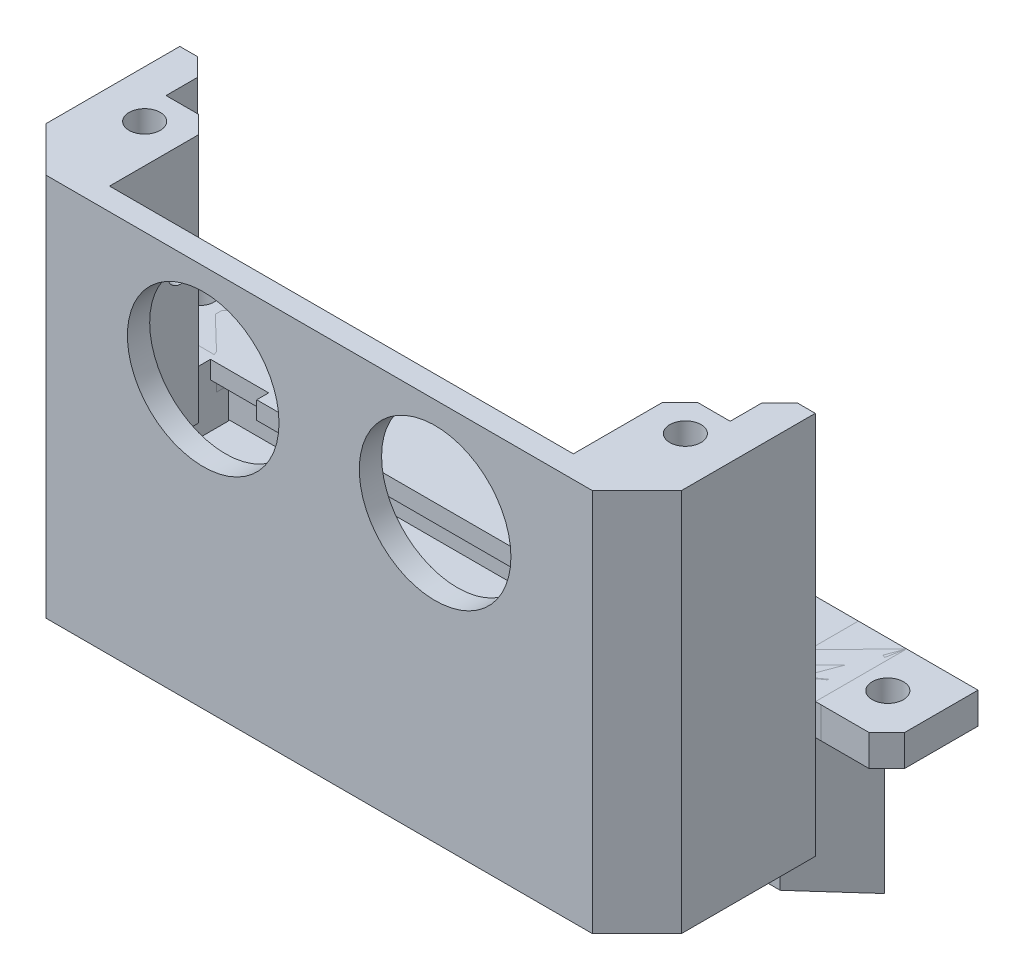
ISO-10303-21;
HEADER;
FILE_DESCRIPTION(('STEP AP214'),'2;1');
FILE_NAME('part.step','',(''),(''),'','','');
FILE_SCHEMA(('AUTOMOTIVE_DESIGN { 1 0 10303 214 1 1 1 1 }'));
ENDSEC;
DATA;
#1=APPLICATION_CONTEXT('core data for automotive mechanical design processes');
#2=APPLICATION_PROTOCOL_DEFINITION('international standard','automotive_design',2000,#1);
#3=PRODUCT_CONTEXT('',#1,'mechanical');
#4=PRODUCT('Part','Part','',(#3));
#5=PRODUCT_RELATED_PRODUCT_CATEGORY('part','',(#4));
#6=PRODUCT_DEFINITION_FORMATION('','',#4);
#7=PRODUCT_DEFINITION_CONTEXT('part definition',#1,'design');
#8=PRODUCT_DEFINITION('design','',#6,#7);
#9=PRODUCT_DEFINITION_SHAPE('','',#8);
#10=(LENGTH_UNIT() NAMED_UNIT(*) SI_UNIT(.MILLI.,.METRE.));
#11=(NAMED_UNIT(*) PLANE_ANGLE_UNIT() SI_UNIT($,.RADIAN.));
#12=(NAMED_UNIT(*) SI_UNIT($,.STERADIAN.) SOLID_ANGLE_UNIT());
#13=UNCERTAINTY_MEASURE_WITH_UNIT(LENGTH_MEASURE(1.E-05),#10,'distance_accuracy_value','');
#14=(GEOMETRIC_REPRESENTATION_CONTEXT(3) GLOBAL_UNCERTAINTY_ASSIGNED_CONTEXT((#13)) GLOBAL_UNIT_ASSIGNED_CONTEXT((#10,
#11,#12)) REPRESENTATION_CONTEXT('',''));
#15=CARTESIAN_POINT('',(0.,0.,0.));
#16=DIRECTION('',(0.,0.,1.));
#17=DIRECTION('',(1.,0.,0.));
#18=AXIS2_PLACEMENT_3D('',#15,#16,#17);
#19=CARTESIAN_POINT('',(71.25,-11.25,-10.0234111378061));
#20=DIRECTION('',(0.,0.,1.));
#21=DIRECTION('',(1.,0.,0.));
#22=AXIS2_PLACEMENT_3D('',#19,#20,#21);
#23=PLANE('',#22);
#24=DIRECTION('',(1.,0.,0.));
#25=VECTOR('',#24,1.);
#26=CARTESIAN_POINT('',(71.25,-7.74999999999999,-10.0234111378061));
#27=LINE('',#26,#25);
#28=CARTESIAN_POINT('',(71.8697379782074,-7.74999999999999,-10.0234111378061));
#29=VERTEX_POINT('',#28);
#30=CARTESIAN_POINT('',(77.25,-7.74999999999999,-10.0234111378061));
#31=VERTEX_POINT('',#30);
#32=EDGE_CURVE('E167',#29,#31,#27,.T.);
#33=ORIENTED_EDGE('',*,*,#32,.F.);
#34=DIRECTION('',(0.,1.,0.));
#35=VECTOR('',#34,1.);
#36=CARTESIAN_POINT('',(71.8697379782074,-11.25,-10.0234111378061));
#37=LINE('',#36,#35);
#38=CARTESIAN_POINT('',(71.8697379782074,-11.25,-10.0234111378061));
#39=VERTEX_POINT('',#38);
#40=EDGE_CURVE('E97',#29,#39,#37,.F.);
#41=ORIENTED_EDGE('',*,*,#40,.T.);
#42=DIRECTION('',(1.,0.,0.));
#43=VECTOR('',#42,1.);
#44=CARTESIAN_POINT('',(71.25,-11.25,-10.0234111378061));
#45=LINE('',#44,#43);
#46=CARTESIAN_POINT('',(77.25,-11.25,-10.0234111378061));
#47=VERTEX_POINT('',#46);
#48=EDGE_CURVE('E145',#39,#47,#45,.T.);
#49=ORIENTED_EDGE('',*,*,#48,.T.);
#50=DIRECTION('',(0.,1.,0.));
#51=VECTOR('',#50,1.);
#52=CARTESIAN_POINT('',(77.25,-11.25,-10.0234111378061));
#53=LINE('',#52,#51);
#54=EDGE_CURVE('E180',#47,#31,#53,.T.);
#55=ORIENTED_EDGE('',*,*,#54,.T.);
#56=EDGE_LOOP('',(#33,#41,#49,#55));
#57=FACE_BOUND('',#56,.T.);
#58=ADVANCED_FACE('F76',(#57),#23,.T.);
#59=CARTESIAN_POINT('',(65.838003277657,-11.25,-10.0010509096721));
#60=DIRECTION('',(0.00413156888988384,0.,0.999991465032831));
#61=DIRECTION('',(0.999991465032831,0.,-0.00413156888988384));
#62=AXIS2_PLACEMENT_3D('',#59,#60,#61);
#63=PLANE('',#62);
#64=DIRECTION('',(0.999991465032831,0.,-0.00413156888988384));
#65=VECTOR('',#64,1.);
#66=CARTESIAN_POINT('',(65.838003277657,-11.25,-10.0010509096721));
#67=LINE('',#66,#65);
#68=CARTESIAN_POINT('',(65.838003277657,-11.25,-10.0010509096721));
#69=VERTEX_POINT('',#68);
#70=CARTESIAN_POINT('',(70.6302673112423,-11.25,-10.0208506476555));
#71=VERTEX_POINT('',#70);
#72=EDGE_CURVE('E154',#69,#71,#67,.T.);
#73=ORIENTED_EDGE('',*,*,#72,.T.);
#74=DIRECTION('',(0.,1.,0.));
#75=VECTOR('',#74,1.);
#76=CARTESIAN_POINT('',(70.6302673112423,-7.74999999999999,-10.0208506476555));
#77=LINE('',#76,#75);
#78=CARTESIAN_POINT('',(70.6302673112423,-7.74999999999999,-10.0208506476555));
#79=VERTEX_POINT('',#78);
#80=EDGE_CURVE('E189',#71,#79,#77,.T.);
#81=ORIENTED_EDGE('',*,*,#80,.T.);
#82=DIRECTION('',(0.999991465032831,0.,-0.00413156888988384));
#83=VECTOR('',#82,1.);
#84=CARTESIAN_POINT('',(65.838003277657,-7.74999999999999,-10.0010509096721));
#85=LINE('',#84,#83);
#86=CARTESIAN_POINT('',(65.838003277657,-7.74999999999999,-10.0010509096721));
#87=VERTEX_POINT('',#86);
#88=EDGE_CURVE('E176',#87,#79,#85,.T.);
#89=ORIENTED_EDGE('',*,*,#88,.F.);
#90=DIRECTION('',(0.,1.,0.));
#91=VECTOR('',#90,1.);
#92=CARTESIAN_POINT('',(65.838003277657,-11.25,-10.0010509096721));
#93=LINE('',#92,#91);
#94=EDGE_CURVE('E178',#69,#87,#93,.T.);
#95=ORIENTED_EDGE('',*,*,#94,.F.);
#96=EDGE_LOOP('',(#73,#81,#89,#95));
#97=FACE_BOUND('',#96,.T.);
#98=ADVANCED_FACE('F195',(#97),#63,.T.);
#99=CARTESIAN_POINT('',(65.838003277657,-11.25,-20.2433351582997));
#100=DIRECTION('',(-1.,0.,0.));
#101=DIRECTION('',(0.,0.,1.));
#102=AXIS2_PLACEMENT_3D('',#99,#100,#101);
#103=PLANE('',#102);
#104=DIRECTION('',(0.,0.,1.));
#105=VECTOR('',#104,1.);
#106=CARTESIAN_POINT('',(65.838003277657,-7.74999999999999,-20.2433351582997));
#107=LINE('',#106,#105);
#108=CARTESIAN_POINT('',(65.838003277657,-7.74999999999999,-20.2433351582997));
#109=VERTEX_POINT('',#108);
#110=EDGE_CURVE('E173',#109,#87,#107,.T.);
#111=ORIENTED_EDGE('',*,*,#110,.F.);
#112=DIRECTION('',(0.,1.,0.));
#113=VECTOR('',#112,1.);
#114=CARTESIAN_POINT('',(65.838003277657,-11.25,-20.2433351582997));
#115=LINE('',#114,#113);
#116=CARTESIAN_POINT('',(65.838003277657,-11.25,-20.2433351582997));
#117=VERTEX_POINT('',#116);
#118=EDGE_CURVE('E153',#117,#109,#115,.T.);
#119=ORIENTED_EDGE('',*,*,#118,.F.);
#120=DIRECTION('',(0.,0.,1.));
#121=VECTOR('',#120,1.);
#122=CARTESIAN_POINT('',(65.838003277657,-11.25,-20.2433351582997));
#123=LINE('',#122,#121);
#124=EDGE_CURVE('E160',#117,#69,#123,.T.);
#125=ORIENTED_EDGE('',*,*,#124,.T.);
#126=ORIENTED_EDGE('',*,*,#94,.T.);
#127=EDGE_LOOP('',(#111,#119,#125,#126));
#128=FACE_BOUND('',#127,.T.);
#129=ADVANCED_FACE('F201',(#128),#103,.T.);
#130=CARTESIAN_POINT('',(71.25,-11.25,-20.2433351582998));
#131=DIRECTION('',(0.,0.,-1.));
#132=DIRECTION('',(-1.,0.,0.));
#133=AXIS2_PLACEMENT_3D('',#130,#131,#132);
#134=PLANE('',#133);
#135=DIRECTION('',(-1.,0.,0.));
#136=VECTOR('',#135,1.);
#137=CARTESIAN_POINT('',(71.25,-7.74999999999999,-20.2433351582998));
#138=LINE('',#137,#136);
#139=CARTESIAN_POINT('',(79.25,-7.74999999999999,-20.2433351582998));
#140=VERTEX_POINT('',#139);
#141=EDGE_CURVE('E152',#140,#109,#138,.T.);
#142=ORIENTED_EDGE('',*,*,#141,.F.);
#143=DIRECTION('',(0.,1.,0.));
#144=VECTOR('',#143,1.);
#145=CARTESIAN_POINT('',(79.25,-11.25,-20.2433351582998));
#146=LINE('',#145,#144);
#147=CARTESIAN_POINT('',(79.25,-11.25,-20.2433351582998));
#148=VERTEX_POINT('',#147);
#149=EDGE_CURVE('E137',#148,#140,#146,.T.);
#150=ORIENTED_EDGE('',*,*,#149,.F.);
#151=DIRECTION('',(-1.,0.,0.));
#152=VECTOR('',#151,1.);
#153=CARTESIAN_POINT('',(71.25,-11.25,-20.2433351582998));
#154=LINE('',#153,#152);
#155=EDGE_CURVE('E144',#148,#117,#154,.T.);
#156=ORIENTED_EDGE('',*,*,#155,.T.);
#157=ORIENTED_EDGE('',*,*,#118,.T.);
#158=EDGE_LOOP('',(#142,#150,#156,#157));
#159=FACE_BOUND('',#158,.T.);
#160=ADVANCED_FACE('F149',(#159),#134,.T.);
#161=CARTESIAN_POINT('',(79.25,-11.25,-10.0234111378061));
#162=DIRECTION('',(1.,0.,0.));
#163=DIRECTION('',(0.,0.,-1.));
#164=AXIS2_PLACEMENT_3D('',#161,#162,#163);
#165=PLANE('',#164);
#166=DIRECTION('',(0.,0.,-1.));
#167=VECTOR('',#166,1.);
#168=CARTESIAN_POINT('',(79.25,-7.74999999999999,-10.0234111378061));
#169=LINE('',#168,#167);
#170=CARTESIAN_POINT('',(79.25,-7.74999999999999,-12.0234111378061));
#171=VERTEX_POINT('',#170);
#172=EDGE_CURVE('E169',#171,#140,#169,.T.);
#173=ORIENTED_EDGE('',*,*,#172,.F.);
#174=DIRECTION('',(0.,-1.,0.));
#175=VECTOR('',#174,1.);
#176=CARTESIAN_POINT('',(79.25,-11.25,-12.0234111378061));
#177=LINE('',#176,#175);
#178=CARTESIAN_POINT('',(79.25,-11.25,-12.0234111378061));
#179=VERTEX_POINT('',#178);
#180=EDGE_CURVE('E139',#171,#179,#177,.T.);
#181=ORIENTED_EDGE('',*,*,#180,.T.);
#182=DIRECTION('',(0.,0.,-1.));
#183=VECTOR('',#182,1.);
#184=CARTESIAN_POINT('',(79.25,-11.25,-10.0234111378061));
#185=LINE('',#184,#183);
#186=EDGE_CURVE('E133',#179,#148,#185,.T.);
#187=ORIENTED_EDGE('',*,*,#186,.T.);
#188=ORIENTED_EDGE('',*,*,#149,.T.);
#189=EDGE_LOOP('',(#173,#181,#187,#188));
#190=FACE_BOUND('',#189,.T.);
#191=ADVANCED_FACE('F136',(#190),#165,.T.);
#192=CARTESIAN_POINT('',(0.,-11.25,0.));
#193=DIRECTION('',(0.,1.,0.));
#194=DIRECTION('',(0.,0.,1.));
#195=AXIS2_PLACEMENT_3D('',#192,#193,#194);
#196=PLANE('',#195);
#197=CARTESIAN_POINT('',(74.25,-11.25,-15.1333731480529));
#198=DIRECTION('',(0.,1.,0.));
#199=DIRECTION('',(0.,0.,1.));
#200=AXIS2_PLACEMENT_3D('',#197,#198,#199);
#201=CIRCLE('',#200,1.74999999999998);
#202=CARTESIAN_POINT('',(74.25,-11.25,-13.3833731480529));
#203=VERTEX_POINT('',#202);
#204=EDGE_CURVE('E170',#203,#203,#201,.T.);
#205=ORIENTED_EDGE('',*,*,#204,.T.);
#206=EDGE_LOOP('',(#205));
#207=FACE_BOUND('',#206,.T.);
#208=ORIENTED_EDGE('',*,*,#186,.F.);
#209=DIRECTION('',(0.707106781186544,0.,-0.707106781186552));
#210=VECTOR('',#209,1.);
#211=CARTESIAN_POINT('',(77.25,-11.25,-10.0234111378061));
#212=LINE('',#211,#210);
#213=EDGE_CURVE('E187',#179,#47,#212,.F.);
#214=ORIENTED_EDGE('',*,*,#213,.T.);
#215=ORIENTED_EDGE('',*,*,#48,.F.);
#216=CARTESIAN_POINT('',(71.8697379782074,-11.2500000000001,289.976588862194));
#217=DIRECTION('',(0.,1.,0.));
#218=DIRECTION('',(0.,0.,1.));
#219=AXIS2_PLACEMENT_3D('',#216,#217,#218);
#220=CIRCLE('',#219,300.);
#221=EDGE_CURVE('E13',#39,#71,#220,.T.);
#222=ORIENTED_EDGE('',*,*,#221,.T.);
#223=ORIENTED_EDGE('',*,*,#72,.F.);
#224=ORIENTED_EDGE('',*,*,#124,.F.);
#225=ORIENTED_EDGE('',*,*,#155,.F.);
#226=EDGE_LOOP('',(#208,#214,#215,#222,#223,#224,#225));
#227=FACE_BOUND('',#226,.T.);
#228=ADVANCED_FACE('F157',(#207,#227),#196,.F.);
#229=CARTESIAN_POINT('',(0.,-7.75,0.));
#230=DIRECTION('',(0.,1.,0.));
#231=DIRECTION('',(0.,0.,1.));
#232=AXIS2_PLACEMENT_3D('',#229,#230,#231);
#233=PLANE('',#232);
#234=CARTESIAN_POINT('',(74.25,-7.74999999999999,-15.1333731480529));
#235=DIRECTION('',(0.,1.,0.));
#236=DIRECTION('',(0.,0.,-1.));
#237=AXIS2_PLACEMENT_3D('',#234,#235,#236);
#238=CIRCLE('',#237,1.74999999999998);
#239=CARTESIAN_POINT('',(74.25,-7.74999999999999,-16.8833731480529));
#240=VERTEX_POINT('',#239);
#241=EDGE_CURVE('E235',#240,#240,#238,.T.);
#242=ORIENTED_EDGE('',*,*,#241,.F.);
#243=EDGE_LOOP('',(#242));
#244=FACE_BOUND('',#243,.T.);
#245=ORIENTED_EDGE('',*,*,#88,.T.);
#246=CARTESIAN_POINT('',(71.8697379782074,-7.75000000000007,289.976588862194));
#247=DIRECTION('',(0.,1.,0.));
#248=DIRECTION('',(0.,0.,1.));
#249=AXIS2_PLACEMENT_3D('',#246,#247,#248);
#250=CIRCLE('',#249,300.);
#251=EDGE_CURVE('E84',#79,#29,#250,.F.);
#252=ORIENTED_EDGE('',*,*,#251,.T.);
#253=ORIENTED_EDGE('',*,*,#32,.T.);
#254=DIRECTION('',(-0.707106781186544,0.,0.707106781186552));
#255=VECTOR('',#254,1.);
#256=CARTESIAN_POINT('',(33.6132944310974,-7.75000000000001,33.613294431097));
#257=LINE('',#256,#255);
#258=EDGE_CURVE('E184',#31,#171,#257,.F.);
#259=ORIENTED_EDGE('',*,*,#258,.T.);
#260=ORIENTED_EDGE('',*,*,#172,.T.);
#261=ORIENTED_EDGE('',*,*,#141,.T.);
#262=ORIENTED_EDGE('',*,*,#110,.T.);
#263=EDGE_LOOP('',(#245,#252,#253,#259,#260,#261,#262));
#264=FACE_BOUND('',#263,.T.);
#265=ADVANCED_FACE('F198',(#244,#264),#233,.T.);
#266=CARTESIAN_POINT('',(74.25,-32.7501073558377,-15.1333731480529));
#267=DIRECTION('',(0.,1.,0.));
#268=DIRECTION('',(0.,0.,1.));
#269=AXIS2_PLACEMENT_3D('',#266,#267,#268);
#270=CYLINDRICAL_SURFACE('',#269,1.74999999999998);
#271=ORIENTED_EDGE('',*,*,#241,.T.);
#272=EDGE_LOOP('',(#271));
#273=FACE_BOUND('',#272,.T.);
#274=ORIENTED_EDGE('',*,*,#204,.F.);
#275=EDGE_LOOP('',(#274));
#276=FACE_BOUND('',#275,.T.);
#277=ADVANCED_FACE('F207',(#273,#276),#270,.F.);
#278=CARTESIAN_POINT('',(77.25,-11.25,-10.0234111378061));
#279=DIRECTION('',(-0.707106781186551,0.,-0.707106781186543));
#280=DIRECTION('',(0.,1.,0.));
#281=AXIS2_PLACEMENT_3D('',#278,#279,#280);
#282=PLANE('',#281);
#283=ORIENTED_EDGE('',*,*,#213,.F.);
#284=ORIENTED_EDGE('',*,*,#180,.F.);
#285=ORIENTED_EDGE('',*,*,#258,.F.);
#286=ORIENTED_EDGE('',*,*,#54,.F.);
#287=EDGE_LOOP('',(#283,#284,#285,#286));
#288=FACE_BOUND('',#287,.T.);
#289=ADVANCED_FACE('F203',(#288),#282,.F.);
#290=CARTESIAN_POINT('',(71.8697379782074,-11.2500000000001,289.976588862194));
#291=DIRECTION('',(0.,-1.,0.));
#292=DIRECTION('',(0.,0.,-1.));
#293=AXIS2_PLACEMENT_3D('',#290,#291,#292);
#294=CYLINDRICAL_SURFACE('',#293,300.);
#295=ORIENTED_EDGE('',*,*,#221,.F.);
#296=ORIENTED_EDGE('',*,*,#40,.F.);
#297=ORIENTED_EDGE('',*,*,#251,.F.);
#298=ORIENTED_EDGE('',*,*,#80,.F.);
#299=EDGE_LOOP('',(#295,#296,#297,#298));
#300=FACE_BOUND('',#299,.T.);
#301=ADVANCED_FACE('F78',(#300),#294,.F.);
#302=CLOSED_SHELL('',(#58,#98,#129,#160,#191,#228,#265,#277,#289,#301));
#303=MANIFOLD_SOLID_BREP('B2',#302);
#304=CARTESIAN_POINT('',(4.13255505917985,-11.25,-20.2433351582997));
#305=DIRECTION('',(1.,0.,0.));
#306=DIRECTION('',(0.,0.,-1.));
#307=AXIS2_PLACEMENT_3D('',#304,#305,#306);
#308=PLANE('',#307);
#309=DIRECTION('',(0.,0.,-1.));
#310=VECTOR('',#309,1.);
#311=CARTESIAN_POINT('',(4.13255505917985,-7.74999999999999,-20.2433351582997));
#312=LINE('',#311,#310);
#313=CARTESIAN_POINT('',(4.13255505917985,-7.74999999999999,-10.0010509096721));
#314=VERTEX_POINT('',#313);
#315=CARTESIAN_POINT('',(4.13255505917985,-7.74999999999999,-20.2433351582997));
#316=VERTEX_POINT('',#315);
#317=EDGE_CURVE('E377',#314,#316,#312,.T.);
#318=ORIENTED_EDGE('',*,*,#317,.F.);
#319=DIRECTION('',(0.,1.,0.));
#320=VECTOR('',#319,1.);
#321=CARTESIAN_POINT('',(4.13255505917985,-11.25,-10.0010509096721));
#322=LINE('',#321,#320);
#323=CARTESIAN_POINT('',(4.13255505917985,-11.25,-10.0010509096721));
#324=VERTEX_POINT('',#323);
#325=EDGE_CURVE('E387',#324,#314,#322,.T.);
#326=ORIENTED_EDGE('',*,*,#325,.F.);
#327=DIRECTION('',(0.,0.,-1.));
#328=VECTOR('',#327,1.);
#329=CARTESIAN_POINT('',(4.13255505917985,-11.25,-20.2433351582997));
#330=LINE('',#329,#328);
#331=CARTESIAN_POINT('',(4.13255505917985,-11.25,-20.2433351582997));
#332=VERTEX_POINT('',#331);
#333=EDGE_CURVE('E388',#324,#332,#330,.T.);
#334=ORIENTED_EDGE('',*,*,#333,.T.);
#335=DIRECTION('',(0.,1.,0.));
#336=VECTOR('',#335,1.);
#337=CARTESIAN_POINT('',(4.13255505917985,-11.25,-20.2433351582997));
#338=LINE('',#337,#336);
#339=EDGE_CURVE('E371',#332,#316,#338,.T.);
#340=ORIENTED_EDGE('',*,*,#339,.T.);
#341=EDGE_LOOP('',(#318,#326,#334,#340));
#342=FACE_BOUND('',#341,.T.);
#343=ADVANCED_FACE('F309',(#342),#308,.T.);
#344=CARTESIAN_POINT('',(4.13255505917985,-11.25,-10.0010509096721));
#345=DIRECTION('',(-0.00541067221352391,0.,0.999985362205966));
#346=DIRECTION('',(0.999985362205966,0.,0.00541067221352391));
#347=AXIS2_PLACEMENT_3D('',#344,#345,#346);
#348=PLANE('',#347);
#349=DIRECTION('',(0.999985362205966,0.,0.00541067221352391));
#350=VECTOR('',#349,1.);
#351=CARTESIAN_POINT('',(4.13255505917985,-7.74999999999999,-10.0010509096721));
#352=LINE('',#351,#350);
#353=CARTESIAN_POINT('',(0.811594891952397,-7.74999999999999,-10.019019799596));
#354=VERTEX_POINT('',#353);
#355=EDGE_CURVE('E409',#354,#314,#352,.T.);
#356=ORIENTED_EDGE('',*,*,#355,.F.);
#357=DIRECTION('',(0.,1.,0.));
#358=VECTOR('',#357,1.);
#359=CARTESIAN_POINT('',(0.811594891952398,-11.25,-10.019019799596));
#360=LINE('',#359,#358);
#361=CARTESIAN_POINT('',(0.811594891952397,-11.25,-10.019019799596));
#362=VERTEX_POINT('',#361);
#363=EDGE_CURVE('E324',#354,#362,#360,.F.);
#364=ORIENTED_EDGE('',*,*,#363,.T.);
#365=DIRECTION('',(0.999985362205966,0.,0.00541067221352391));
#366=VECTOR('',#365,1.);
#367=CARTESIAN_POINT('',(4.13255505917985,-11.25,-10.0010509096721));
#368=LINE('',#367,#366);
#369=EDGE_CURVE('E397',#362,#324,#368,.T.);
#370=ORIENTED_EDGE('',*,*,#369,.T.);
#371=ORIENTED_EDGE('',*,*,#325,.T.);
#372=EDGE_LOOP('',(#356,#364,#370,#371));
#373=FACE_BOUND('',#372,.T.);
#374=ADVANCED_FACE('F442',(#373),#348,.T.);
#375=CARTESIAN_POINT('',(0.,-11.25,-10.0234111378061));
#376=DIRECTION('',(0.,0.,1.));
#377=DIRECTION('',(1.,0.,0.));
#378=AXIS2_PLACEMENT_3D('',#375,#376,#377);
#379=PLANE('',#378);
#380=DIRECTION('',(1.,0.,0.));
#381=VECTOR('',#380,1.);
#382=CARTESIAN_POINT('',(0.,-11.25,-10.0234111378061));
#383=LINE('',#382,#381);
#384=CARTESIAN_POINT('',(-5.99999999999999,-11.25,-10.0234111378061));
#385=VERTEX_POINT('',#384);
#386=CARTESIAN_POINT('',(-0.811606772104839,-11.25,-10.0234111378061));
#387=VERTEX_POINT('',#386);
#388=EDGE_CURVE('E394',#385,#387,#383,.T.);
#389=ORIENTED_EDGE('',*,*,#388,.T.);
#390=DIRECTION('',(0.,1.,0.));
#391=VECTOR('',#390,1.);
#392=CARTESIAN_POINT('',(-0.811606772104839,-7.74999999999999,-10.0234111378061));
#393=LINE('',#392,#391);
#394=CARTESIAN_POINT('',(-0.811606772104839,-7.74999999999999,-10.0234111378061));
#395=VERTEX_POINT('',#394);
#396=EDGE_CURVE('E423',#387,#395,#393,.T.);
#397=ORIENTED_EDGE('',*,*,#396,.T.);
#398=DIRECTION('',(1.,0.,0.));
#399=VECTOR('',#398,1.);
#400=CARTESIAN_POINT('',(0.,-7.74999999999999,-10.0234111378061));
#401=LINE('',#400,#399);
#402=CARTESIAN_POINT('',(-5.99999999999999,-7.74999999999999,-10.0234111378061));
#403=VERTEX_POINT('',#402);
#404=EDGE_CURVE('E407',#403,#395,#401,.T.);
#405=ORIENTED_EDGE('',*,*,#404,.F.);
#406=DIRECTION('',(0.,-1.,0.));
#407=VECTOR('',#406,1.);
#408=CARTESIAN_POINT('',(-5.99999999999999,-11.25,-10.0234111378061));
#409=LINE('',#408,#407);
#410=EDGE_CURVE('E420',#403,#385,#409,.T.);
#411=ORIENTED_EDGE('',*,*,#410,.T.);
#412=EDGE_LOOP('',(#389,#397,#405,#411));
#413=FACE_BOUND('',#412,.T.);
#414=ADVANCED_FACE('F429',(#413),#379,.T.);
#415=CARTESIAN_POINT('',(-8.,-11.25,-10.0234111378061));
#416=DIRECTION('',(-1.,0.,0.));
#417=DIRECTION('',(0.,0.,1.));
#418=AXIS2_PLACEMENT_3D('',#415,#416,#417);
#419=PLANE('',#418);
#420=DIRECTION('',(0.,0.,1.));
#421=VECTOR('',#420,1.);
#422=CARTESIAN_POINT('',(-8.,-11.25,-10.0234111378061));
#423=LINE('',#422,#421);
#424=CARTESIAN_POINT('',(-8.,-11.25,-20.2433351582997));
#425=VERTEX_POINT('',#424);
#426=CARTESIAN_POINT('',(-8.,-11.25,-12.0234111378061));
#427=VERTEX_POINT('',#426);
#428=EDGE_CURVE('E376',#425,#427,#423,.T.);
#429=ORIENTED_EDGE('',*,*,#428,.T.);
#430=DIRECTION('',(0.,1.,0.));
#431=VECTOR('',#430,1.);
#432=CARTESIAN_POINT('',(-8.,-11.25,-12.0234111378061));
#433=LINE('',#432,#431);
#434=CARTESIAN_POINT('',(-8.,-7.74999999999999,-12.0234111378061));
#435=VERTEX_POINT('',#434);
#436=EDGE_CURVE('E414',#427,#435,#433,.T.);
#437=ORIENTED_EDGE('',*,*,#436,.T.);
#438=DIRECTION('',(0.,0.,1.));
#439=VECTOR('',#438,1.);
#440=CARTESIAN_POINT('',(-8.,-7.74999999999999,-10.0234111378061));
#441=LINE('',#440,#439);
#442=CARTESIAN_POINT('',(-8.,-7.74999999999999,-20.2433351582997));
#443=VERTEX_POINT('',#442);
#444=EDGE_CURVE('E385',#443,#435,#441,.T.);
#445=ORIENTED_EDGE('',*,*,#444,.F.);
#446=DIRECTION('',(0.,1.,0.));
#447=VECTOR('',#446,1.);
#448=CARTESIAN_POINT('',(-8.,-11.25,-20.2433351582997));
#449=LINE('',#448,#447);
#450=EDGE_CURVE('E368',#425,#443,#449,.T.);
#451=ORIENTED_EDGE('',*,*,#450,.F.);
#452=EDGE_LOOP('',(#429,#437,#445,#451));
#453=FACE_BOUND('',#452,.T.);
#454=ADVANCED_FACE('F381',(#453),#419,.T.);
#455=CARTESIAN_POINT('',(0.,-11.25,-20.2433351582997));
#456=DIRECTION('',(0.,0.,-1.));
#457=DIRECTION('',(0.,1.,0.));
#458=AXIS2_PLACEMENT_3D('',#455,#456,#457);
#459=PLANE('',#458);
#460=DIRECTION('',(-1.,0.,0.));
#461=VECTOR('',#460,1.);
#462=CARTESIAN_POINT('',(0.,-7.74999999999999,-20.2433351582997));
#463=LINE('',#462,#461);
#464=EDGE_CURVE('E403',#316,#443,#463,.T.);
#465=ORIENTED_EDGE('',*,*,#464,.F.);
#466=ORIENTED_EDGE('',*,*,#339,.F.);
#467=DIRECTION('',(-1.,0.,0.));
#468=VECTOR('',#467,1.);
#469=CARTESIAN_POINT('',(0.,-11.25,-20.2433351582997));
#470=LINE('',#469,#468);
#471=EDGE_CURVE('E365',#332,#425,#470,.T.);
#472=ORIENTED_EDGE('',*,*,#471,.T.);
#473=ORIENTED_EDGE('',*,*,#450,.T.);
#474=EDGE_LOOP('',(#465,#466,#472,#473));
#475=FACE_BOUND('',#474,.T.);
#476=ADVANCED_FACE('F367',(#475),#459,.T.);
#477=CARTESIAN_POINT('',(0.,-11.25,0.));
#478=DIRECTION('',(0.,-1.,0.));
#479=DIRECTION('',(0.,0.,-1.));
#480=AXIS2_PLACEMENT_3D('',#477,#478,#479);
#481=PLANE('',#480);
#482=CARTESIAN_POINT('',(-3.,-11.25,-15.1333731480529));
#483=DIRECTION('',(0.,-1.,0.));
#484=DIRECTION('',(0.,0.,-1.));
#485=AXIS2_PLACEMENT_3D('',#482,#483,#484);
#486=CIRCLE('',#485,1.75);
#487=CARTESIAN_POINT('',(-3.,-11.25,-16.8833731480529));
#488=VERTEX_POINT('',#487);
#489=EDGE_CURVE('E405',#488,#488,#486,.T.);
#490=ORIENTED_EDGE('',*,*,#489,.F.);
#491=EDGE_LOOP('',(#490));
#492=FACE_BOUND('',#491,.T.);
#493=ORIENTED_EDGE('',*,*,#388,.F.);
#494=DIRECTION('',(0.707106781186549,0.,0.707106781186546));
#495=VECTOR('',#494,1.);
#496=CARTESIAN_POINT('',(2.01170556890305,-11.25,-2.01170556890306));
#497=LINE('',#496,#495);
#498=EDGE_CURVE('E393',#385,#427,#497,.F.);
#499=ORIENTED_EDGE('',*,*,#498,.T.);
#500=ORIENTED_EDGE('',*,*,#428,.F.);
#501=ORIENTED_EDGE('',*,*,#471,.F.);
#502=ORIENTED_EDGE('',*,*,#333,.F.);
#503=ORIENTED_EDGE('',*,*,#369,.F.);
#504=CARTESIAN_POINT('',(-0.811606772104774,-11.2500000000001,289.976588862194));
#505=DIRECTION('',(0.,-1.,0.));
#506=DIRECTION('',(0.,0.,-1.));
#507=AXIS2_PLACEMENT_3D('',#504,#505,#506);
#508=CIRCLE('',#507,300.);
#509=EDGE_CURVE('E74',#362,#387,#508,.F.);
#510=ORIENTED_EDGE('',*,*,#509,.T.);
#511=EDGE_LOOP('',(#493,#499,#500,#501,#502,#503,#510));
#512=FACE_BOUND('',#511,.T.);
#513=ADVANCED_FACE('F391',(#492,#512),#481,.T.);
#514=CARTESIAN_POINT('',(0.,-7.75,0.));
#515=DIRECTION('',(0.,-1.,0.));
#516=DIRECTION('',(0.,0.,-1.));
#517=AXIS2_PLACEMENT_3D('',#514,#515,#516);
#518=PLANE('',#517);
#519=CARTESIAN_POINT('',(-3.,-7.74999999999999,-15.1333731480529));
#520=DIRECTION('',(0.,1.,0.));
#521=DIRECTION('',(0.,0.,1.));
#522=AXIS2_PLACEMENT_3D('',#519,#520,#521);
#523=CIRCLE('',#522,1.75);
#524=CARTESIAN_POINT('',(-3.,-7.74999999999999,-13.3833731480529));
#525=VERTEX_POINT('',#524);
#526=EDGE_CURVE('E476',#525,#525,#523,.T.);
#527=ORIENTED_EDGE('',*,*,#526,.F.);
#528=EDGE_LOOP('',(#527));
#529=FACE_BOUND('',#528,.T.);
#530=ORIENTED_EDGE('',*,*,#444,.T.);
#531=DIRECTION('',(-0.707106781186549,0.,-0.707106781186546));
#532=VECTOR('',#531,1.);
#533=CARTESIAN_POINT('',(-8.,-7.74999999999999,-12.0234111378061));
#534=LINE('',#533,#532);
#535=EDGE_CURVE('E418',#435,#403,#534,.F.);
#536=ORIENTED_EDGE('',*,*,#535,.T.);
#537=ORIENTED_EDGE('',*,*,#404,.T.);
#538=CARTESIAN_POINT('',(-0.811606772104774,-7.75000000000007,289.976588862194));
#539=DIRECTION('',(0.,-1.,0.));
#540=DIRECTION('',(0.,0.,-1.));
#541=AXIS2_PLACEMENT_3D('',#538,#539,#540);
#542=CIRCLE('',#541,300.);
#543=EDGE_CURVE('E317',#395,#354,#542,.T.);
#544=ORIENTED_EDGE('',*,*,#543,.T.);
#545=ORIENTED_EDGE('',*,*,#355,.T.);
#546=ORIENTED_EDGE('',*,*,#317,.T.);
#547=ORIENTED_EDGE('',*,*,#464,.T.);
#548=EDGE_LOOP('',(#530,#536,#537,#544,#545,#546,#547));
#549=FACE_BOUND('',#548,.T.);
#550=ADVANCED_FACE('F433',(#529,#549),#518,.F.);
#551=CARTESIAN_POINT('',(-3.,-32.7501073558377,-15.1333731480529));
#552=DIRECTION('',(0.,1.,0.));
#553=DIRECTION('',(0.,0.,1.));
#554=AXIS2_PLACEMENT_3D('',#551,#552,#553);
#555=CYLINDRICAL_SURFACE('',#554,1.75);
#556=ORIENTED_EDGE('',*,*,#489,.T.);
#557=EDGE_LOOP('',(#556));
#558=FACE_BOUND('',#557,.T.);
#559=ORIENTED_EDGE('',*,*,#526,.T.);
#560=EDGE_LOOP('',(#559));
#561=FACE_BOUND('',#560,.T.);
#562=ADVANCED_FACE('F440',(#558,#561),#555,.F.);
#563=CARTESIAN_POINT('',(-8.,-11.25,-12.0234111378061));
#564=DIRECTION('',(0.707106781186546,0.,-0.707106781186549));
#565=DIRECTION('',(0.,1.,0.));
#566=AXIS2_PLACEMENT_3D('',#563,#564,#565);
#567=PLANE('',#566);
#568=ORIENTED_EDGE('',*,*,#498,.F.);
#569=ORIENTED_EDGE('',*,*,#410,.F.);
#570=ORIENTED_EDGE('',*,*,#535,.F.);
#571=ORIENTED_EDGE('',*,*,#436,.F.);
#572=EDGE_LOOP('',(#568,#569,#570,#571));
#573=FACE_BOUND('',#572,.T.);
#574=ADVANCED_FACE('F435',(#573),#567,.F.);
#575=CARTESIAN_POINT('',(-0.811606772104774,-11.2500000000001,289.976588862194));
#576=DIRECTION('',(0.,-1.,0.));
#577=DIRECTION('',(0.,0.,-1.));
#578=AXIS2_PLACEMENT_3D('',#575,#576,#577);
#579=CYLINDRICAL_SURFACE('',#578,300.);
#580=ORIENTED_EDGE('',*,*,#509,.F.);
#581=ORIENTED_EDGE('',*,*,#363,.F.);
#582=ORIENTED_EDGE('',*,*,#543,.F.);
#583=ORIENTED_EDGE('',*,*,#396,.F.);
#584=EDGE_LOOP('',(#580,#581,#582,#583));
#585=FACE_BOUND('',#584,.T.);
#586=ADVANCED_FACE('F311',(#585),#579,.F.);
#587=CLOSED_SHELL('',(#343,#374,#414,#454,#476,#513,#550,#562,#574,#586));
#588=MANIFOLD_SOLID_BREP('B7',#587);
#589=CARTESIAN_POINT('',(57.2457142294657,-26.1876727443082,-15.289468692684));
#590=DIRECTION('',(0.,-0.884919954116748,0.465743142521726));
#591=DIRECTION('',(0.,-0.465743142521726,-0.884919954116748));
#592=AXIS2_PLACEMENT_3D('',#589,#590,#591);
#593=CYLINDRICAL_SURFACE('',#592,3.);
#594=CARTESIAN_POINT('',(57.2457142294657,-26.1876727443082,-15.289468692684));
#595=DIRECTION('',(0.,-0.884919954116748,0.465743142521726));
#596=DIRECTION('',(0.,-0.465743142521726,-0.884919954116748));
#597=AXIS2_PLACEMENT_3D('',#594,#595,#596);
#598=CIRCLE('',#597,3.);
#599=CARTESIAN_POINT('',(57.2457142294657,-27.5849021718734,-17.9442285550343));
#600=VERTEX_POINT('',#599);
#601=EDGE_CURVE('E308',#600,#600,#598,.T.);
#602=ORIENTED_EDGE('',*,*,#601,.T.);
#603=EDGE_LOOP('',(#602));
#604=FACE_BOUND('',#603,.T.);
#605=CARTESIAN_POINT('',(57.2457142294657,-29.2848925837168,-13.659367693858));
#606=DIRECTION('',(0.,-0.884919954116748,0.465743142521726));
#607=DIRECTION('',(0.,-0.465743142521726,-0.884919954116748));
#608=AXIS2_PLACEMENT_3D('',#605,#606,#607);
#609=CIRCLE('',#608,3.);
#610=CARTESIAN_POINT('',(57.2457142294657,-30.682122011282,-16.3141275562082));
#611=VERTEX_POINT('',#610);
#612=EDGE_CURVE('E545',#611,#611,#609,.T.);
#613=ORIENTED_EDGE('',*,*,#612,.F.);
#614=EDGE_LOOP('',(#613));
#615=FACE_BOUND('',#614,.T.);
#616=ADVANCED_FACE('F542',(#604,#615),#593,.T.);
#617=CARTESIAN_POINT('',(57.2457142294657,-26.1876727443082,-15.289468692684));
#618=DIRECTION('',(0.,-0.884919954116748,0.465743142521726));
#619=DIRECTION('',(0.,-0.465743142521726,-0.884919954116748));
#620=AXIS2_PLACEMENT_3D('',#617,#618,#619);
#621=PLANE('',#620);
#622=CARTESIAN_POINT('',(57.2457142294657,-26.1876727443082,-15.289468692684));
#623=DIRECTION('',(0.,-0.884919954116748,0.465743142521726));
#624=DIRECTION('',(0.,-0.465743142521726,-0.884919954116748));
#625=AXIS2_PLACEMENT_3D('',#622,#623,#624);
#626=CIRCLE('',#625,2.5);
#627=CARTESIAN_POINT('',(57.2457142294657,-27.3520306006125,-17.5017685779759));
#628=VERTEX_POINT('',#627);
#629=EDGE_CURVE('E552',#628,#628,#626,.T.);
#630=ORIENTED_EDGE('',*,*,#629,.T.);
#631=EDGE_LOOP('',(#630));
#632=FACE_BOUND('',#631,.T.);
#633=ORIENTED_EDGE('',*,*,#601,.F.);
#634=EDGE_LOOP('',(#633));
#635=FACE_BOUND('',#634,.T.);
#636=ADVANCED_FACE('F560',(#632,#635),#621,.F.);
#637=CARTESIAN_POINT('',(57.2457142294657,-29.2848925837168,-13.659367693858));
#638=DIRECTION('',(0.,-0.884919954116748,0.465743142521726));
#639=DIRECTION('',(0.,-0.465743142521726,-0.884919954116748));
#640=AXIS2_PLACEMENT_3D('',#637,#638,#639);
#641=PLANE('',#640);
#642=CARTESIAN_POINT('',(57.2457142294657,-29.2848925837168,-13.659367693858));
#643=DIRECTION('',(0.,-0.884919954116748,0.465743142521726));
#644=DIRECTION('',(0.,-0.465743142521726,-0.884919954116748));
#645=AXIS2_PLACEMENT_3D('',#642,#643,#644);
#646=CIRCLE('',#645,2.5);
#647=CARTESIAN_POINT('',(57.2457142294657,-30.4492504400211,-15.8716675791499));
#648=VERTEX_POINT('',#647);
#649=EDGE_CURVE('E554',#648,#648,#646,.T.);
#650=ORIENTED_EDGE('',*,*,#649,.F.);
#651=EDGE_LOOP('',(#650));
#652=FACE_BOUND('',#651,.T.);
#653=ORIENTED_EDGE('',*,*,#612,.T.);
#654=EDGE_LOOP('',(#653));
#655=FACE_BOUND('',#654,.T.);
#656=ADVANCED_FACE('F566',(#652,#655),#641,.T.);
#657=CARTESIAN_POINT('',(57.2457142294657,-26.1876727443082,-15.289468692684));
#658=DIRECTION('',(0.,-0.884919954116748,0.465743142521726));
#659=DIRECTION('',(0.,-0.465743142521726,-0.884919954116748));
#660=AXIS2_PLACEMENT_3D('',#657,#658,#659);
#661=CYLINDRICAL_SURFACE('',#660,2.5);
#662=ORIENTED_EDGE('',*,*,#629,.F.);
#663=EDGE_LOOP('',(#662));
#664=FACE_BOUND('',#663,.T.);
#665=ORIENTED_EDGE('',*,*,#649,.T.);
#666=EDGE_LOOP('',(#665));
#667=FACE_BOUND('',#666,.T.);
#668=ADVANCED_FACE('F563',(#664,#667),#661,.F.);
#669=CLOSED_SHELL('',(#616,#636,#656,#668));
#670=MANIFOLD_SOLID_BREP('B68',#669);
#671=CARTESIAN_POINT('',(35.625,-26.1876727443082,-15.289468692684));
#672=DIRECTION('',(0.,-0.884919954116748,0.465743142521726));
#673=DIRECTION('',(0.,-0.465743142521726,-0.884919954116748));
#674=AXIS2_PLACEMENT_3D('',#671,#672,#673);
#675=CYLINDRICAL_SURFACE('',#674,3.);
#676=CARTESIAN_POINT('',(35.625,-26.1876727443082,-15.289468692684));
#677=DIRECTION('',(0.,-0.884919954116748,0.465743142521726));
#678=DIRECTION('',(0.,-0.465743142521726,-0.884919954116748));
#679=AXIS2_PLACEMENT_3D('',#676,#677,#678);
#680=CIRCLE('',#679,3.);
#681=CARTESIAN_POINT('',(35.625,-27.5849021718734,-17.9442285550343));
#682=VERTEX_POINT('',#681);
#683=EDGE_CURVE('E541',#682,#682,#680,.T.);
#684=ORIENTED_EDGE('',*,*,#683,.T.);
#685=EDGE_LOOP('',(#684));
#686=FACE_BOUND('',#685,.T.);
#687=CARTESIAN_POINT('',(35.625,-29.2848925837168,-13.659367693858));
#688=DIRECTION('',(0.,-0.884919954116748,0.465743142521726));
#689=DIRECTION('',(0.,-0.465743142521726,-0.884919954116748));
#690=AXIS2_PLACEMENT_3D('',#687,#688,#689);
#691=CIRCLE('',#690,3.);
#692=CARTESIAN_POINT('',(35.625,-30.682122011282,-16.3141275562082));
#693=VERTEX_POINT('',#692);
#694=EDGE_CURVE('E614',#693,#693,#691,.T.);
#695=ORIENTED_EDGE('',*,*,#694,.F.);
#696=EDGE_LOOP('',(#695));
#697=FACE_BOUND('',#696,.T.);
#698=ADVANCED_FACE('F611',(#686,#697),#675,.T.);
#699=CARTESIAN_POINT('',(35.625,-26.1876727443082,-15.289468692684));
#700=DIRECTION('',(0.,-0.884919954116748,0.465743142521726));
#701=DIRECTION('',(0.,-0.465743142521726,-0.884919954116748));
#702=AXIS2_PLACEMENT_3D('',#699,#700,#701);
#703=PLANE('',#702);
#704=CARTESIAN_POINT('',(35.625,-26.1876727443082,-15.289468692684));
#705=DIRECTION('',(0.,-0.884919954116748,0.465743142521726));
#706=DIRECTION('',(0.,-0.465743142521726,-0.884919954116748));
#707=AXIS2_PLACEMENT_3D('',#704,#705,#706);
#708=CIRCLE('',#707,2.5);
#709=CARTESIAN_POINT('',(35.625,-27.3520306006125,-17.5017685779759));
#710=VERTEX_POINT('',#709);
#711=EDGE_CURVE('E621',#710,#710,#708,.T.);
#712=ORIENTED_EDGE('',*,*,#711,.T.);
#713=EDGE_LOOP('',(#712));
#714=FACE_BOUND('',#713,.T.);
#715=ORIENTED_EDGE('',*,*,#683,.F.);
#716=EDGE_LOOP('',(#715));
#717=FACE_BOUND('',#716,.T.);
#718=ADVANCED_FACE('F629',(#714,#717),#703,.F.);
#719=CARTESIAN_POINT('',(35.625,-29.2848925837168,-13.659367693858));
#720=DIRECTION('',(0.,-0.884919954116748,0.465743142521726));
#721=DIRECTION('',(0.,-0.465743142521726,-0.884919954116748));
#722=AXIS2_PLACEMENT_3D('',#719,#720,#721);
#723=PLANE('',#722);
#724=CARTESIAN_POINT('',(35.625,-29.2848925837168,-13.659367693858));
#725=DIRECTION('',(0.,-0.884919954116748,0.465743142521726));
#726=DIRECTION('',(0.,-0.465743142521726,-0.884919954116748));
#727=AXIS2_PLACEMENT_3D('',#724,#725,#726);
#728=CIRCLE('',#727,2.5);
#729=CARTESIAN_POINT('',(35.625,-30.4492504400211,-15.8716675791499));
#730=VERTEX_POINT('',#729);
#731=EDGE_CURVE('E623',#730,#730,#728,.T.);
#732=ORIENTED_EDGE('',*,*,#731,.F.);
#733=EDGE_LOOP('',(#732));
#734=FACE_BOUND('',#733,.T.);
#735=ORIENTED_EDGE('',*,*,#694,.T.);
#736=EDGE_LOOP('',(#735));
#737=FACE_BOUND('',#736,.T.);
#738=ADVANCED_FACE('F635',(#734,#737),#723,.T.);
#739=CARTESIAN_POINT('',(35.625,-26.1876727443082,-15.289468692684));
#740=DIRECTION('',(0.,-0.884919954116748,0.465743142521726));
#741=DIRECTION('',(0.,-0.465743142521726,-0.884919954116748));
#742=AXIS2_PLACEMENT_3D('',#739,#740,#741);
#743=CYLINDRICAL_SURFACE('',#742,2.5);
#744=ORIENTED_EDGE('',*,*,#711,.F.);
#745=EDGE_LOOP('',(#744));
#746=FACE_BOUND('',#745,.T.);
#747=ORIENTED_EDGE('',*,*,#731,.T.);
#748=EDGE_LOOP('',(#747));
#749=FACE_BOUND('',#748,.T.);
#750=ADVANCED_FACE('F632',(#746,#749),#743,.F.);
#751=CLOSED_SHELL('',(#698,#718,#738,#750));
#752=MANIFOLD_SOLID_BREP('B303',#751);
#753=CARTESIAN_POINT('',(14.0042857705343,-26.1876727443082,-15.289468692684));
#754=DIRECTION('',(0.,-0.884919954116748,0.465743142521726));
#755=DIRECTION('',(0.,-0.465743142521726,-0.884919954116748));
#756=AXIS2_PLACEMENT_3D('',#753,#754,#755);
#757=CYLINDRICAL_SURFACE('',#756,3.);
#758=CARTESIAN_POINT('',(14.0042857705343,-26.1876727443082,-15.289468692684));
#759=DIRECTION('',(0.,-0.884919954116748,0.465743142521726));
#760=DIRECTION('',(0.,-0.465743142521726,-0.884919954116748));
#761=AXIS2_PLACEMENT_3D('',#758,#759,#760);
#762=CIRCLE('',#761,3.);
#763=CARTESIAN_POINT('',(14.0042857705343,-27.5849021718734,-17.9442285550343));
#764=VERTEX_POINT('',#763);
#765=EDGE_CURVE('E610',#764,#764,#762,.T.);
#766=ORIENTED_EDGE('',*,*,#765,.T.);
#767=EDGE_LOOP('',(#766));
#768=FACE_BOUND('',#767,.T.);
#769=CARTESIAN_POINT('',(14.0042857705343,-29.2848925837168,-13.659367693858));
#770=DIRECTION('',(0.,-0.884919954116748,0.465743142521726));
#771=DIRECTION('',(0.,-0.465743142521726,-0.884919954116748));
#772=AXIS2_PLACEMENT_3D('',#769,#770,#771);
#773=CIRCLE('',#772,3.);
#774=CARTESIAN_POINT('',(14.0042857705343,-30.682122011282,-16.3141275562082));
#775=VERTEX_POINT('',#774);
#776=EDGE_CURVE('E684',#775,#775,#773,.T.);
#777=ORIENTED_EDGE('',*,*,#776,.F.);
#778=EDGE_LOOP('',(#777));
#779=FACE_BOUND('',#778,.T.);
#780=ADVANCED_FACE('F681',(#768,#779),#757,.T.);
#781=CARTESIAN_POINT('',(14.0042857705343,-26.1876727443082,-15.289468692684));
#782=DIRECTION('',(0.,-0.884919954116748,0.465743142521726));
#783=DIRECTION('',(0.,-0.465743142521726,-0.884919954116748));
#784=AXIS2_PLACEMENT_3D('',#781,#782,#783);
#785=PLANE('',#784);
#786=CARTESIAN_POINT('',(14.0042857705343,-26.1876727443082,-15.289468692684));
#787=DIRECTION('',(0.,-0.884919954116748,0.465743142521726));
#788=DIRECTION('',(0.,-0.465743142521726,-0.884919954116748));
#789=AXIS2_PLACEMENT_3D('',#786,#787,#788);
#790=CIRCLE('',#789,2.5);
#791=CARTESIAN_POINT('',(14.0042857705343,-27.3520306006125,-17.5017685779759));
#792=VERTEX_POINT('',#791);
#793=EDGE_CURVE('E691',#792,#792,#790,.T.);
#794=ORIENTED_EDGE('',*,*,#793,.T.);
#795=EDGE_LOOP('',(#794));
#796=FACE_BOUND('',#795,.T.);
#797=ORIENTED_EDGE('',*,*,#765,.F.);
#798=EDGE_LOOP('',(#797));
#799=FACE_BOUND('',#798,.T.);
#800=ADVANCED_FACE('F699',(#796,#799),#785,.F.);
#801=CARTESIAN_POINT('',(14.0042857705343,-29.2848925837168,-13.659367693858));
#802=DIRECTION('',(0.,-0.884919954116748,0.465743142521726));
#803=DIRECTION('',(0.,-0.465743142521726,-0.884919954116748));
#804=AXIS2_PLACEMENT_3D('',#801,#802,#803);
#805=PLANE('',#804);
#806=CARTESIAN_POINT('',(14.0042857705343,-29.2848925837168,-13.659367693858));
#807=DIRECTION('',(0.,-0.884919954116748,0.465743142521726));
#808=DIRECTION('',(0.,-0.465743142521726,-0.884919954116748));
#809=AXIS2_PLACEMENT_3D('',#806,#807,#808);
#810=CIRCLE('',#809,2.5);
#811=CARTESIAN_POINT('',(14.0042857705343,-30.4492504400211,-15.8716675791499));
#812=VERTEX_POINT('',#811);
#813=EDGE_CURVE('E693',#812,#812,#810,.T.);
#814=ORIENTED_EDGE('',*,*,#813,.F.);
#815=EDGE_LOOP('',(#814));
#816=FACE_BOUND('',#815,.T.);
#817=ORIENTED_EDGE('',*,*,#776,.T.);
#818=EDGE_LOOP('',(#817));
#819=FACE_BOUND('',#818,.T.);
#820=ADVANCED_FACE('F705',(#816,#819),#805,.T.);
#821=CARTESIAN_POINT('',(14.0042857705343,-26.1876727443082,-15.289468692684));
#822=DIRECTION('',(0.,-0.884919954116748,0.465743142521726));
#823=DIRECTION('',(0.,-0.465743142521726,-0.884919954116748));
#824=AXIS2_PLACEMENT_3D('',#821,#822,#823);
#825=CYLINDRICAL_SURFACE('',#824,2.5);
#826=ORIENTED_EDGE('',*,*,#793,.F.);
#827=EDGE_LOOP('',(#826));
#828=FACE_BOUND('',#827,.T.);
#829=ORIENTED_EDGE('',*,*,#813,.T.);
#830=EDGE_LOOP('',(#829));
#831=FACE_BOUND('',#830,.T.);
#832=ADVANCED_FACE('F702',(#828,#831),#825,.F.);
#833=CLOSED_SHELL('',(#780,#800,#820,#832));
#834=MANIFOLD_SOLID_BREP('B536',#833);
#835=CARTESIAN_POINT('',(57.6505477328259,-18.7698399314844,-0.460262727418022));
#836=DIRECTION('',(0.,-1.,0.));
#837=DIRECTION('',(0.,0.,-1.));
#838=AXIS2_PLACEMENT_3D('',#835,#836,#837);
#839=PLANE('',#838);
#840=DIRECTION('',(1.,0.,0.));
#841=VECTOR('',#840,1.);
#842=CARTESIAN_POINT('',(65.6505477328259,-18.7698399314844,-2.47582716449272));
#843=LINE('',#842,#841);
#844=CARTESIAN_POINT('',(62.2262990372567,-18.7698399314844,-2.47582716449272));
#845=VERTEX_POINT('',#844);
#846=CARTESIAN_POINT('',(65.6505477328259,-18.7698399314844,-2.47582716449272));
#847=VERTEX_POINT('',#846);
#848=EDGE_CURVE('E1337',#845,#847,#843,.T.);
#849=ORIENTED_EDGE('',*,*,#848,.F.);
#850=CARTESIAN_POINT('',(57.6505477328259,-18.7698399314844,-0.460262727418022));
#851=DIRECTION('',(0.,-1.,0.));
#852=DIRECTION('',(0.,0.,-1.));
#853=AXIS2_PLACEMENT_3D('',#850,#851,#852);
#854=CIRCLE('',#853,5.);
#855=CARTESIAN_POINT('',(53.0747964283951,-18.7698399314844,-2.47582716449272));
#856=VERTEX_POINT('',#855);
#857=EDGE_CURVE('E1406',#856,#845,#854,.T.);
#858=ORIENTED_EDGE('',*,*,#857,.F.);
#859=CARTESIAN_POINT('',(49.6505477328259,-18.7698399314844,-2.47582716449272));
#860=VERTEX_POINT('',#859);
#861=EDGE_CURVE('E1335',#860,#856,#843,.T.);
#862=ORIENTED_EDGE('',*,*,#861,.F.);
#863=CARTESIAN_POINT('',(57.6505477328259,-18.7698399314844,-0.460262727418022));
#864=DIRECTION('',(0.,-1.,0.));
#865=DIRECTION('',(0.,0.,-1.));
#866=AXIS2_PLACEMENT_3D('',#863,#864,#865);
#867=CIRCLE('',#866,8.25);
#868=EDGE_CURVE('E1436',#860,#847,#867,.T.);
#869=ORIENTED_EDGE('',*,*,#868,.T.);
#870=EDGE_LOOP('',(#849,#858,#862,#869));
#871=FACE_BOUND('',#870,.T.);
#872=ADVANCED_FACE('F742',(#871),#839,.T.);
#873=DIRECTION('',(0.,0.,1.));
#874=VECTOR('',#873,1.);
#875=CARTESIAN_POINT('',(65.6505477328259,-18.7698399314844,-2.47582716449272));
#876=LINE('',#875,#874);
#877=CARTESIAN_POINT('',(65.6505477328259,-18.7698399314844,1.55530170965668));
#878=VERTEX_POINT('',#877);
#879=EDGE_CURVE('E1332',#847,#878,#876,.T.);
#880=ORIENTED_EDGE('',*,*,#879,.F.);
#881=EDGE_CURVE('E1432',#847,#878,#867,.T.);
#882=ORIENTED_EDGE('',*,*,#881,.T.);
#883=EDGE_LOOP('',(#880,#882));
#884=FACE_BOUND('',#883,.T.);
#885=ADVANCED_FACE('F2174',(#884),#839,.T.);
#886=DIRECTION('',(-1.,0.,0.));
#887=VECTOR('',#886,1.);
#888=CARTESIAN_POINT('',(65.6505477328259,-18.7698399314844,1.55530170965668));
#889=LINE('',#888,#887);
#890=CARTESIAN_POINT('',(62.2262990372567,-18.7698399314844,1.55530170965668));
#891=VERTEX_POINT('',#890);
#892=EDGE_CURVE('E1328',#878,#891,#889,.T.);
#893=ORIENTED_EDGE('',*,*,#892,.F.);
#894=CARTESIAN_POINT('',(49.6505477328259,-18.7698399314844,1.55530170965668));
#895=VERTEX_POINT('',#894);
#896=EDGE_CURVE('E1435',#878,#895,#867,.T.);
#897=ORIENTED_EDGE('',*,*,#896,.T.);
#898=CARTESIAN_POINT('',(53.0747964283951,-18.7698399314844,1.55530170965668));
#899=VERTEX_POINT('',#898);
#900=EDGE_CURVE('E1331',#899,#895,#889,.T.);
#901=ORIENTED_EDGE('',*,*,#900,.F.);
#902=EDGE_CURVE('E1409',#891,#899,#854,.T.);
#903=ORIENTED_EDGE('',*,*,#902,.F.);
#904=EDGE_LOOP('',(#893,#897,#901,#903));
#905=FACE_BOUND('',#904,.T.);
#906=ADVANCED_FACE('F2181',(#905),#839,.T.);
#907=CARTESIAN_POINT('',(35.6505477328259,-18.7698399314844,-0.460262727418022));
#908=DIRECTION('',(0.,-1.,0.));
#909=DIRECTION('',(0.,0.,-1.));
#910=AXIS2_PLACEMENT_3D('',#907,#908,#909);
#911=PLANE('',#910);
#912=DIRECTION('',(1.,0.,0.));
#913=VECTOR('',#912,1.);
#914=CARTESIAN_POINT('',(43.6505477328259,-18.7698399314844,-2.47582716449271));
#915=LINE('',#914,#913);
#916=CARTESIAN_POINT('',(40.2262990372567,-18.7698399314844,-2.47582716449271));
#917=VERTEX_POINT('',#916);
#918=CARTESIAN_POINT('',(43.6505477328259,-18.7698399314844,-2.47582716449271));
#919=VERTEX_POINT('',#918);
#920=EDGE_CURVE('E1298',#917,#919,#915,.T.);
#921=ORIENTED_EDGE('',*,*,#920,.F.);
#922=CARTESIAN_POINT('',(35.6505477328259,-18.7698399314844,-0.460262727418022));
#923=DIRECTION('',(0.,-1.,0.));
#924=DIRECTION('',(0.,0.,-1.));
#925=AXIS2_PLACEMENT_3D('',#922,#923,#924);
#926=CIRCLE('',#925,5.);
#927=CARTESIAN_POINT('',(31.0747964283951,-18.7698399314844,-2.47582716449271));
#928=VERTEX_POINT('',#927);
#929=EDGE_CURVE('E1399',#928,#917,#926,.T.);
#930=ORIENTED_EDGE('',*,*,#929,.F.);
#931=CARTESIAN_POINT('',(27.6505477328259,-18.7698399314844,-2.47582716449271));
#932=VERTEX_POINT('',#931);
#933=EDGE_CURVE('E2319',#932,#928,#915,.T.);
#934=ORIENTED_EDGE('',*,*,#933,.F.);
#935=CARTESIAN_POINT('',(35.6505477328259,-18.7698399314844,-0.460262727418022));
#936=DIRECTION('',(0.,-1.,0.));
#937=DIRECTION('',(0.,0.,-1.));
#938=AXIS2_PLACEMENT_3D('',#935,#936,#937);
#939=CIRCLE('',#938,8.25);
#940=EDGE_CURVE('E1427',#932,#919,#939,.T.);
#941=ORIENTED_EDGE('',*,*,#940,.T.);
#942=EDGE_LOOP('',(#921,#930,#934,#941));
#943=FACE_BOUND('',#942,.T.);
#944=ADVANCED_FACE('F2200',(#943),#911,.T.);
#945=DIRECTION('',(0.,0.,1.));
#946=VECTOR('',#945,1.);
#947=CARTESIAN_POINT('',(43.6505477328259,-18.7698399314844,-2.47582716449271));
#948=LINE('',#947,#946);
#949=CARTESIAN_POINT('',(43.6505477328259,-18.7698399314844,1.55530170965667));
#950=VERTEX_POINT('',#949);
#951=EDGE_CURVE('E2318',#919,#950,#948,.T.);
#952=ORIENTED_EDGE('',*,*,#951,.F.);
#953=EDGE_CURVE('E1422',#919,#950,#939,.T.);
#954=ORIENTED_EDGE('',*,*,#953,.T.);
#955=EDGE_LOOP('',(#952,#954));
#956=FACE_BOUND('',#955,.T.);
#957=ADVANCED_FACE('F2205',(#956),#911,.T.);
#958=DIRECTION('',(-1.,0.,0.));
#959=VECTOR('',#958,1.);
#960=CARTESIAN_POINT('',(43.6505477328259,-18.7698399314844,1.55530170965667));
#961=LINE('',#960,#959);
#962=CARTESIAN_POINT('',(40.2262990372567,-18.7698399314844,1.55530170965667));
#963=VERTEX_POINT('',#962);
#964=EDGE_CURVE('E1307',#950,#963,#961,.T.);
#965=ORIENTED_EDGE('',*,*,#964,.F.);
#966=CARTESIAN_POINT('',(27.6505477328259,-18.7698399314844,1.55530170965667));
#967=VERTEX_POINT('',#966);
#968=EDGE_CURVE('E1426',#950,#967,#939,.T.);
#969=ORIENTED_EDGE('',*,*,#968,.T.);
#970=CARTESIAN_POINT('',(31.0747964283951,-18.7698399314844,1.55530170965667));
#971=VERTEX_POINT('',#970);
#972=EDGE_CURVE('E1309',#971,#967,#961,.T.);
#973=ORIENTED_EDGE('',*,*,#972,.F.);
#974=EDGE_CURVE('E1402',#963,#971,#926,.T.);
#975=ORIENTED_EDGE('',*,*,#974,.F.);
#976=EDGE_LOOP('',(#965,#969,#973,#975));
#977=FACE_BOUND('',#976,.T.);
#978=ADVANCED_FACE('F2311',(#977),#911,.T.);
#979=CARTESIAN_POINT('',(35.6505477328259,-12.7698399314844,-0.460262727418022));
#980=DIRECTION('',(0.,-1.,0.));
#981=DIRECTION('',(0.,0.,-1.));
#982=AXIS2_PLACEMENT_3D('',#979,#980,#981);
#983=CYLINDRICAL_SURFACE('',#982,5.);
#984=ORIENTED_EDGE('',*,*,#929,.T.);
#985=DIRECTION('',(0.,-1.,0.));
#986=VECTOR('',#985,1.);
#987=CARTESIAN_POINT('',(40.2262990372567,-12.7698399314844,-2.47582716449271));
#988=LINE('',#987,#986);
#989=CARTESIAN_POINT('',(40.2262990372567,-14.75,-2.47582716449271));
#990=VERTEX_POINT('',#989);
#991=EDGE_CURVE('E1978',#917,#990,#988,.F.);
#992=ORIENTED_EDGE('',*,*,#991,.T.);
#993=CARTESIAN_POINT('',(35.6505477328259,-14.75,-0.460262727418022));
#994=DIRECTION('',(0.,1.,0.));
#995=DIRECTION('',(0.,0.,1.));
#996=AXIS2_PLACEMENT_3D('',#993,#994,#995);
#997=CIRCLE('',#996,5.);
#998=CARTESIAN_POINT('',(31.0747964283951,-14.75,-2.47582716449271));
#999=VERTEX_POINT('',#998);
#1000=EDGE_CURVE('E1306',#990,#999,#997,.T.);
#1001=ORIENTED_EDGE('',*,*,#1000,.T.);
#1002=DIRECTION('',(0.,-1.,0.));
#1003=VECTOR('',#1002,1.);
#1004=CARTESIAN_POINT('',(31.0747964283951,-12.7698399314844,-2.47582716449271));
#1005=LINE('',#1004,#1003);
#1006=EDGE_CURVE('E1975',#999,#928,#1005,.T.);
#1007=ORIENTED_EDGE('',*,*,#1006,.T.);
#1008=EDGE_LOOP('',(#984,#992,#1001,#1007));
#1009=FACE_BOUND('',#1008,.T.);
#1010=ADVANCED_FACE('F2324',(#1009),#983,.F.);
#1011=CARTESIAN_POINT('',(57.6505477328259,-12.7698399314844,-0.460262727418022));
#1012=DIRECTION('',(0.,-1.,0.));
#1013=DIRECTION('',(0.,0.,-1.));
#1014=AXIS2_PLACEMENT_3D('',#1011,#1012,#1013);
#1015=CYLINDRICAL_SURFACE('',#1014,5.);
#1016=ORIENTED_EDGE('',*,*,#857,.T.);
#1017=DIRECTION('',(0.,-1.,0.));
#1018=VECTOR('',#1017,1.);
#1019=CARTESIAN_POINT('',(62.2262990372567,-12.7698399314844,-2.47582716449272));
#1020=LINE('',#1019,#1018);
#1021=CARTESIAN_POINT('',(62.2262990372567,-14.75,-2.47582716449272));
#1022=VERTEX_POINT('',#1021);
#1023=EDGE_CURVE('E1966',#845,#1022,#1020,.F.);
#1024=ORIENTED_EDGE('',*,*,#1023,.T.);
#1025=CARTESIAN_POINT('',(57.6505477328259,-14.75,-0.460262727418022));
#1026=DIRECTION('',(0.,1.,0.));
#1027=DIRECTION('',(0.,0.,1.));
#1028=AXIS2_PLACEMENT_3D('',#1025,#1026,#1027);
#1029=CIRCLE('',#1028,5.);
#1030=CARTESIAN_POINT('',(53.0747964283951,-14.75,-2.47582716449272));
#1031=VERTEX_POINT('',#1030);
#1032=EDGE_CURVE('E1413',#1022,#1031,#1029,.T.);
#1033=ORIENTED_EDGE('',*,*,#1032,.T.);
#1034=DIRECTION('',(0.,-1.,0.));
#1035=VECTOR('',#1034,1.);
#1036=CARTESIAN_POINT('',(53.0747964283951,-12.7698399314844,-2.47582716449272));
#1037=LINE('',#1036,#1035);
#1038=EDGE_CURVE('E1963',#1031,#856,#1037,.T.);
#1039=ORIENTED_EDGE('',*,*,#1038,.T.);
#1040=EDGE_LOOP('',(#1016,#1024,#1033,#1039));
#1041=FACE_BOUND('',#1040,.T.);
#1042=ADVANCED_FACE('F2248',(#1041),#1015,.F.);
#1043=CARTESIAN_POINT('',(13.6508686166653,-18.7698399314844,-0.579085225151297));
#1044=DIRECTION('',(0.,-1.,0.));
#1045=DIRECTION('',(0.,0.,-1.));
#1046=AXIS2_PLACEMENT_3D('',#1043,#1044,#1045);
#1047=PLANE('',#1046);
#1048=DIRECTION('',(1.,0.,0.));
#1049=VECTOR('',#1048,1.);
#1050=CARTESIAN_POINT('',(21.6508686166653,-18.7698399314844,-2.59464966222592));
#1051=LINE('',#1050,#1049);
#1052=CARTESIAN_POINT('',(18.2266199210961,-18.7698399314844,-2.59464966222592));
#1053=VERTEX_POINT('',#1052);
#1054=CARTESIAN_POINT('',(21.6508686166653,-18.7698399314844,-2.59464966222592));
#1055=VERTEX_POINT('',#1054);
#1056=EDGE_CURVE('E1373',#1053,#1055,#1051,.T.);
#1057=ORIENTED_EDGE('',*,*,#1056,.F.);
#1058=CARTESIAN_POINT('',(13.6508686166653,-18.7698399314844,-0.579085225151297));
#1059=DIRECTION('',(0.,-1.,0.));
#1060=DIRECTION('',(0.,0.,-1.));
#1061=AXIS2_PLACEMENT_3D('',#1058,#1059,#1060);
#1062=CIRCLE('',#1061,5.);
#1063=CARTESIAN_POINT('',(9.07511731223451,-18.7698399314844,-2.59464966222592));
#1064=VERTEX_POINT('',#1063);
#1065=EDGE_CURVE('E1414',#1064,#1053,#1062,.T.);
#1066=ORIENTED_EDGE('',*,*,#1065,.F.);
#1067=CARTESIAN_POINT('',(5.6508686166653,-18.7698399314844,-2.59464966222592));
#1068=VERTEX_POINT('',#1067);
#1069=EDGE_CURVE('E1371',#1068,#1064,#1051,.T.);
#1070=ORIENTED_EDGE('',*,*,#1069,.F.);
#1071=CARTESIAN_POINT('',(13.6508686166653,-18.7698399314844,-0.579085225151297));
#1072=DIRECTION('',(0.,-1.,0.));
#1073=DIRECTION('',(0.,0.,-1.));
#1074=AXIS2_PLACEMENT_3D('',#1071,#1072,#1073);
#1075=CIRCLE('',#1074,8.25);
#1076=EDGE_CURVE('E1446',#1068,#1055,#1075,.T.);
#1077=ORIENTED_EDGE('',*,*,#1076,.T.);
#1078=EDGE_LOOP('',(#1057,#1066,#1070,#1077));
#1079=FACE_BOUND('',#1078,.T.);
#1080=ADVANCED_FACE('F2168',(#1079),#1047,.T.);
#1081=DIRECTION('',(0.,0.,1.));
#1082=VECTOR('',#1081,1.);
#1083=CARTESIAN_POINT('',(21.6508686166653,-18.7698399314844,-2.59464966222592));
#1084=LINE('',#1083,#1082);
#1085=CARTESIAN_POINT('',(21.6508686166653,-18.7698399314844,1.43647921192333));
#1086=VERTEX_POINT('',#1085);
#1087=EDGE_CURVE('E1368',#1055,#1086,#1084,.T.);
#1088=ORIENTED_EDGE('',*,*,#1087,.F.);
#1089=EDGE_CURVE('E1441',#1055,#1086,#1075,.T.);
#1090=ORIENTED_EDGE('',*,*,#1089,.T.);
#1091=EDGE_LOOP('',(#1088,#1090));
#1092=FACE_BOUND('',#1091,.T.);
#1093=ADVANCED_FACE('F3175',(#1092),#1047,.T.);
#1094=DIRECTION('',(-1.,0.,0.));
#1095=VECTOR('',#1094,1.);
#1096=CARTESIAN_POINT('',(21.6508686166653,-18.7698399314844,1.43647921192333));
#1097=LINE('',#1096,#1095);
#1098=CARTESIAN_POINT('',(18.2266199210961,-18.7698399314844,1.43647921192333));
#1099=VERTEX_POINT('',#1098);
#1100=EDGE_CURVE('E1364',#1086,#1099,#1097,.T.);
#1101=ORIENTED_EDGE('',*,*,#1100,.F.);
#1102=CARTESIAN_POINT('',(5.6508686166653,-18.7698399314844,1.43647921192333));
#1103=VERTEX_POINT('',#1102);
#1104=EDGE_CURVE('E1445',#1086,#1103,#1075,.T.);
#1105=ORIENTED_EDGE('',*,*,#1104,.T.);
#1106=CARTESIAN_POINT('',(9.07511731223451,-18.7698399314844,1.43647921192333));
#1107=VERTEX_POINT('',#1106);
#1108=EDGE_CURVE('E1367',#1107,#1103,#1097,.T.);
#1109=ORIENTED_EDGE('',*,*,#1108,.F.);
#1110=EDGE_CURVE('E1417',#1099,#1107,#1062,.T.);
#1111=ORIENTED_EDGE('',*,*,#1110,.F.);
#1112=EDGE_LOOP('',(#1101,#1105,#1109,#1111));
#1113=FACE_BOUND('',#1112,.T.);
#1114=ADVANCED_FACE('F2169',(#1113),#1047,.T.);
#1115=CARTESIAN_POINT('',(13.6508686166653,-12.7698399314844,-0.579085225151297));
#1116=DIRECTION('',(0.,-1.,0.));
#1117=DIRECTION('',(0.,0.,-1.));
#1118=AXIS2_PLACEMENT_3D('',#1115,#1116,#1117);
#1119=CYLINDRICAL_SURFACE('',#1118,5.);
#1120=ORIENTED_EDGE('',*,*,#1065,.T.);
#1121=DIRECTION('',(0.,-1.,0.));
#1122=VECTOR('',#1121,1.);
#1123=CARTESIAN_POINT('',(18.2266199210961,-12.7698399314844,-2.59464966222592));
#1124=LINE('',#1123,#1122);
#1125=CARTESIAN_POINT('',(18.2266199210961,-14.75,-2.59464966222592));
#1126=VERTEX_POINT('',#1125);
#1127=EDGE_CURVE('E1954',#1053,#1126,#1124,.F.);
#1128=ORIENTED_EDGE('',*,*,#1127,.T.);
#1129=CARTESIAN_POINT('',(13.6508686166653,-14.75,-0.579085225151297));
#1130=DIRECTION('',(0.,1.,0.));
#1131=DIRECTION('',(0.,0.,1.));
#1132=AXIS2_PLACEMENT_3D('',#1129,#1130,#1131);
#1133=CIRCLE('',#1132,5.);
#1134=CARTESIAN_POINT('',(9.07511731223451,-14.75,-2.59464966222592));
#1135=VERTEX_POINT('',#1134);
#1136=EDGE_CURVE('E1421',#1126,#1135,#1133,.T.);
#1137=ORIENTED_EDGE('',*,*,#1136,.T.);
#1138=DIRECTION('',(0.,-1.,0.));
#1139=VECTOR('',#1138,1.);
#1140=CARTESIAN_POINT('',(9.07511731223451,-12.7698399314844,-2.59464966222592));
#1141=LINE('',#1140,#1139);
#1142=EDGE_CURVE('E1951',#1135,#1064,#1141,.T.);
#1143=ORIENTED_EDGE('',*,*,#1142,.T.);
#1144=EDGE_LOOP('',(#1120,#1128,#1137,#1143));
#1145=FACE_BOUND('',#1144,.T.);
#1146=ADVANCED_FACE('F2350',(#1145),#1119,.F.);
#1147=CARTESIAN_POINT('',(71.25,0.,-8.54682227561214));
#1148=DIRECTION('',(0.,0.,-1.));
#1149=DIRECTION('',(-1.,0.,0.));
#1150=AXIS2_PLACEMENT_3D('',#1147,#1148,#1149);
#1151=PLANE('',#1150);
#1152=DIRECTION('',(1.,0.,0.));
#1153=VECTOR('',#1152,1.);
#1154=CARTESIAN_POINT('',(71.25,-22.7698399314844,-8.54682227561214));
#1155=LINE('',#1154,#1153);
#1156=CARTESIAN_POINT('',(2.5,-22.7698399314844,-8.54682227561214));
#1157=VERTEX_POINT('',#1156);
#1158=CARTESIAN_POINT('',(11.5113204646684,-22.7698399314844,-8.54682227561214));
#1159=VERTEX_POINT('',#1158);
#1160=EDGE_CURVE('E1469',#1157,#1159,#1155,.T.);
#1161=ORIENTED_EDGE('',*,*,#1160,.F.);
#1162=DIRECTION('',(0.,1.,0.));
#1163=VECTOR('',#1162,1.);
#1164=CARTESIAN_POINT('',(2.5,-28.7698399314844,-8.54682227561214));
#1165=LINE('',#1164,#1163);
#1166=CARTESIAN_POINT('',(2.5,-26.5821879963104,-8.54682227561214));
#1167=VERTEX_POINT('',#1166);
#1168=EDGE_CURVE('E1512',#1167,#1157,#1165,.T.);
#1169=ORIENTED_EDGE('',*,*,#1168,.F.);
#1170=DIRECTION('',(-1.,0.,0.));
#1171=VECTOR('',#1170,1.);
#1172=CARTESIAN_POINT('',(71.25,-26.5821879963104,-8.54682227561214));
#1173=LINE('',#1172,#1171);
#1174=CARTESIAN_POINT('',(68.75,-26.5821879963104,-8.54682227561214));
#1175=VERTEX_POINT('',#1174);
#1176=EDGE_CURVE('E1850',#1175,#1167,#1173,.T.);
#1177=ORIENTED_EDGE('',*,*,#1176,.F.);
#1178=DIRECTION('',(0.,1.,0.));
#1179=VECTOR('',#1178,1.);
#1180=CARTESIAN_POINT('',(68.75,-28.7698399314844,-8.54682227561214));
#1181=LINE('',#1180,#1179);
#1182=CARTESIAN_POINT('',(68.75,-22.7698399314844,-8.54682227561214));
#1183=VERTEX_POINT('',#1182);
#1184=EDGE_CURVE('E1509',#1175,#1183,#1181,.T.);
#1185=ORIENTED_EDGE('',*,*,#1184,.T.);
#1186=CARTESIAN_POINT('',(59.2845779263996,-22.7698399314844,-8.54682227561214));
#1187=VERTEX_POINT('',#1186);
#1188=EDGE_CURVE('E1468',#1187,#1183,#1155,.T.);
#1189=ORIENTED_EDGE('',*,*,#1188,.F.);
#1190=CARTESIAN_POINT('',(56.0165175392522,-22.7698399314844,-8.54682227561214));
#1191=VERTEX_POINT('',#1190);
#1192=EDGE_CURVE('E2139',#1191,#1187,#1155,.T.);
#1193=ORIENTED_EDGE('',*,*,#1192,.F.);
#1194=CARTESIAN_POINT('',(37.2845779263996,-22.7698399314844,-8.54682227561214));
#1195=VERTEX_POINT('',#1194);
#1196=EDGE_CURVE('E2141',#1195,#1191,#1155,.T.);
#1197=ORIENTED_EDGE('',*,*,#1196,.F.);
#1198=CARTESIAN_POINT('',(34.0165175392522,-22.7698399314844,-8.54682227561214));
#1199=VERTEX_POINT('',#1198);
#1200=EDGE_CURVE('E2143',#1199,#1195,#1155,.T.);
#1201=ORIENTED_EDGE('',*,*,#1200,.F.);
#1202=CARTESIAN_POINT('',(15.7904167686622,-22.7698399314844,-8.54682227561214));
#1203=VERTEX_POINT('',#1202);
#1204=EDGE_CURVE('E2147',#1203,#1199,#1155,.T.);
#1205=ORIENTED_EDGE('',*,*,#1204,.F.);
#1206=EDGE_CURVE('E1473',#1159,#1203,#1155,.T.);
#1207=ORIENTED_EDGE('',*,*,#1206,.F.);
#1208=EDGE_LOOP('',(#1161,#1169,#1177,#1185,#1189,#1193,#1197,#1201,#1205,#1207));
#1209=FACE_BOUND('',#1208,.T.);
#1210=ADVANCED_FACE('F1888',(#1209),#1151,.F.);
#1211=CARTESIAN_POINT('',(2.5,-41.2660570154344,-10.0234111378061));
#1212=DIRECTION('',(-1.,0.,0.));
#1213=DIRECTION('',(0.,0.,1.));
#1214=AXIS2_PLACEMENT_3D('',#1211,#1212,#1213);
#1215=PLANE('',#1214);
#1216=DIRECTION('',(0.,0.,-1.));
#1217=VECTOR('',#1216,1.);
#1218=CARTESIAN_POINT('',(2.5,-22.7698399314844,-10.0234111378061));
#1219=LINE('',#1218,#1217);
#1220=CARTESIAN_POINT('',(2.5,-22.7698399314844,-10.0234111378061));
#1221=VERTEX_POINT('',#1220);
#1222=EDGE_CURVE('E1472',#1157,#1221,#1219,.T.);
#1223=ORIENTED_EDGE('',*,*,#1222,.T.);
#1224=DIRECTION('',(0.,1.,0.));
#1225=VECTOR('',#1224,1.);
#1226=CARTESIAN_POINT('',(2.5,-41.2660570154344,-10.0234111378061));
#1227=LINE('',#1226,#1225);
#1228=CARTESIAN_POINT('',(2.5,-13.25,-10.0234111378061));
#1229=VERTEX_POINT('',#1228);
#1230=EDGE_CURVE('E1537',#1221,#1229,#1227,.T.);
#1231=ORIENTED_EDGE('',*,*,#1230,.T.);
#1232=DIRECTION('',(0.,0.,-1.));
#1233=VECTOR('',#1232,1.);
#1234=CARTESIAN_POINT('',(2.5,-13.25,-10.0234111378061));
#1235=LINE('',#1234,#1233);
#1236=CARTESIAN_POINT('',(2.5,-13.25,-20.2433351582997));
#1237=VERTEX_POINT('',#1236);
#1238=EDGE_CURVE('E1936',#1229,#1237,#1235,.T.);
#1239=ORIENTED_EDGE('',*,*,#1238,.T.);
#1240=DIRECTION('',(0.,1.,0.));
#1241=VECTOR('',#1240,1.);
#1242=CARTESIAN_POINT('',(2.5,-41.2660570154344,-20.2433351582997));
#1243=LINE('',#1242,#1241);
#1244=CARTESIAN_POINT('',(2.5,-32.7501073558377,-20.2433351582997));
#1245=VERTEX_POINT('',#1244);
#1246=EDGE_CURVE('E1541',#1245,#1237,#1243,.T.);
#1247=ORIENTED_EDGE('',*,*,#1246,.F.);
#1248=DIRECTION('',(0.,0.465743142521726,0.884919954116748));
#1249=VECTOR('',#1248,1.);
#1250=CARTESIAN_POINT('',(2.5,-30.3852641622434,-15.7500925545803));
#1251=LINE('',#1250,#1249);
#1252=CARTESIAN_POINT('',(2.5,-28.1483935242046,-11.5));
#1253=VERTEX_POINT('',#1252);
#1254=EDGE_CURVE('E1536',#1245,#1253,#1251,.T.);
#1255=ORIENTED_EDGE('',*,*,#1254,.T.);
#1256=DIRECTION('',(0.,-0.468532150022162,-0.883446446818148));
#1257=VECTOR('',#1256,1.);
#1258=CARTESIAN_POINT('',(2.5,-17.2090760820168,9.12676195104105));
#1259=LINE('',#1258,#1257);
#1260=EDGE_CURVE('E1544',#1167,#1253,#1259,.T.);
#1261=ORIENTED_EDGE('',*,*,#1260,.F.);
#1262=ORIENTED_EDGE('',*,*,#1168,.T.);
#1263=EDGE_LOOP('',(#1223,#1231,#1239,#1247,#1255,#1261,#1262));
#1264=FACE_BOUND('',#1263,.T.);
#1265=ADVANCED_FACE('F2091',(#1264),#1215,.T.);
#1266=CARTESIAN_POINT('',(68.75,-41.2660570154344,-10.0234111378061));
#1267=DIRECTION('',(1.,0.,0.));
#1268=DIRECTION('',(0.,0.,-1.));
#1269=AXIS2_PLACEMENT_3D('',#1266,#1267,#1268);
#1270=PLANE('',#1269);
#1271=DIRECTION('',(0.,1.,0.));
#1272=VECTOR('',#1271,1.);
#1273=CARTESIAN_POINT('',(68.75,-41.2660570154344,-10.0234111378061));
#1274=LINE('',#1273,#1272);
#1275=CARTESIAN_POINT('',(68.75,-22.7698399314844,-10.0234111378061));
#1276=VERTEX_POINT('',#1275);
#1277=CARTESIAN_POINT('',(68.75,-13.25,-10.0234111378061));
#1278=VERTEX_POINT('',#1277);
#1279=EDGE_CURVE('E1519',#1276,#1278,#1274,.T.);
#1280=ORIENTED_EDGE('',*,*,#1279,.F.);
#1281=DIRECTION('',(0.,0.,1.));
#1282=VECTOR('',#1281,1.);
#1283=CARTESIAN_POINT('',(68.75,-22.7698399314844,-10.0234111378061));
#1284=LINE('',#1283,#1282);
#1285=EDGE_CURVE('E1942',#1276,#1183,#1284,.T.);
#1286=ORIENTED_EDGE('',*,*,#1285,.T.);
#1287=ORIENTED_EDGE('',*,*,#1184,.F.);
#1288=DIRECTION('',(0.,0.468532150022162,0.883446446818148));
#1289=VECTOR('',#1288,1.);
#1290=CARTESIAN_POINT('',(68.75,-17.2090760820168,9.12676195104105));
#1291=LINE('',#1290,#1289);
#1292=CARTESIAN_POINT('',(68.75,-28.1483935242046,-11.5));
#1293=VERTEX_POINT('',#1292);
#1294=EDGE_CURVE('E1527',#1293,#1175,#1291,.T.);
#1295=ORIENTED_EDGE('',*,*,#1294,.F.);
#1296=DIRECTION('',(0.,-0.465743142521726,-0.884919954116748));
#1297=VECTOR('',#1296,1.);
#1298=CARTESIAN_POINT('',(68.75,-30.3852641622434,-15.7500925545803));
#1299=LINE('',#1298,#1297);
#1300=CARTESIAN_POINT('',(68.75,-32.7501073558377,-20.2433351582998));
#1301=VERTEX_POINT('',#1300);
#1302=EDGE_CURVE('E1525',#1293,#1301,#1299,.T.);
#1303=ORIENTED_EDGE('',*,*,#1302,.T.);
#1304=DIRECTION('',(0.,1.,0.));
#1305=VECTOR('',#1304,1.);
#1306=CARTESIAN_POINT('',(68.75,-41.2660570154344,-20.2433351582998));
#1307=LINE('',#1306,#1305);
#1308=CARTESIAN_POINT('',(68.75,-13.25,-20.2433351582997));
#1309=VERTEX_POINT('',#1308);
#1310=EDGE_CURVE('E1515',#1301,#1309,#1307,.T.);
#1311=ORIENTED_EDGE('',*,*,#1310,.T.);
#1312=DIRECTION('',(0.,0.,1.));
#1313=VECTOR('',#1312,1.);
#1314=CARTESIAN_POINT('',(68.75,-13.25,-10.0234111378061));
#1315=LINE('',#1314,#1313);
#1316=EDGE_CURVE('E1925',#1309,#1278,#1315,.T.);
#1317=ORIENTED_EDGE('',*,*,#1316,.T.);
#1318=EDGE_LOOP('',(#1280,#1286,#1287,#1295,#1303,#1311,#1317));
#1319=FACE_BOUND('',#1318,.T.);
#1320=ADVANCED_FACE('F2083',(#1319),#1270,.T.);
#1321=CARTESIAN_POINT('',(71.25,-9.74999999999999,0.));
#1322=DIRECTION('',(0.,-1.,0.));
#1323=DIRECTION('',(0.,0.,-1.));
#1324=AXIS2_PLACEMENT_3D('',#1321,#1322,#1323);
#1325=PLANE('',#1324);
#1326=DIRECTION('',(-1.,0.,0.));
#1327=VECTOR('',#1326,1.);
#1328=CARTESIAN_POINT('',(71.25,-9.74999999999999,2.5));
#1329=LINE('',#1328,#1327);
#1330=CARTESIAN_POINT('',(9.625,-9.74999999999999,2.5));
#1331=VERTEX_POINT('',#1330);
#1332=CARTESIAN_POINT('',(4.10219093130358,-9.74999999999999,2.5));
#1333=VERTEX_POINT('',#1332);
#1334=EDGE_CURVE('E3347',#1331,#1333,#1329,.T.);
#1335=ORIENTED_EDGE('',*,*,#1334,.F.);
#1336=DIRECTION('',(0.,0.,-1.));
#1337=VECTOR('',#1336,1.);
#1338=CARTESIAN_POINT('',(9.625,-9.74999999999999,0.));
#1339=LINE('',#1338,#1337);
#1340=CARTESIAN_POINT('',(9.625,-9.74999999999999,7.5));
#1341=VERTEX_POINT('',#1340);
#1342=EDGE_CURVE('E1477',#1341,#1331,#1339,.T.);
#1343=ORIENTED_EDGE('',*,*,#1342,.F.);
#1344=DIRECTION('',(-1.,0.,0.));
#1345=VECTOR('',#1344,1.);
#1346=CARTESIAN_POINT('',(71.25,-9.74999999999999,7.5));
#1347=LINE('',#1346,#1345);
#1348=CARTESIAN_POINT('',(4.10219093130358,-9.74999999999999,7.5));
#1349=VERTEX_POINT('',#1348);
#1350=EDGE_CURVE('E3345',#1341,#1349,#1347,.T.);
#1351=ORIENTED_EDGE('',*,*,#1350,.T.);
#1352=DIRECTION('',(0.,0.,1.));
#1353=VECTOR('',#1352,1.);
#1354=CARTESIAN_POINT('',(4.10219093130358,-9.74999999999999,0.));
#1355=LINE('',#1354,#1353);
#1356=EDGE_CURVE('E1794',#1333,#1349,#1355,.T.);
#1357=ORIENTED_EDGE('',*,*,#1356,.F.);
#1358=EDGE_LOOP('',(#1335,#1343,#1351,#1357));
#1359=FACE_BOUND('',#1358,.T.);
#1360=ADVANCED_FACE('F3258',(#1359),#1325,.T.);
#1361=CARTESIAN_POINT('',(71.25,0.,2.5));
#1362=DIRECTION('',(0.,0.,-1.));
#1363=DIRECTION('',(0.,1.,0.));
#1364=AXIS2_PLACEMENT_3D('',#1361,#1362,#1363);
#1365=PLANE('',#1364);
#1366=DIRECTION('',(1.,0.,0.));
#1367=VECTOR('',#1366,1.);
#1368=CARTESIAN_POINT('',(71.25,-7.74999999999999,2.5));
#1369=LINE('',#1368,#1367);
#1370=CARTESIAN_POINT('',(4.10219093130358,-7.74999999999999,2.5));
#1371=VERTEX_POINT('',#1370);
#1372=CARTESIAN_POINT('',(9.625,-7.74999999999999,2.5));
#1373=VERTEX_POINT('',#1372);
#1374=EDGE_CURVE('E1823',#1371,#1373,#1369,.T.);
#1375=ORIENTED_EDGE('',*,*,#1374,.T.);
#1376=DIRECTION('',(0.,-1.,0.));
#1377=VECTOR('',#1376,1.);
#1378=CARTESIAN_POINT('',(9.62499999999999,0.,2.5));
#1379=LINE('',#1378,#1377);
#1380=EDGE_CURVE('E1506',#1373,#1331,#1379,.T.);
#1381=ORIENTED_EDGE('',*,*,#1380,.T.);
#1382=ORIENTED_EDGE('',*,*,#1334,.T.);
#1383=DIRECTION('',(0.,-1.,0.));
#1384=VECTOR('',#1383,1.);
#1385=CARTESIAN_POINT('',(4.10219093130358,0.,2.5));
#1386=LINE('',#1385,#1384);
#1387=EDGE_CURVE('E1791',#1371,#1333,#1386,.T.);
#1388=ORIENTED_EDGE('',*,*,#1387,.F.);
#1389=EDGE_LOOP('',(#1375,#1381,#1382,#1388));
#1390=FACE_BOUND('',#1389,.T.);
#1391=ADVANCED_FACE('F2479',(#1390),#1365,.T.);
#1392=CARTESIAN_POINT('',(71.25,20.25,0.));
#1393=DIRECTION('',(0.,1.,0.));
#1394=DIRECTION('',(0.,0.,1.));
#1395=AXIS2_PLACEMENT_3D('',#1392,#1393,#1394);
#1396=PLANE('',#1395);
#1397=CARTESIAN_POINT('',(65.9375,20.25,-0.749999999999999));
#1398=DIRECTION('',(0.,1.,0.));
#1399=DIRECTION('',(0.,0.,-1.));
#1400=AXIS2_PLACEMENT_3D('',#1397,#1398,#1399);
#1401=CIRCLE('',#1400,1.75);
#1402=CARTESIAN_POINT('',(65.9375,20.25,-2.5));
#1403=VERTEX_POINT('',#1402);
#1404=EDGE_CURVE('E1743',#1403,#1403,#1401,.T.);
#1405=ORIENTED_EDGE('',*,*,#1404,.F.);
#1406=EDGE_LOOP('',(#1405));
#1407=FACE_BOUND('',#1406,.T.);
#1408=CARTESIAN_POINT('',(5.3125,20.25,-0.749999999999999));
#1409=DIRECTION('',(0.,1.,0.));
#1410=DIRECTION('',(0.,0.,1.));
#1411=AXIS2_PLACEMENT_3D('',#1408,#1409,#1410);
#1412=CIRCLE('',#1411,1.75);
#1413=CARTESIAN_POINT('',(5.3125,20.25,1.));
#1414=VERTEX_POINT('',#1413);
#1415=EDGE_CURVE('E1755',#1414,#1414,#1412,.T.);
#1416=ORIENTED_EDGE('',*,*,#1415,.F.);
#1417=EDGE_LOOP('',(#1416));
#1418=FACE_BOUND('',#1417,.T.);
#1419=DIRECTION('',(0.,0.,1.));
#1420=VECTOR('',#1419,1.);
#1421=CARTESIAN_POINT('',(4.,20.25,-10.0010509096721));
#1422=LINE('',#1421,#1420);
#1423=CARTESIAN_POINT('',(4.,20.25,-8.0010509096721));
#1424=VERTEX_POINT('',#1423);
#1425=CARTESIAN_POINT('',(4.,20.25,-4.45864381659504));
#1426=VERTEX_POINT('',#1425);
#1427=EDGE_CURVE('E1550',#1424,#1426,#1422,.T.);
#1428=ORIENTED_EDGE('',*,*,#1427,.F.);
#1429=DIRECTION('',(0.707106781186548,0.,0.707106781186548));
#1430=VECTOR('',#1429,1.);
#1431=CARTESIAN_POINT('',(41.625525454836,20.25,29.6244745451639));
#1432=LINE('',#1431,#1430);
#1433=CARTESIAN_POINT('',(2.00000000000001,20.25,-10.0010509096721));
#1434=VERTEX_POINT('',#1433);
#1435=EDGE_CURVE('E1989',#1424,#1434,#1432,.F.);
#1436=ORIENTED_EDGE('',*,*,#1435,.T.);
#1437=DIRECTION('',(1.,0.,0.));
#1438=VECTOR('',#1437,1.);
#1439=CARTESIAN_POINT('',(-8.75000000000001,20.25,-10.0010509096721));
#1440=LINE('',#1439,#1438);
#1441=CARTESIAN_POINT('',(0.,20.25,-10.0010509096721));
#1442=VERTEX_POINT('',#1441);
#1443=EDGE_CURVE('E1725',#1442,#1434,#1440,.T.);
#1444=ORIENTED_EDGE('',*,*,#1443,.F.);
#1445=DIRECTION('',(0.,0.,-1.));
#1446=VECTOR('',#1445,1.);
#1447=CARTESIAN_POINT('',(0.,20.25,0.));
#1448=LINE('',#1447,#1446);
#1449=CARTESIAN_POINT('',(0.,20.25,5.00000000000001));
#1450=VERTEX_POINT('',#1449);
#1451=EDGE_CURVE('E1834',#1450,#1442,#1448,.T.);
#1452=ORIENTED_EDGE('',*,*,#1451,.F.);
#1453=DIRECTION('',(0.70710678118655,0.,0.707106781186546));
#1454=VECTOR('',#1453,1.);
#1455=CARTESIAN_POINT('',(33.1250000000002,20.25,38.125));
#1456=LINE('',#1455,#1454);
#1457=CARTESIAN_POINT('',(5.00000000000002,20.25,10.));
#1458=VERTEX_POINT('',#1457);
#1459=EDGE_CURVE('E2039',#1450,#1458,#1456,.T.);
#1460=ORIENTED_EDGE('',*,*,#1459,.T.);
#1461=DIRECTION('',(-1.,0.,0.));
#1462=VECTOR('',#1461,1.);
#1463=CARTESIAN_POINT('',(71.25,20.25,10.));
#1464=LINE('',#1463,#1462);
#1465=CARTESIAN_POINT('',(66.25,20.25,10.));
#1466=VERTEX_POINT('',#1465);
#1467=EDGE_CURVE('E2041',#1466,#1458,#1464,.T.);
#1468=ORIENTED_EDGE('',*,*,#1467,.F.);
#1469=DIRECTION('',(-0.707106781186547,0.,0.707106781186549));
#1470=VECTOR('',#1469,1.);
#1471=CARTESIAN_POINT('',(73.75,20.25,2.49999999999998));
#1472=LINE('',#1471,#1470);
#1473=CARTESIAN_POINT('',(71.25,20.25,4.99999999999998));
#1474=VERTEX_POINT('',#1473);
#1475=EDGE_CURVE('E2045',#1466,#1474,#1472,.F.);
#1476=ORIENTED_EDGE('',*,*,#1475,.T.);
#1477=DIRECTION('',(0.,0.,-1.));
#1478=VECTOR('',#1477,1.);
#1479=CARTESIAN_POINT('',(71.25,20.25,0.));
#1480=LINE('',#1479,#1478);
#1481=CARTESIAN_POINT('',(71.25,20.25,-10.0010509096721));
#1482=VERTEX_POINT('',#1481);
#1483=EDGE_CURVE('E1837',#1474,#1482,#1480,.T.);
#1484=ORIENTED_EDGE('',*,*,#1483,.T.);
#1485=CARTESIAN_POINT('',(69.25,20.25,-10.0010509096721));
#1486=VERTEX_POINT('',#1485);
#1487=EDGE_CURVE('E1719',#1486,#1482,#1440,.T.);
#1488=ORIENTED_EDGE('',*,*,#1487,.F.);
#1489=DIRECTION('',(0.707106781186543,0.,-0.707106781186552));
#1490=VECTOR('',#1489,1.);
#1491=CARTESIAN_POINT('',(65.2494745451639,20.25,-6.00052545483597));
#1492=LINE('',#1491,#1490);
#1493=CARTESIAN_POINT('',(67.25,20.25,-8.00105090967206));
#1494=VERTEX_POINT('',#1493);
#1495=EDGE_CURVE('E1983',#1486,#1494,#1492,.F.);
#1496=ORIENTED_EDGE('',*,*,#1495,.T.);
#1497=DIRECTION('',(0.,0.,-1.));
#1498=VECTOR('',#1497,1.);
#1499=CARTESIAN_POINT('',(67.25,20.25,-4.45864381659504));
#1500=LINE('',#1499,#1498);
#1501=CARTESIAN_POINT('',(67.25,20.25,-4.45864381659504));
#1502=VERTEX_POINT('',#1501);
#1503=EDGE_CURVE('E1551',#1502,#1494,#1500,.T.);
#1504=ORIENTED_EDGE('',*,*,#1503,.F.);
#1505=DIRECTION('',(1.,0.,0.));
#1506=VECTOR('',#1505,1.);
#1507=CARTESIAN_POINT('',(4.,20.25,-4.45864381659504));
#1508=LINE('',#1507,#1506);
#1509=CARTESIAN_POINT('',(63.625,20.25,-4.45864381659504));
#1510=VERTEX_POINT('',#1509);
#1511=EDGE_CURVE('E1557',#1510,#1502,#1508,.T.);
#1512=ORIENTED_EDGE('',*,*,#1511,.F.);
#1513=DIRECTION('',(0.707106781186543,0.,-0.707106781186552));
#1514=VECTOR('',#1513,1.);
#1515=CARTESIAN_POINT('',(65.2081780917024,20.25,-6.04182190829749));
#1516=LINE('',#1515,#1514);
#1517=CARTESIAN_POINT('',(61.625,20.25,-2.45864381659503));
#1518=VERTEX_POINT('',#1517);
#1519=EDGE_CURVE('E1985',#1510,#1518,#1516,.F.);
#1520=ORIENTED_EDGE('',*,*,#1519,.T.);
#1521=DIRECTION('',(0.,0.,-1.));
#1522=VECTOR('',#1521,1.);
#1523=CARTESIAN_POINT('',(61.625,20.25,7.5));
#1524=LINE('',#1523,#1522);
#1525=CARTESIAN_POINT('',(61.625,20.25,7.5));
#1526=VERTEX_POINT('',#1525);
#1527=EDGE_CURVE('E1476',#1526,#1518,#1524,.T.);
#1528=ORIENTED_EDGE('',*,*,#1527,.F.);
#1529=DIRECTION('',(-1.,0.,0.));
#1530=VECTOR('',#1529,1.);
#1531=CARTESIAN_POINT('',(71.25,20.25,7.5));
#1532=LINE('',#1531,#1530);
#1533=CARTESIAN_POINT('',(9.625,20.25,7.5));
#1534=VERTEX_POINT('',#1533);
#1535=EDGE_CURVE('E2052',#1526,#1534,#1532,.T.);
#1536=ORIENTED_EDGE('',*,*,#1535,.T.);
#1537=DIRECTION('',(0.,0.,-1.));
#1538=VECTOR('',#1537,1.);
#1539=CARTESIAN_POINT('',(9.625,20.25,0.));
#1540=LINE('',#1539,#1538);
#1541=CARTESIAN_POINT('',(9.625,20.25,-2.45864381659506));
#1542=VERTEX_POINT('',#1541);
#1543=EDGE_CURVE('E1480',#1534,#1542,#1540,.T.);
#1544=ORIENTED_EDGE('',*,*,#1543,.T.);
#1545=DIRECTION('',(-0.707106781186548,0.,-0.707106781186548));
#1546=VECTOR('',#1545,1.);
#1547=CARTESIAN_POINT('',(41.6668219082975,20.25,29.5831780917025));
#1548=LINE('',#1547,#1546);
#1549=CARTESIAN_POINT('',(7.62500000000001,20.25,-4.45864381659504));
#1550=VERTEX_POINT('',#1549);
#1551=EDGE_CURVE('E1987',#1542,#1550,#1548,.T.);
#1552=ORIENTED_EDGE('',*,*,#1551,.T.);
#1553=EDGE_CURVE('E1554',#1426,#1550,#1508,.T.);
#1554=ORIENTED_EDGE('',*,*,#1553,.F.);
#1555=EDGE_LOOP('',(#1428,#1436,#1444,#1452,#1460,#1468,#1476,#1484,#1488,#1496,#1504,#1512,
#1520,#1528,#1536,#1544,#1552,#1554));
#1556=FACE_BOUND('',#1555,.T.);
#1557=ADVANCED_FACE('F2025',(#1407,#1418,#1556),#1396,.T.);
#1558=CARTESIAN_POINT('',(0.,-7.74999999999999,0.));
#1559=DIRECTION('',(0.,1.,0.));
#1560=DIRECTION('',(0.,0.,1.));
#1561=AXIS2_PLACEMENT_3D('',#1558,#1559,#1560);
#1562=PLANE('',#1561);
#1563=DIRECTION('',(1.,0.,0.));
#1564=VECTOR('',#1563,1.);
#1565=CARTESIAN_POINT('',(4.,-7.74999999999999,-4.45864381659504));
#1566=LINE('',#1565,#1564);
#1567=CARTESIAN_POINT('',(4.10219093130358,-7.74999999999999,-4.45864381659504));
#1568=VERTEX_POINT('',#1567);
#1569=CARTESIAN_POINT('',(7.62500000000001,-7.74999999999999,-4.45864381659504));
#1570=VERTEX_POINT('',#1569);
#1571=EDGE_CURVE('E1568',#1568,#1570,#1566,.T.);
#1572=ORIENTED_EDGE('',*,*,#1571,.T.);
#1573=DIRECTION('',(0.707106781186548,0.,0.707106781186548));
#1574=VECTOR('',#1573,1.);
#1575=CARTESIAN_POINT('',(9.625,-7.74999999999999,-2.45864381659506));
#1576=LINE('',#1575,#1574);
#1577=CARTESIAN_POINT('',(9.625,-7.74999999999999,-2.45864381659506));
#1578=VERTEX_POINT('',#1577);
#1579=EDGE_CURVE('E1998',#1570,#1578,#1576,.T.);
#1580=ORIENTED_EDGE('',*,*,#1579,.T.);
#1581=DIRECTION('',(0.,0.,-1.));
#1582=VECTOR('',#1581,1.);
#1583=CARTESIAN_POINT('',(9.625,-7.74999999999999,0.));
#1584=LINE('',#1583,#1582);
#1585=EDGE_CURVE('E1503',#1373,#1578,#1584,.T.);
#1586=ORIENTED_EDGE('',*,*,#1585,.F.);
#1587=ORIENTED_EDGE('',*,*,#1374,.F.);
#1588=DIRECTION('',(0.,0.,-1.));
#1589=VECTOR('',#1588,1.);
#1590=CARTESIAN_POINT('',(4.10219093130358,-7.74999999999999,0.));
#1591=LINE('',#1590,#1589);
#1592=EDGE_CURVE('E2114',#1371,#1568,#1591,.T.);
#1593=ORIENTED_EDGE('',*,*,#1592,.T.);
#1594=EDGE_LOOP('',(#1572,#1580,#1586,#1587,#1593));
#1595=FACE_BOUND('',#1594,.T.);
#1596=ADVANCED_FACE('F2478',(#1595),#1562,.F.);
#1597=CARTESIAN_POINT('',(4.,-71.2423678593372,-4.45864381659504));
#1598=DIRECTION('',(0.,0.,1.));
#1599=DIRECTION('',(1.,0.,0.));
#1600=AXIS2_PLACEMENT_3D('',#1597,#1598,#1599);
#1601=PLANE('',#1600);
#1602=ORIENTED_EDGE('',*,*,#1553,.T.);
#1603=DIRECTION('',(0.,-1.,0.));
#1604=VECTOR('',#1603,1.);
#1605=CARTESIAN_POINT('',(7.62500000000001,-7.74999999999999,-4.45864381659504));
#1606=LINE('',#1605,#1604);
#1607=EDGE_CURVE('E1996',#1550,#1570,#1606,.T.);
#1608=ORIENTED_EDGE('',*,*,#1607,.T.);
#1609=ORIENTED_EDGE('',*,*,#1571,.F.);
#1610=CARTESIAN_POINT('',(4.,-7.74999999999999,-4.45864381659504));
#1611=VERTEX_POINT('',#1610);
#1612=EDGE_CURVE('E1565',#1611,#1568,#1566,.T.);
#1613=ORIENTED_EDGE('',*,*,#1612,.F.);
#1614=DIRECTION('',(0.,1.,0.));
#1615=VECTOR('',#1614,1.);
#1616=CARTESIAN_POINT('',(4.,-71.2423678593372,-4.45864381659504));
#1617=LINE('',#1616,#1615);
#1618=EDGE_CURVE('E1560',#1611,#1426,#1617,.T.);
#1619=ORIENTED_EDGE('',*,*,#1618,.T.);
#1620=EDGE_LOOP('',(#1602,#1608,#1609,#1613,#1619));
#1621=FACE_BOUND('',#1620,.T.);
#1622=ADVANCED_FACE('F1885',(#1621),#1601,.F.);
#1623=CARTESIAN_POINT('',(71.25,-17.2090760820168,9.12676195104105));
#1624=DIRECTION('',(0.,-0.883446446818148,0.468532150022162));
#1625=DIRECTION('',(0.,-0.468532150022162,-0.883446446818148));
#1626=AXIS2_PLACEMENT_3D('',#1623,#1624,#1625);
#1627=PLANE('',#1626);
#1628=ORIENTED_EDGE('',*,*,#1294,.T.);
#1629=ORIENTED_EDGE('',*,*,#1176,.T.);
#1630=ORIENTED_EDGE('',*,*,#1260,.T.);
#1631=DIRECTION('',(-1.,0.,0.));
#1632=VECTOR('',#1631,1.);
#1633=CARTESIAN_POINT('',(71.25,-28.1483935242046,-11.5));
#1634=LINE('',#1633,#1632);
#1635=CARTESIAN_POINT('',(12.2591493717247,-28.1483935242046,-11.5));
#1636=VERTEX_POINT('',#1635);
#1637=EDGE_CURVE('E1847',#1636,#1253,#1634,.T.);
#1638=ORIENTED_EDGE('',*,*,#1637,.F.);
#1639=CARTESIAN_POINT('',(15.7494221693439,-28.1483935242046,-11.5));
#1640=CARTESIAN_POINT('',(15.7178610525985,-28.1378177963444,-11.4800588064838));
#1641=CARTESIAN_POINT('',(15.6858615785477,-28.1275295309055,-11.4606590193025));
#1642=CARTESIAN_POINT('',(15.6210350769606,-28.1075426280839,-11.4229701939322));
#1643=CARTESIAN_POINT('',(15.5882080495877,-28.0978439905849,-11.404681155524));
#1644=CARTESIAN_POINT('',(15.5217755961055,-28.0790510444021,-11.3692417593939));
#1645=CARTESIAN_POINT('',(15.4881701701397,-28.069956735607,-11.3520914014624));
#1646=CARTESIAN_POINT('',(15.4202315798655,-28.0523860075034,-11.3189551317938));
#1647=CARTESIAN_POINT('',(15.3858984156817,-28.0439095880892,-11.3029692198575));
#1648=CARTESIAN_POINT('',(15.3165560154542,-28.0275873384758,-11.2721859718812));
#1649=CARTESIAN_POINT('',(15.2815467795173,-28.019741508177,-11.2573886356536));
#1650=CARTESIAN_POINT('',(15.2109049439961,-28.0046921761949,-11.2290048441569));
#1651=CARTESIAN_POINT('',(15.1752723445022,-27.9974886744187,-11.2154183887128));
#1652=CARTESIAN_POINT('',(15.1034374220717,-27.9837347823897,-11.1894768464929));
#1653=CARTESIAN_POINT('',(15.0672350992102,-27.9771843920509,-11.1771217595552));
#1654=CARTESIAN_POINT('',(14.9943152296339,-27.9647465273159,-11.153661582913));
#1655=CARTESIAN_POINT('',(14.9575976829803,-27.9588590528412,-11.1425564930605));
#1656=CARTESIAN_POINT('',(14.883702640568,-27.9477558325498,-11.1216130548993));
#1657=CARTESIAN_POINT('',(14.8465251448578,-27.9425400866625,-11.1117747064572));
#1658=CARTESIAN_POINT('',(14.7717661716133,-27.9327881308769,-11.0933795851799));
#1659=CARTESIAN_POINT('',(14.7341846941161,-27.928251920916,-11.0848228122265));
#1660=CARTESIAN_POINT('',(14.6586743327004,-27.9198658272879,-11.0690037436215));
#1661=CARTESIAN_POINT('',(14.6207454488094,-27.9160159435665,-11.0617414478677));
#1662=CARTESIAN_POINT('',(14.5445973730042,-27.909008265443,-11.0485222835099));
#1663=CARTESIAN_POINT('',(14.5063781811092,-27.9058504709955,-11.0425654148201));
#1664=CARTESIAN_POINT('',(14.4297070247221,-27.9002316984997,-11.031966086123));
#1665=CARTESIAN_POINT('',(14.3912550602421,-27.8977707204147,-11.0273236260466));
#1666=CARTESIAN_POINT('',(14.3141762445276,-27.8935492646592,-11.0193601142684));
#1667=CARTESIAN_POINT('',(14.2755493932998,-27.8917887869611,-11.0160390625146));
#1668=CARTESIAN_POINT('',(14.1981789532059,-27.8889709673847,-11.0107233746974));
#1669=CARTESIAN_POINT('',(14.1594353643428,-27.8879136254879,-11.008728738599));
#1670=CARTESIAN_POINT('',(14.0818897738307,-27.8865036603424,-11.0060688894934));
#1671=CARTESIAN_POINT('',(14.0430877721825,-27.8861510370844,-11.0054036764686));
#1672=CARTESIAN_POINT('',(13.965483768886,-27.8861510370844,-11.0054036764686));
#1673=CARTESIAN_POINT('',(13.9266817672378,-27.8865036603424,-11.0060688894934));
#1674=CARTESIAN_POINT('',(13.8491361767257,-27.8879136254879,-11.008728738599));
#1675=CARTESIAN_POINT('',(13.8103925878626,-27.8889709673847,-11.0107233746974));
#1676=CARTESIAN_POINT('',(13.7330221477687,-27.8917887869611,-11.0160390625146));
#1677=CARTESIAN_POINT('',(13.694395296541,-27.8935492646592,-11.0193601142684));
#1678=CARTESIAN_POINT('',(13.6173164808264,-27.8977707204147,-11.0273236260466));
#1679=CARTESIAN_POINT('',(13.5788645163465,-27.9002316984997,-11.031966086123));
#1680=CARTESIAN_POINT('',(13.5021933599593,-27.9058504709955,-11.0425654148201));
#1681=CARTESIAN_POINT('',(13.4639741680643,-27.909008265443,-11.0485222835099));
#1682=CARTESIAN_POINT('',(13.3878260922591,-27.9160159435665,-11.0617414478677));
#1683=CARTESIAN_POINT('',(13.3498972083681,-27.9198658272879,-11.0690037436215));
#1684=CARTESIAN_POINT('',(13.2743868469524,-27.928251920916,-11.0848228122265));
#1685=CARTESIAN_POINT('',(13.2368053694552,-27.9327881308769,-11.0933795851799));
#1686=CARTESIAN_POINT('',(13.1620463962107,-27.9425400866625,-11.1117747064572));
#1687=CARTESIAN_POINT('',(13.1248689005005,-27.9477558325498,-11.1216130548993));
#1688=CARTESIAN_POINT('',(13.0509738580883,-27.9588590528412,-11.1425564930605));
#1689=CARTESIAN_POINT('',(13.0142563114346,-27.9647465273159,-11.153661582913));
#1690=CARTESIAN_POINT('',(12.9413364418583,-27.9771843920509,-11.1771217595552));
#1691=CARTESIAN_POINT('',(12.9051341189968,-27.9837347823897,-11.1894768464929));
#1692=CARTESIAN_POINT('',(12.8332991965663,-27.9974886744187,-11.2154183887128));
#1693=CARTESIAN_POINT('',(12.7976665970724,-28.0046921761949,-11.2290048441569));
#1694=CARTESIAN_POINT('',(12.7270247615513,-28.019741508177,-11.2573886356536));
#1695=CARTESIAN_POINT('',(12.6920155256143,-28.0275873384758,-11.2721859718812));
#1696=CARTESIAN_POINT('',(12.6226731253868,-28.0439095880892,-11.3029692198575));
#1697=CARTESIAN_POINT('',(12.588339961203,-28.0523860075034,-11.3189551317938));
#1698=CARTESIAN_POINT('',(12.5204013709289,-28.069956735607,-11.3520914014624));
#1699=CARTESIAN_POINT('',(12.486795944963,-28.0790510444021,-11.3692417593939));
#1700=CARTESIAN_POINT('',(12.4203634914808,-28.0978439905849,-11.404681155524));
#1701=CARTESIAN_POINT('',(12.3875364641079,-28.1075426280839,-11.4229701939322));
#1702=CARTESIAN_POINT('',(12.3227099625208,-28.1275295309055,-11.4606590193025));
#1703=CARTESIAN_POINT('',(12.29071048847,-28.1378177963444,-11.4800588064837));
#1704=CARTESIAN_POINT('',(12.2591493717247,-28.1483935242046,-11.5));
#1705=B_SPLINE_CURVE_WITH_KNOTS('',3,(#1639,#1640,#1641,#1642,#1643,#1644,#1645,#1646,#1647,
#1648,#1649,#1650,#1651,#1652,#1653,#1654,#1655,#1656,#1657,#1658,#1659,#1660,#1661,#1662,#1663,
#1664,#1665,#1666,#1667,#1668,#1669,#1670,#1671,#1672,#1673,#1674,#1675,#1676,#1677,#1678,#1679,
#1680,#1681,#1682,#1683,#1684,#1685,#1686,#1687,#1688,#1689,#1690,#1691,#1692,#1693,#1694,#1695,
#1696,#1697,#1698,#1699,#1700,#1701,#1702,#1703,#1704),.UNSPECIFIED.,.F.,.F.,(4,2,2,2,2,2,2,2,2,
2,2,2,2,2,2,2,2,2,2,2,2,2,2,2,2,2,2,2,2,2,2,2,4),(0.,0.116398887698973,0.232797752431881,
0.349196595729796,0.46559541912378,0.58199422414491,0.698393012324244,0.814791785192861,
0.931190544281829,1.04758929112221,1.16398802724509,1.28038675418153,1.39678547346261,
1.5131841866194,1.62958289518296,1.74598160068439,1.86238030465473,1.97877900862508,
2.09517771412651,2.21157642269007,2.32797513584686,2.44437385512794,2.56077258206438,
2.67717131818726,2.79357006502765,2.90996882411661,3.02636759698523,3.14276638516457,
3.2591651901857,3.37556401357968,3.4919628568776,3.60836172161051,3.72476060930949),.UNSPECIFIED.);
#1706=CARTESIAN_POINT('',(15.7494221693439,-28.1483935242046,-11.5));
#1707=VERTEX_POINT('',#1706);
#1708=EDGE_CURVE('E1645',#1707,#1636,#1705,.T.);
#1709=ORIENTED_EDGE('',*,*,#1708,.F.);
#1710=CARTESIAN_POINT('',(33.8798636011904,-28.1483935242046,-11.5));
#1711=VERTEX_POINT('',#1710);
#1712=EDGE_CURVE('E1855',#1711,#1707,#1634,.T.);
#1713=ORIENTED_EDGE('',*,*,#1712,.F.);
#1714=CARTESIAN_POINT('',(37.3701363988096,-28.1483935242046,-11.5));
#1715=CARTESIAN_POINT('',(37.3385752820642,-28.1378177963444,-11.4800588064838));
#1716=CARTESIAN_POINT('',(37.3065758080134,-28.1275295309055,-11.4606590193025));
#1717=CARTESIAN_POINT('',(37.2417493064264,-28.1075426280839,-11.4229701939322));
#1718=CARTESIAN_POINT('',(37.2089222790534,-28.0978439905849,-11.404681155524));
#1719=CARTESIAN_POINT('',(37.1424898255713,-28.0790510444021,-11.3692417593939));
#1720=CARTESIAN_POINT('',(37.1088843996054,-28.069956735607,-11.3520914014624));
#1721=CARTESIAN_POINT('',(37.0409458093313,-28.0523860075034,-11.3189551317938));
#1722=CARTESIAN_POINT('',(37.0066126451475,-28.0439095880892,-11.3029692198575));
#1723=CARTESIAN_POINT('',(36.93727024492,-28.0275873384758,-11.2721859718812));
#1724=CARTESIAN_POINT('',(36.902261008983,-28.019741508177,-11.2573886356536));
#1725=CARTESIAN_POINT('',(36.8316191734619,-28.0046921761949,-11.2290048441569));
#1726=CARTESIAN_POINT('',(36.7959865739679,-27.9974886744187,-11.2154183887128));
#1727=CARTESIAN_POINT('',(36.7241516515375,-27.9837347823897,-11.1894768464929));
#1728=CARTESIAN_POINT('',(36.6879493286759,-27.9771843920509,-11.1771217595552));
#1729=CARTESIAN_POINT('',(36.6150294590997,-27.9647465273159,-11.153661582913));
#1730=CARTESIAN_POINT('',(36.578311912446,-27.9588590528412,-11.1425564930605));
#1731=CARTESIAN_POINT('',(36.5044168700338,-27.9477558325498,-11.1216130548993));
#1732=CARTESIAN_POINT('',(36.4672393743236,-27.9425400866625,-11.1117747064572));
#1733=CARTESIAN_POINT('',(36.392480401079,-27.9327881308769,-11.0933795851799));
#1734=CARTESIAN_POINT('',(36.3548989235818,-27.928251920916,-11.0848228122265));
#1735=CARTESIAN_POINT('',(36.2793885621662,-27.9198658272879,-11.0690037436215));
#1736=CARTESIAN_POINT('',(36.2414596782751,-27.9160159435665,-11.0617414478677));
#1737=CARTESIAN_POINT('',(36.16531160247,-27.909008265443,-11.0485222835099));
#1738=CARTESIAN_POINT('',(36.127092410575,-27.9058504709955,-11.0425654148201));
#1739=CARTESIAN_POINT('',(36.0504212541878,-27.9002316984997,-11.031966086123));
#1740=CARTESIAN_POINT('',(36.0119692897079,-27.8977707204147,-11.0273236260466));
#1741=CARTESIAN_POINT('',(35.9348904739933,-27.8935492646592,-11.0193601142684));
#1742=CARTESIAN_POINT('',(35.8962636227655,-27.8917887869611,-11.0160390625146));
#1743=CARTESIAN_POINT('',(35.8188931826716,-27.8889709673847,-11.0107233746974));
#1744=CARTESIAN_POINT('',(35.7801495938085,-27.8879136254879,-11.008728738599));
#1745=CARTESIAN_POINT('',(35.7026040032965,-27.8865036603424,-11.0060688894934));
#1746=CARTESIAN_POINT('',(35.6638020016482,-27.8861510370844,-11.0054036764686));
#1747=CARTESIAN_POINT('',(35.5861979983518,-27.8861510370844,-11.0054036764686));
#1748=CARTESIAN_POINT('',(35.5473959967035,-27.8865036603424,-11.0060688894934));
#1749=CARTESIAN_POINT('',(35.4698504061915,-27.8879136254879,-11.008728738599));
#1750=CARTESIAN_POINT('',(35.4311068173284,-27.8889709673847,-11.0107233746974));
#1751=CARTESIAN_POINT('',(35.3537363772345,-27.8917887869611,-11.0160390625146));
#1752=CARTESIAN_POINT('',(35.3151095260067,-27.8935492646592,-11.0193601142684));
#1753=CARTESIAN_POINT('',(35.2380307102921,-27.8977707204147,-11.0273236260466));
#1754=CARTESIAN_POINT('',(35.1995787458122,-27.9002316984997,-11.031966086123));
#1755=CARTESIAN_POINT('',(35.122907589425,-27.9058504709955,-11.0425654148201));
#1756=CARTESIAN_POINT('',(35.08468839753,-27.909008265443,-11.0485222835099));
#1757=CARTESIAN_POINT('',(35.0085403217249,-27.9160159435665,-11.0617414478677));
#1758=CARTESIAN_POINT('',(34.9706114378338,-27.9198658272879,-11.0690037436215));
#1759=CARTESIAN_POINT('',(34.8951010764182,-27.928251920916,-11.0848228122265));
#1760=CARTESIAN_POINT('',(34.857519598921,-27.9327881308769,-11.0933795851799));
#1761=CARTESIAN_POINT('',(34.7827606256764,-27.9425400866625,-11.1117747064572));
#1762=CARTESIAN_POINT('',(34.7455831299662,-27.9477558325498,-11.1216130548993));
#1763=CARTESIAN_POINT('',(34.671688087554,-27.9588590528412,-11.1425564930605));
#1764=CARTESIAN_POINT('',(34.6349705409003,-27.9647465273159,-11.153661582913));
#1765=CARTESIAN_POINT('',(34.5620506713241,-27.9771843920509,-11.1771217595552));
#1766=CARTESIAN_POINT('',(34.5258483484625,-27.9837347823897,-11.1894768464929));
#1767=CARTESIAN_POINT('',(34.4540134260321,-27.9974886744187,-11.2154183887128));
#1768=CARTESIAN_POINT('',(34.4183808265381,-28.0046921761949,-11.2290048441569));
#1769=CARTESIAN_POINT('',(34.347738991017,-28.019741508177,-11.2573886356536));
#1770=CARTESIAN_POINT('',(34.31272975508,-28.0275873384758,-11.2721859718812));
#1771=CARTESIAN_POINT('',(34.2433873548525,-28.0439095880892,-11.3029692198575));
#1772=CARTESIAN_POINT('',(34.2090541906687,-28.0523860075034,-11.3189551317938));
#1773=CARTESIAN_POINT('',(34.1411156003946,-28.069956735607,-11.3520914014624));
#1774=CARTESIAN_POINT('',(34.1075101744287,-28.0790510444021,-11.3692417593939));
#1775=CARTESIAN_POINT('',(34.0410777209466,-28.0978439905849,-11.404681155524));
#1776=CARTESIAN_POINT('',(34.0082506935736,-28.1075426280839,-11.4229701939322));
#1777=CARTESIAN_POINT('',(33.9434241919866,-28.1275295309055,-11.4606590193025));
#1778=CARTESIAN_POINT('',(33.9114247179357,-28.1378177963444,-11.4800588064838));
#1779=CARTESIAN_POINT('',(33.8798636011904,-28.1483935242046,-11.5));
#1780=B_SPLINE_CURVE_WITH_KNOTS('',3,(#1714,#1715,#1716,#1717,#1718,#1719,#1720,#1721,#1722,
#1723,#1724,#1725,#1726,#1727,#1728,#1729,#1730,#1731,#1732,#1733,#1734,#1735,#1736,#1737,#1738,
#1739,#1740,#1741,#1742,#1743,#1744,#1745,#1746,#1747,#1748,#1749,#1750,#1751,#1752,#1753,#1754,
#1755,#1756,#1757,#1758,#1759,#1760,#1761,#1762,#1763,#1764,#1765,#1766,#1767,#1768,#1769,#1770,
#1771,#1772,#1773,#1774,#1775,#1776,#1777,#1778,#1779),.UNSPECIFIED.,.F.,.F.,(4,2,2,2,2,2,2,2,2,
2,2,2,2,2,2,2,2,2,2,2,2,2,2,2,2,2,2,2,2,2,2,2,4),(0.,0.116398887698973,0.232797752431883,
0.349196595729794,0.465595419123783,0.581994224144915,0.698393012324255,0.814791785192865,
0.931190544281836,1.04758929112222,1.1639880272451,1.28038675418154,1.39678547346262,
1.51318418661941,1.62958289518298,1.74598160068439,1.86238030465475,1.9787790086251,
2.09517771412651,2.21157642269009,2.32797513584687,2.44437385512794,2.56077258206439,
2.67717131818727,2.79357006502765,2.90996882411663,3.02636759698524,3.14276638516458,
3.25916519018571,3.37556401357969,3.49196285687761,3.60836172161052,3.72476060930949),.UNSPECIFIED.);
#1781=CARTESIAN_POINT('',(37.3701363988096,-28.1483935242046,-11.5));
#1782=VERTEX_POINT('',#1781);
#1783=EDGE_CURVE('E1689',#1782,#1711,#1780,.T.);
#1784=ORIENTED_EDGE('',*,*,#1783,.F.);
#1785=CARTESIAN_POINT('',(55.5005778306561,-28.1483935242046,-11.5));
#1786=VERTEX_POINT('',#1785);
#1787=EDGE_CURVE('E1861',#1786,#1782,#1634,.T.);
#1788=ORIENTED_EDGE('',*,*,#1787,.F.);
#1789=CARTESIAN_POINT('',(58.9908506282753,-28.1483935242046,-11.5));
#1790=CARTESIAN_POINT('',(58.95928951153,-28.1378177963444,-11.4800588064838));
#1791=CARTESIAN_POINT('',(58.9272900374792,-28.1275295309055,-11.4606590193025));
#1792=CARTESIAN_POINT('',(58.8624635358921,-28.1075426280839,-11.4229701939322));
#1793=CARTESIAN_POINT('',(58.8296365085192,-28.0978439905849,-11.404681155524));
#1794=CARTESIAN_POINT('',(58.763204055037,-28.0790510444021,-11.3692417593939));
#1795=CARTESIAN_POINT('',(58.7295986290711,-28.069956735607,-11.3520914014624));
#1796=CARTESIAN_POINT('',(58.661660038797,-28.0523860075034,-11.3189551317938));
#1797=CARTESIAN_POINT('',(58.6273268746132,-28.0439095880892,-11.3029692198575));
#1798=CARTESIAN_POINT('',(58.5579844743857,-28.0275873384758,-11.2721859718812));
#1799=CARTESIAN_POINT('',(58.5229752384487,-28.019741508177,-11.2573886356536));
#1800=CARTESIAN_POINT('',(58.4523334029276,-28.0046921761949,-11.2290048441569));
#1801=CARTESIAN_POINT('',(58.4167008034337,-27.9974886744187,-11.2154183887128));
#1802=CARTESIAN_POINT('',(58.3448658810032,-27.9837347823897,-11.1894768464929));
#1803=CARTESIAN_POINT('',(58.3086635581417,-27.9771843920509,-11.1771217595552));
#1804=CARTESIAN_POINT('',(58.2357436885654,-27.9647465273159,-11.153661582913));
#1805=CARTESIAN_POINT('',(58.1990261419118,-27.9588590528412,-11.1425564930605));
#1806=CARTESIAN_POINT('',(58.1251310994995,-27.9477558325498,-11.1216130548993));
#1807=CARTESIAN_POINT('',(58.0879536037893,-27.9425400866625,-11.1117747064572));
#1808=CARTESIAN_POINT('',(58.0131946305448,-27.9327881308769,-11.0933795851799));
#1809=CARTESIAN_POINT('',(57.9756131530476,-27.928251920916,-11.0848228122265));
#1810=CARTESIAN_POINT('',(57.9001027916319,-27.9198658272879,-11.0690037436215));
#1811=CARTESIAN_POINT('',(57.8621739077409,-27.9160159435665,-11.0617414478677));
#1812=CARTESIAN_POINT('',(57.7860258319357,-27.909008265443,-11.0485222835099));
#1813=CARTESIAN_POINT('',(57.7478066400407,-27.9058504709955,-11.0425654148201));
#1814=CARTESIAN_POINT('',(57.6711354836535,-27.9002316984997,-11.031966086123));
#1815=CARTESIAN_POINT('',(57.6326835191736,-27.8977707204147,-11.0273236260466));
#1816=CARTESIAN_POINT('',(57.555604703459,-27.8935492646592,-11.0193601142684));
#1817=CARTESIAN_POINT('',(57.5169778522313,-27.8917887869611,-11.0160390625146));
#1818=CARTESIAN_POINT('',(57.4396074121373,-27.8889709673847,-11.0107233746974));
#1819=CARTESIAN_POINT('',(57.4008638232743,-27.8879136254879,-11.008728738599));
#1820=CARTESIAN_POINT('',(57.3233182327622,-27.8865036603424,-11.0060688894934));
#1821=CARTESIAN_POINT('',(57.284516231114,-27.8861510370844,-11.0054036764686));
#1822=CARTESIAN_POINT('',(57.2069122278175,-27.8861510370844,-11.0054036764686));
#1823=CARTESIAN_POINT('',(57.1681102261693,-27.8865036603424,-11.0060688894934));
#1824=CARTESIAN_POINT('',(57.0905646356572,-27.8879136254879,-11.008728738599));
#1825=CARTESIAN_POINT('',(57.0518210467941,-27.8889709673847,-11.0107233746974));
#1826=CARTESIAN_POINT('',(56.9744506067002,-27.8917887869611,-11.0160390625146));
#1827=CARTESIAN_POINT('',(56.9358237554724,-27.8935492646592,-11.0193601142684));
#1828=CARTESIAN_POINT('',(56.8587449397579,-27.8977707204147,-11.0273236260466));
#1829=CARTESIAN_POINT('',(56.820292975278,-27.9002316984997,-11.031966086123));
#1830=CARTESIAN_POINT('',(56.7436218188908,-27.9058504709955,-11.0425654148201));
#1831=CARTESIAN_POINT('',(56.7054026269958,-27.909008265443,-11.0485222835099));
#1832=CARTESIAN_POINT('',(56.6292545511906,-27.9160159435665,-11.0617414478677));
#1833=CARTESIAN_POINT('',(56.5913256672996,-27.9198658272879,-11.0690037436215));
#1834=CARTESIAN_POINT('',(56.5158153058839,-27.928251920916,-11.0848228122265));
#1835=CARTESIAN_POINT('',(56.4782338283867,-27.9327881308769,-11.0933795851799));
#1836=CARTESIAN_POINT('',(56.4034748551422,-27.9425400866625,-11.1117747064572));
#1837=CARTESIAN_POINT('',(56.366297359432,-27.9477558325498,-11.1216130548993));
#1838=CARTESIAN_POINT('',(56.2924023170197,-27.9588590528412,-11.1425564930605));
#1839=CARTESIAN_POINT('',(56.2556847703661,-27.9647465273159,-11.153661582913));
#1840=CARTESIAN_POINT('',(56.1827649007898,-27.9771843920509,-11.1771217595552));
#1841=CARTESIAN_POINT('',(56.1465625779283,-27.9837347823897,-11.1894768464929));
#1842=CARTESIAN_POINT('',(56.0747276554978,-27.9974886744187,-11.2154183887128));
#1843=CARTESIAN_POINT('',(56.0390950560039,-28.0046921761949,-11.2290048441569));
#1844=CARTESIAN_POINT('',(55.9684532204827,-28.019741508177,-11.2573886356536));
#1845=CARTESIAN_POINT('',(55.9334439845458,-28.0275873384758,-11.2721859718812));
#1846=CARTESIAN_POINT('',(55.8641015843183,-28.0439095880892,-11.3029692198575));
#1847=CARTESIAN_POINT('',(55.8297684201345,-28.0523860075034,-11.3189551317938));
#1848=CARTESIAN_POINT('',(55.7618298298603,-28.069956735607,-11.3520914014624));
#1849=CARTESIAN_POINT('',(55.7282244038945,-28.0790510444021,-11.3692417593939));
#1850=CARTESIAN_POINT('',(55.6617919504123,-28.0978439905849,-11.404681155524));
#1851=CARTESIAN_POINT('',(55.6289649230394,-28.1075426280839,-11.4229701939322));
#1852=CARTESIAN_POINT('',(55.5641384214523,-28.1275295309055,-11.4606590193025));
#1853=CARTESIAN_POINT('',(55.5321389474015,-28.1378177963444,-11.4800588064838));
#1854=CARTESIAN_POINT('',(55.5005778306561,-28.1483935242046,-11.5));
#1855=B_SPLINE_CURVE_WITH_KNOTS('',3,(#1789,#1790,#1791,#1792,#1793,#1794,#1795,#1796,#1797,
#1798,#1799,#1800,#1801,#1802,#1803,#1804,#1805,#1806,#1807,#1808,#1809,#1810,#1811,#1812,#1813,
#1814,#1815,#1816,#1817,#1818,#1819,#1820,#1821,#1822,#1823,#1824,#1825,#1826,#1827,#1828,#1829,
#1830,#1831,#1832,#1833,#1834,#1835,#1836,#1837,#1838,#1839,#1840,#1841,#1842,#1843,#1844,#1845,
#1846,#1847,#1848,#1849,#1850,#1851,#1852,#1853,#1854),.UNSPECIFIED.,.F.,.F.,(4,2,2,2,2,2,2,2,2,
2,2,2,2,2,2,2,2,2,2,2,2,2,2,2,2,2,2,2,2,2,2,2,4),(0.,0.116398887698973,0.232797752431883,
0.349196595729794,0.465595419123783,0.581994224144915,0.698393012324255,0.814791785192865,
0.931190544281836,1.04758929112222,1.1639880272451,1.28038675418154,1.39678547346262,
1.51318418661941,1.62958289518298,1.74598160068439,1.86238030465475,1.9787790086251,
2.09517771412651,2.21157642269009,2.32797513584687,2.44437385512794,2.56077258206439,
2.67717131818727,2.79357006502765,2.90996882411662,3.02636759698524,3.14276638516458,
3.25916519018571,3.37556401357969,3.49196285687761,3.60836172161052,3.72476060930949),.UNSPECIFIED.);
#1856=CARTESIAN_POINT('',(58.9908506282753,-28.1483935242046,-11.5));
#1857=VERTEX_POINT('',#1856);
#1858=EDGE_CURVE('E1637',#1857,#1786,#1855,.T.);
#1859=ORIENTED_EDGE('',*,*,#1858,.F.);
#1860=EDGE_CURVE('E1863',#1293,#1857,#1634,.T.);
#1861=ORIENTED_EDGE('',*,*,#1860,.F.);
#1862=EDGE_LOOP('',(#1628,#1629,#1630,#1638,#1709,#1713,#1784,#1788,#1859,#1861));
#1863=FACE_BOUND('',#1862,.T.);
#1864=ADVANCED_FACE('F1874',(#1863),#1627,.T.);
#1865=CARTESIAN_POINT('',(71.25,0.,0.));
#1866=DIRECTION('',(1.,0.,0.));
#1867=DIRECTION('',(0.,0.,-1.));
#1868=AXIS2_PLACEMENT_3D('',#1865,#1866,#1867);
#1869=PLANE('',#1868);
#1870=DIRECTION('',(0.,-1.,0.));
#1871=VECTOR('',#1870,1.);
#1872=CARTESIAN_POINT('',(71.25,0.,4.99999999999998));
#1873=LINE('',#1872,#1871);
#1874=CARTESIAN_POINT('',(71.25,-22.7698399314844,4.99999999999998));
#1875=VERTEX_POINT('',#1874);
#1876=EDGE_CURVE('E2055',#1474,#1875,#1873,.T.);
#1877=ORIENTED_EDGE('',*,*,#1876,.T.);
#1878=DIRECTION('',(0.,0.,1.));
#1879=VECTOR('',#1878,1.);
#1880=CARTESIAN_POINT('',(71.25,-22.7698399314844,-10.0234111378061));
#1881=LINE('',#1880,#1879);
#1882=CARTESIAN_POINT('',(71.25,-22.7698399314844,-10.0234111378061));
#1883=VERTEX_POINT('',#1882);
#1884=EDGE_CURVE('E1459',#1883,#1875,#1881,.T.);
#1885=ORIENTED_EDGE('',*,*,#1884,.F.);
#1886=DIRECTION('',(0.,1.,0.));
#1887=VECTOR('',#1886,1.);
#1888=CARTESIAN_POINT('',(71.25,0.,-10.0234111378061));
#1889=LINE('',#1888,#1887);
#1890=CARTESIAN_POINT('',(71.25,-11.25,-10.0234111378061));
#1891=VERTEX_POINT('',#1890);
#1892=EDGE_CURVE('E1920',#1883,#1891,#1889,.T.);
#1893=ORIENTED_EDGE('',*,*,#1892,.T.);
#1894=DIRECTION('',(0.,0.,1.));
#1895=VECTOR('',#1894,1.);
#1896=CARTESIAN_POINT('',(71.25,-11.25,-20.2433351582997));
#1897=LINE('',#1896,#1895);
#1898=CARTESIAN_POINT('',(71.25,-11.25,-20.2433351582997));
#1899=VERTEX_POINT('',#1898);
#1900=EDGE_CURVE('E1520',#1899,#1891,#1897,.T.);
#1901=ORIENTED_EDGE('',*,*,#1900,.F.);
#1902=DIRECTION('',(0.,-1.,0.));
#1903=VECTOR('',#1902,1.);
#1904=CARTESIAN_POINT('',(71.25,0.,-20.2433351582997));
#1905=LINE('',#1904,#1903);
#1906=CARTESIAN_POINT('',(71.25,-7.74999999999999,-20.2433351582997));
#1907=VERTEX_POINT('',#1906);
#1908=EDGE_CURVE('E1830',#1907,#1899,#1905,.T.);
#1909=ORIENTED_EDGE('',*,*,#1908,.F.);
#1910=DIRECTION('',(0.,0.,1.));
#1911=VECTOR('',#1910,1.);
#1912=CARTESIAN_POINT('',(71.25,-7.75,0.));
#1913=LINE('',#1912,#1911);
#1914=CARTESIAN_POINT('',(71.25,-7.74999999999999,-10.0010509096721));
#1915=VERTEX_POINT('',#1914);
#1916=EDGE_CURVE('E1833',#1907,#1915,#1913,.T.);
#1917=ORIENTED_EDGE('',*,*,#1916,.T.);
#1918=DIRECTION('',(0.,-1.,0.));
#1919=VECTOR('',#1918,1.);
#1920=CARTESIAN_POINT('',(71.25,-7.74999999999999,-10.0010509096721));
#1921=LINE('',#1920,#1919);
#1922=EDGE_CURVE('E1716',#1482,#1915,#1921,.T.);
#1923=ORIENTED_EDGE('',*,*,#1922,.F.);
#1924=ORIENTED_EDGE('',*,*,#1483,.F.);
#1925=EDGE_LOOP('',(#1877,#1885,#1893,#1901,#1909,#1917,#1923,#1924));
#1926=FACE_BOUND('',#1925,.T.);
#1927=ADVANCED_FACE('F1884',(#1926),#1869,.T.);
#1928=CARTESIAN_POINT('',(71.25,-41.2660570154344,-10.0234111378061));
#1929=DIRECTION('',(0.,0.,-1.));
#1930=DIRECTION('',(0.,1.,0.));
#1931=AXIS2_PLACEMENT_3D('',#1928,#1929,#1930);
#1932=PLANE('',#1931);
#1933=ORIENTED_EDGE('',*,*,#1892,.F.);
#1934=DIRECTION('',(1.,0.,0.));
#1935=VECTOR('',#1934,1.);
#1936=CARTESIAN_POINT('',(0.,-22.7698399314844,-10.0234111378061));
#1937=LINE('',#1936,#1935);
#1938=EDGE_CURVE('E1455',#1276,#1883,#1937,.T.);
#1939=ORIENTED_EDGE('',*,*,#1938,.F.);
#1940=ORIENTED_EDGE('',*,*,#1279,.T.);
#1941=DIRECTION('',(-0.707106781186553,-0.707106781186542,0.));
#1942=VECTOR('',#1941,1.);
#1943=CARTESIAN_POINT('',(55.9919714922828,-26.008028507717,-10.0234111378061));
#1944=LINE('',#1943,#1942);
#1945=CARTESIAN_POINT('',(70.75,-11.25,-10.0234111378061));
#1946=VERTEX_POINT('',#1945);
#1947=EDGE_CURVE('E1928',#1278,#1946,#1944,.F.);
#1948=ORIENTED_EDGE('',*,*,#1947,.T.);
#1949=DIRECTION('',(-1.,0.,0.));
#1950=VECTOR('',#1949,1.);
#1951=CARTESIAN_POINT('',(71.25,-11.25,-10.0234111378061));
#1952=LINE('',#1951,#1950);
#1953=EDGE_CURVE('E1516',#1891,#1946,#1952,.T.);
#1954=ORIENTED_EDGE('',*,*,#1953,.F.);
#1955=EDGE_LOOP('',(#1933,#1939,#1940,#1948,#1954));
#1956=FACE_BOUND('',#1955,.T.);
#1957=ADVANCED_FACE('F2126',(#1956),#1932,.T.);
#1958=CARTESIAN_POINT('',(71.25,0.,-20.2433351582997));
#1959=DIRECTION('',(0.,0.,-1.));
#1960=DIRECTION('',(0.,1.,0.));
#1961=AXIS2_PLACEMENT_3D('',#1958,#1959,#1960);
#1962=PLANE('',#1961);
#1963=CARTESIAN_POINT('',(34.625,-19.3339228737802,-20.2433351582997));
#1964=DIRECTION('',(0.,0.,-1.));
#1965=DIRECTION('',(0.,-1.,0.));
#1966=AXIS2_PLACEMENT_3D('',#1963,#1964,#1965);
#1967=CIRCLE('',#1966,9.);
#1968=CARTESIAN_POINT('',(25.625,-19.3339228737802,-20.2433351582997));
#1969=VERTEX_POINT('',#1968);
#1970=CARTESIAN_POINT('',(34.6250000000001,-10.3339228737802,-20.2433351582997));
#1971=VERTEX_POINT('',#1970);
#1972=EDGE_CURVE('E1611',#1969,#1971,#1967,.T.);
#1973=ORIENTED_EDGE('',*,*,#1972,.F.);
#1974=DIRECTION('',(0.,1.,0.));
#1975=VECTOR('',#1974,1.);
#1976=CARTESIAN_POINT('',(25.625,-23.2165602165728,-20.2433351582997));
#1977=LINE('',#1976,#1975);
#1978=CARTESIAN_POINT('',(25.625,-23.2165602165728,-20.2433351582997));
#1979=VERTEX_POINT('',#1978);
#1980=EDGE_CURVE('E1608',#1979,#1969,#1977,.T.);
#1981=ORIENTED_EDGE('',*,*,#1980,.F.);
#1982=DIRECTION('',(-1.,0.,0.));
#1983=VECTOR('',#1982,1.);
#1984=CARTESIAN_POINT('',(35.625,-23.2165602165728,-20.2433351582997));
#1985=LINE('',#1984,#1983);
#1986=CARTESIAN_POINT('',(35.625,-23.2165602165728,-20.2433351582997));
#1987=VERTEX_POINT('',#1986);
#1988=EDGE_CURVE('E1605',#1987,#1979,#1985,.T.);
#1989=ORIENTED_EDGE('',*,*,#1988,.F.);
#1990=CARTESIAN_POINT('',(38.625,-23.2165602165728,-20.2433351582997));
#1991=VERTEX_POINT('',#1990);
#1992=EDGE_CURVE('E1606',#1991,#1987,#1985,.T.);
#1993=ORIENTED_EDGE('',*,*,#1992,.F.);
#1994=DIRECTION('',(0.,-1.,0.));
#1995=VECTOR('',#1994,1.);
#1996=CARTESIAN_POINT('',(38.625,-16.7752415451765,-20.2433351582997));
#1997=LINE('',#1996,#1995);
#1998=CARTESIAN_POINT('',(38.625,-10.3339228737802,-20.2433351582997));
#1999=VERTEX_POINT('',#1998);
#2000=EDGE_CURVE('E1587',#1999,#1991,#1997,.T.);
#2001=ORIENTED_EDGE('',*,*,#2000,.F.);
#2002=DIRECTION('',(1.,0.,0.));
#2003=VECTOR('',#2002,1.);
#2004=CARTESIAN_POINT('',(35.625,-10.3339228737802,-20.2433351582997));
#2005=LINE('',#2004,#2003);
#2006=EDGE_CURVE('E1592',#1971,#1999,#2005,.T.);
#2007=ORIENTED_EDGE('',*,*,#2006,.F.);
#2008=EDGE_LOOP('',(#1973,#1981,#1989,#1993,#2001,#2007));
#2009=FACE_BOUND('',#2008,.T.);
#2010=CARTESIAN_POINT('',(14.0042857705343,-16.7752415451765,-20.2433351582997));
#2011=DIRECTION('',(0.,0.,-1.));
#2012=DIRECTION('',(0.,-1.,0.));
#2013=AXIS2_PLACEMENT_3D('',#2010,#2011,#2012);
#2014=ELLIPSE('',#2013,6.44131867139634,3.);
#2015=CARTESIAN_POINT('',(14.0042857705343,-23.2165602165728,-20.2433351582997));
#2016=VERTEX_POINT('',#2015);
#2017=EDGE_CURVE('E2071',#2016,#2016,#2014,.T.);
#2018=ORIENTED_EDGE('',*,*,#2017,.F.);
#2019=EDGE_LOOP('',(#2018));
#2020=FACE_BOUND('',#2019,.T.);
#2021=CARTESIAN_POINT('',(57.2457142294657,-16.7752415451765,-20.2433351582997));
#2022=DIRECTION('',(0.,0.,-1.));
#2023=DIRECTION('',(0.,-1.,0.));
#2024=AXIS2_PLACEMENT_3D('',#2021,#2022,#2023);
#2025=ELLIPSE('',#2024,6.44131867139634,3.);
#2026=CARTESIAN_POINT('',(57.2457142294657,-23.2165602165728,-20.2433351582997));
#2027=VERTEX_POINT('',#2026);
#2028=EDGE_CURVE('E1631',#2027,#2027,#2025,.T.);
#2029=ORIENTED_EDGE('',*,*,#2028,.F.);
#2030=EDGE_LOOP('',(#2029));
#2031=FACE_BOUND('',#2030,.T.);
#2032=DIRECTION('',(1.,0.,0.));
#2033=VECTOR('',#2032,1.);
#2034=CARTESIAN_POINT('',(68.75,-11.25,-20.2433351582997));
#2035=LINE('',#2034,#2033);
#2036=CARTESIAN_POINT('',(70.75,-11.25,-20.2433351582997));
#2037=VERTEX_POINT('',#2036);
#2038=EDGE_CURVE('E1523',#2037,#1899,#2035,.T.);
#2039=ORIENTED_EDGE('',*,*,#2038,.F.);
#2040=DIRECTION('',(0.707106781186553,0.707106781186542,0.));
#2041=VECTOR('',#2040,1.);
#2042=CARTESIAN_POINT('',(70.75,-11.25,-20.2433351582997));
#2043=LINE('',#2042,#2041);
#2044=EDGE_CURVE('E1938',#2037,#1309,#2043,.F.);
#2045=ORIENTED_EDGE('',*,*,#2044,.T.);
#2046=ORIENTED_EDGE('',*,*,#1310,.F.);
#2047=DIRECTION('',(-1.,0.,0.));
#2048=VECTOR('',#2047,1.);
#2049=CARTESIAN_POINT('',(71.25,-32.7501073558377,-20.2433351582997));
#2050=LINE('',#2049,#2048);
#2051=EDGE_CURVE('E1840',#1301,#1245,#2050,.T.);
#2052=ORIENTED_EDGE('',*,*,#2051,.T.);
#2053=ORIENTED_EDGE('',*,*,#1246,.T.);
#2054=DIRECTION('',(-0.707106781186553,0.707106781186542,0.));
#2055=VECTOR('',#2054,1.);
#2056=CARTESIAN_POINT('',(0.499999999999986,-11.25,-20.2433351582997));
#2057=LINE('',#2056,#2055);
#2058=CARTESIAN_POINT('',(0.499999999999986,-11.25,-20.2433351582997));
#2059=VERTEX_POINT('',#2058);
#2060=EDGE_CURVE('E1940',#1237,#2059,#2057,.T.);
#2061=ORIENTED_EDGE('',*,*,#2060,.T.);
#2062=DIRECTION('',(1.,0.,0.));
#2063=VECTOR('',#2062,1.);
#2064=CARTESIAN_POINT('',(2.5,-11.25,-20.2433351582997));
#2065=LINE('',#2064,#2063);
#2066=CARTESIAN_POINT('',(0.,-11.25,-20.2433351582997));
#2067=VERTEX_POINT('',#2066);
#2068=EDGE_CURVE('E1538',#2067,#2059,#2065,.T.);
#2069=ORIENTED_EDGE('',*,*,#2068,.F.);
#2070=DIRECTION('',(0.,-1.,0.));
#2071=VECTOR('',#2070,1.);
#2072=CARTESIAN_POINT('',(0.,0.,-20.2433351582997));
#2073=LINE('',#2072,#2071);
#2074=CARTESIAN_POINT('',(0.,-7.74999999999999,-20.2433351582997));
#2075=VERTEX_POINT('',#2074);
#2076=EDGE_CURVE('E1829',#2075,#2067,#2073,.T.);
#2077=ORIENTED_EDGE('',*,*,#2076,.F.);
#2078=DIRECTION('',(-1.,0.,0.));
#2079=VECTOR('',#2078,1.);
#2080=CARTESIAN_POINT('',(71.25,-7.74999999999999,-20.2433351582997));
#2081=LINE('',#2080,#2079);
#2082=EDGE_CURVE('E2111',#1907,#2075,#2081,.T.);
#2083=ORIENTED_EDGE('',*,*,#2082,.F.);
#2084=ORIENTED_EDGE('',*,*,#1908,.T.);
#2085=EDGE_LOOP('',(#2039,#2045,#2046,#2052,#2053,#2061,#2069,#2077,#2083,#2084));
#2086=FACE_BOUND('',#2085,.T.);
#2087=ADVANCED_FACE('F2100',(#2009,#2020,#2031,#2086),#1962,.T.);
#2088=CARTESIAN_POINT('',(71.25,-17.3028654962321,9.10668915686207));
#2089=DIRECTION('',(0.,-0.884919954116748,0.465743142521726));
#2090=DIRECTION('',(0.,-0.465743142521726,-0.884919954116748));
#2091=AXIS2_PLACEMENT_3D('',#2088,#2089,#2090);
#2092=PLANE('',#2091);
#2093=ORIENTED_EDGE('',*,*,#2051,.F.);
#2094=ORIENTED_EDGE('',*,*,#1302,.F.);
#2095=ORIENTED_EDGE('',*,*,#1860,.T.);
#2096=CARTESIAN_POINT('',(57.2457142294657,-29.2848925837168,-13.659367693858));
#2097=DIRECTION('',(0.,-0.884919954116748,0.465743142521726));
#2098=DIRECTION('',(0.,0.465743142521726,0.884919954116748));
#2099=AXIS2_PLACEMENT_3D('',#2096,#2097,#2098);
#2100=CIRCLE('',#2099,3.);
#2101=EDGE_CURVE('E1617',#1786,#1857,#2100,.T.);
#2102=ORIENTED_EDGE('',*,*,#2101,.F.);
#2103=ORIENTED_EDGE('',*,*,#1787,.T.);
#2104=CARTESIAN_POINT('',(35.625,-29.2848925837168,-13.659367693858));
#2105=DIRECTION('',(0.,-0.884919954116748,0.465743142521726));
#2106=DIRECTION('',(0.,-0.465743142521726,-0.884919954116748));
#2107=AXIS2_PLACEMENT_3D('',#2104,#2105,#2106);
#2108=CIRCLE('',#2107,3.);
#2109=EDGE_CURVE('E1908',#1711,#1782,#2108,.T.);
#2110=ORIENTED_EDGE('',*,*,#2109,.F.);
#2111=ORIENTED_EDGE('',*,*,#1712,.T.);
#2112=CARTESIAN_POINT('',(14.0042857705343,-29.2848925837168,-13.659367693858));
#2113=DIRECTION('',(0.,-0.884919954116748,0.465743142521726));
#2114=DIRECTION('',(0.,-0.465743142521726,-0.884919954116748));
#2115=AXIS2_PLACEMENT_3D('',#2112,#2113,#2114);
#2116=CIRCLE('',#2115,3.);
#2117=EDGE_CURVE('E1900',#1636,#1707,#2116,.T.);
#2118=ORIENTED_EDGE('',*,*,#2117,.F.);
#2119=ORIENTED_EDGE('',*,*,#1637,.T.);
#2120=ORIENTED_EDGE('',*,*,#1254,.F.);
#2121=EDGE_LOOP('',(#2093,#2094,#2095,#2102,#2103,#2110,#2111,#2118,#2119,#2120));
#2122=FACE_BOUND('',#2121,.T.);
#2123=ADVANCED_FACE('F1886',(#2122),#2092,.T.);
#2124=CARTESIAN_POINT('',(0.,0.,0.));
#2125=DIRECTION('',(1.,0.,0.));
#2126=DIRECTION('',(0.,0.,-1.));
#2127=AXIS2_PLACEMENT_3D('',#2124,#2125,#2126);
#2128=PLANE('',#2127);
#2129=DIRECTION('',(0.,1.,0.));
#2130=VECTOR('',#2129,1.);
#2131=CARTESIAN_POINT('',(0.,0.,-10.0234111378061));
#2132=LINE('',#2131,#2130);
#2133=CARTESIAN_POINT('',(0.,-22.7698399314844,-10.0234111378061));
#2134=VERTEX_POINT('',#2133);
#2135=CARTESIAN_POINT('',(0.,-11.25,-10.0234111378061));
#2136=VERTEX_POINT('',#2135);
#2137=EDGE_CURVE('E1918',#2134,#2136,#2132,.T.);
#2138=ORIENTED_EDGE('',*,*,#2137,.F.);
#2139=DIRECTION('',(0.,0.,-1.));
#2140=VECTOR('',#2139,1.);
#2141=CARTESIAN_POINT('',(0.,-22.7698399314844,5.00000000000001));
#2142=LINE('',#2141,#2140);
#2143=CARTESIAN_POINT('',(0.,-22.7698399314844,5.00000000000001));
#2144=VERTEX_POINT('',#2143);
#2145=EDGE_CURVE('E1452',#2144,#2134,#2142,.T.);
#2146=ORIENTED_EDGE('',*,*,#2145,.F.);
#2147=DIRECTION('',(0.,1.,0.));
#2148=VECTOR('',#2147,1.);
#2149=CARTESIAN_POINT('',(0.,20.25,5.00000000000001));
#2150=LINE('',#2149,#2148);
#2151=EDGE_CURVE('E2037',#2144,#1450,#2150,.T.);
#2152=ORIENTED_EDGE('',*,*,#2151,.T.);
#2153=ORIENTED_EDGE('',*,*,#1451,.T.);
#2154=DIRECTION('',(0.,-1.,0.));
#2155=VECTOR('',#2154,1.);
#2156=CARTESIAN_POINT('',(0.,0.,-10.0010509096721));
#2157=LINE('',#2156,#2155);
#2158=CARTESIAN_POINT('',(0.,-7.74999999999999,-10.0010509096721));
#2159=VERTEX_POINT('',#2158);
#2160=EDGE_CURVE('E1723',#1442,#2159,#2157,.T.);
#2161=ORIENTED_EDGE('',*,*,#2160,.T.);
#2162=DIRECTION('',(0.,0.,1.));
#2163=VECTOR('',#2162,1.);
#2164=CARTESIAN_POINT('',(0.,-7.75,0.));
#2165=LINE('',#2164,#2163);
#2166=EDGE_CURVE('E1843',#2075,#2159,#2165,.T.);
#2167=ORIENTED_EDGE('',*,*,#2166,.F.);
#2168=ORIENTED_EDGE('',*,*,#2076,.T.);
#2169=DIRECTION('',(0.,0.,-1.));
#2170=VECTOR('',#2169,1.);
#2171=CARTESIAN_POINT('',(0.,-11.25,-20.2433351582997));
#2172=LINE('',#2171,#2170);
#2173=EDGE_CURVE('E1532',#2136,#2067,#2172,.T.);
#2174=ORIENTED_EDGE('',*,*,#2173,.F.);
#2175=EDGE_LOOP('',(#2138,#2146,#2152,#2153,#2161,#2167,#2168,#2174));
#2176=FACE_BOUND('',#2175,.T.);
#2177=ADVANCED_FACE('F2033',(#2176),#2128,.F.);
#2178=CARTESIAN_POINT('',(-8.75000000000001,-7.74999999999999,-10.0010509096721));
#2179=DIRECTION('',(0.,0.,1.));
#2180=DIRECTION('',(1.,0.,0.));
#2181=AXIS2_PLACEMENT_3D('',#2178,#2179,#2180);
#2182=PLANE('',#2181);
#2183=ORIENTED_EDGE('',*,*,#1443,.T.);
#2184=DIRECTION('',(0.,-1.,0.));
#2185=VECTOR('',#2184,1.);
#2186=CARTESIAN_POINT('',(2.00000000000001,-7.74999999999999,-10.0010509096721));
#2187=LINE('',#2186,#2185);
#2188=CARTESIAN_POINT('',(2.00000000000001,-7.74999999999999,-10.0010509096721));
#2189=VERTEX_POINT('',#2188);
#2190=EDGE_CURVE('E1991',#1434,#2189,#2187,.T.);
#2191=ORIENTED_EDGE('',*,*,#2190,.T.);
#2192=DIRECTION('',(1.,0.,0.));
#2193=VECTOR('',#2192,1.);
#2194=CARTESIAN_POINT('',(-8.75000000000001,-7.74999999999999,-10.0010509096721));
#2195=LINE('',#2194,#2193);
#2196=EDGE_CURVE('E1720',#2159,#2189,#2195,.T.);
#2197=ORIENTED_EDGE('',*,*,#2196,.F.);
#2198=ORIENTED_EDGE('',*,*,#2160,.F.);
#2199=EDGE_LOOP('',(#2183,#2191,#2197,#2198));
#2200=FACE_BOUND('',#2199,.T.);
#2201=ADVANCED_FACE('F2030',(#2200),#2182,.F.);
#2202=DIRECTION('',(0.,0.,-1.));
#2203=VECTOR('',#2202,1.);
#2204=CARTESIAN_POINT('',(61.625,-9.74999999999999,7.5));
#2205=LINE('',#2204,#2203);
#2206=CARTESIAN_POINT('',(61.625,-9.74999999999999,7.5));
#2207=VERTEX_POINT('',#2206);
#2208=CARTESIAN_POINT('',(61.625,-9.74999999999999,2.5));
#2209=VERTEX_POINT('',#2208);
#2210=EDGE_CURVE('E1487',#2207,#2209,#2205,.T.);
#2211=ORIENTED_EDGE('',*,*,#2210,.T.);
#2212=CARTESIAN_POINT('',(67.1478090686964,-9.74999999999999,2.5));
#2213=VERTEX_POINT('',#2212);
#2214=EDGE_CURVE('E3317',#2213,#2209,#1329,.T.);
#2215=ORIENTED_EDGE('',*,*,#2214,.F.);
#2216=DIRECTION('',(0.,0.,-1.));
#2217=VECTOR('',#2216,1.);
#2218=CARTESIAN_POINT('',(67.1478090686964,-9.74999999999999,0.));
#2219=LINE('',#2218,#2217);
#2220=CARTESIAN_POINT('',(67.1478090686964,-9.74999999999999,7.5));
#2221=VERTEX_POINT('',#2220);
#2222=EDGE_CURVE('E1769',#2221,#2213,#2219,.T.);
#2223=ORIENTED_EDGE('',*,*,#2222,.F.);
#2224=EDGE_CURVE('E3342',#2221,#2207,#1347,.T.);
#2225=ORIENTED_EDGE('',*,*,#2224,.T.);
#2226=EDGE_LOOP('',(#2211,#2215,#2223,#2225));
#2227=FACE_BOUND('',#2226,.T.);
#2228=ADVANCED_FACE('F2514',(#2227),#1325,.T.);
#2229=CARTESIAN_POINT('',(71.25,0.,-9.34105090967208));
#2230=DIRECTION('',(0.,0.,1.));
#2231=DIRECTION('',(1.,0.,0.));
#2232=AXIS2_PLACEMENT_3D('',#2229,#2230,#2231);
#2233=PLANE('',#2232);
#2234=DIRECTION('',(0.,1.,0.));
#2235=VECTOR('',#2234,1.);
#2236=CARTESIAN_POINT('',(10.625,-9.74999999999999,-9.34105090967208));
#2237=LINE('',#2236,#2235);
#2238=CARTESIAN_POINT('',(10.625,-9.74999999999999,-9.34105090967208));
#2239=VERTEX_POINT('',#2238);
#2240=CARTESIAN_POINT('',(10.625,-7.74999999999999,-9.34105090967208));
#2241=VERTEX_POINT('',#2240);
#2242=EDGE_CURVE('E1740',#2239,#2241,#2237,.T.);
#2243=ORIENTED_EDGE('',*,*,#2242,.T.);
#2244=DIRECTION('',(-1.,0.,0.));
#2245=VECTOR('',#2244,1.);
#2246=CARTESIAN_POINT('',(71.25,-7.74999999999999,-9.34105090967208));
#2247=LINE('',#2246,#2245);
#2248=CARTESIAN_POINT('',(4.10219093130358,-7.74999999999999,-9.34105090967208));
#2249=VERTEX_POINT('',#2248);
#2250=EDGE_CURVE('E1826',#2241,#2249,#2247,.T.);
#2251=ORIENTED_EDGE('',*,*,#2250,.T.);
#2252=DIRECTION('',(0.,1.,0.));
#2253=VECTOR('',#2252,1.);
#2254=CARTESIAN_POINT('',(4.10219093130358,0.,-9.34105090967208));
#2255=LINE('',#2254,#2253);
#2256=CARTESIAN_POINT('',(4.10219093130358,-9.74999999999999,-9.34105090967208));
#2257=VERTEX_POINT('',#2256);
#2258=EDGE_CURVE('E1802',#2257,#2249,#2255,.T.);
#2259=ORIENTED_EDGE('',*,*,#2258,.F.);
#2260=DIRECTION('',(-1.,0.,0.));
#2261=VECTOR('',#2260,1.);
#2262=CARTESIAN_POINT('',(71.25,-9.74999999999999,-9.34105090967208));
#2263=LINE('',#2262,#2261);
#2264=EDGE_CURVE('E3333',#2239,#2257,#2263,.T.);
#2265=ORIENTED_EDGE('',*,*,#2264,.F.);
#2266=EDGE_LOOP('',(#2243,#2251,#2259,#2265));
#2267=FACE_BOUND('',#2266,.T.);
#2268=ADVANCED_FACE('F2850',(#2267),#2233,.T.);
#2269=DIRECTION('',(0.,-1.,0.));
#2270=VECTOR('',#2269,1.);
#2271=CARTESIAN_POINT('',(61.625,0.,2.5));
#2272=LINE('',#2271,#2270);
#2273=CARTESIAN_POINT('',(61.625,-7.74999999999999,2.5));
#2274=VERTEX_POINT('',#2273);
#2275=EDGE_CURVE('E1498',#2274,#2209,#2272,.T.);
#2276=ORIENTED_EDGE('',*,*,#2275,.F.);
#2277=DIRECTION('',(-1.,0.,0.));
#2278=VECTOR('',#2277,1.);
#2279=CARTESIAN_POINT('',(71.25,-7.74999999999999,2.5));
#2280=LINE('',#2279,#2278);
#2281=CARTESIAN_POINT('',(67.1478090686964,-7.74999999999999,2.5));
#2282=VERTEX_POINT('',#2281);
#2283=EDGE_CURVE('E1815',#2282,#2274,#2280,.T.);
#2284=ORIENTED_EDGE('',*,*,#2283,.F.);
#2285=DIRECTION('',(0.,1.,0.));
#2286=VECTOR('',#2285,1.);
#2287=CARTESIAN_POINT('',(67.1478090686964,0.,2.5));
#2288=LINE('',#2287,#2286);
#2289=EDGE_CURVE('E1766',#2213,#2282,#2288,.T.);
#2290=ORIENTED_EDGE('',*,*,#2289,.F.);
#2291=ORIENTED_EDGE('',*,*,#2214,.T.);
#2292=EDGE_LOOP('',(#2276,#2284,#2290,#2291));
#2293=FACE_BOUND('',#2292,.T.);
#2294=ADVANCED_FACE('F2528',(#2293),#1365,.T.);
#2295=CARTESIAN_POINT('',(71.25,-7.75,0.));
#2296=DIRECTION('',(0.,-1.,0.));
#2297=DIRECTION('',(0.,0.,-1.));
#2298=AXIS2_PLACEMENT_3D('',#2295,#2296,#2297);
#2299=PLANE('',#2298);
#2300=ORIENTED_EDGE('',*,*,#2082,.T.);
#2301=ORIENTED_EDGE('',*,*,#2166,.T.);
#2302=ORIENTED_EDGE('',*,*,#2196,.T.);
#2303=DIRECTION('',(-0.707106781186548,0.,-0.707106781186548));
#2304=VECTOR('',#2303,1.);
#2305=CARTESIAN_POINT('',(41.625525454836,-7.75,29.6244745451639));
#2306=LINE('',#2305,#2304);
#2307=CARTESIAN_POINT('',(4.,-7.74999999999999,-8.0010509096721));
#2308=VERTEX_POINT('',#2307);
#2309=EDGE_CURVE('E750',#2189,#2308,#2306,.F.);
#2310=ORIENTED_EDGE('',*,*,#2309,.T.);
#2311=DIRECTION('',(0.,0.,1.));
#2312=VECTOR('',#2311,1.);
#2313=CARTESIAN_POINT('',(4.,-7.74999999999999,-10.0010509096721));
#2314=LINE('',#2313,#2312);
#2315=EDGE_CURVE('E1553',#2308,#1611,#2314,.T.);
#2316=ORIENTED_EDGE('',*,*,#2315,.T.);
#2317=ORIENTED_EDGE('',*,*,#1612,.T.);
#2318=DIRECTION('',(0.,0.,-1.));
#2319=VECTOR('',#2318,1.);
#2320=CARTESIAN_POINT('',(4.10219093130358,-7.75,10.));
#2321=LINE('',#2320,#2319);
#2322=EDGE_CURVE('E1579',#1568,#2249,#2321,.T.);
#2323=ORIENTED_EDGE('',*,*,#2322,.T.);
#2324=ORIENTED_EDGE('',*,*,#2250,.F.);
#2325=DIRECTION('',(0.,0.,-1.));
#2326=VECTOR('',#2325,1.);
#2327=CARTESIAN_POINT('',(10.625,-7.74999999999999,10.));
#2328=LINE('',#2327,#2326);
#2329=CARTESIAN_POINT('',(10.625,-7.74999999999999,-8.00105090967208));
#2330=VERTEX_POINT('',#2329);
#2331=EDGE_CURVE('E1820',#2330,#2241,#2328,.T.);
#2332=ORIENTED_EDGE('',*,*,#2331,.F.);
#2333=DIRECTION('',(1.,0.,0.));
#2334=VECTOR('',#2333,1.);
#2335=CARTESIAN_POINT('',(10.625,-7.74999999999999,-8.00105090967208));
#2336=LINE('',#2335,#2334);
#2337=CARTESIAN_POINT('',(60.625,-7.74999999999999,-8.00105090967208));
#2338=VERTEX_POINT('',#2337);
#2339=EDGE_CURVE('E1563',#2330,#2338,#2336,.T.);
#2340=ORIENTED_EDGE('',*,*,#2339,.T.);
#2341=DIRECTION('',(0.,0.,1.));
#2342=VECTOR('',#2341,1.);
#2343=CARTESIAN_POINT('',(60.625,-7.74999999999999,10.));
#2344=LINE('',#2343,#2342);
#2345=CARTESIAN_POINT('',(60.625,-7.74999999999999,-9.34105090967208));
#2346=VERTEX_POINT('',#2345);
#2347=EDGE_CURVE('E1812',#2346,#2338,#2344,.T.);
#2348=ORIENTED_EDGE('',*,*,#2347,.F.);
#2349=DIRECTION('',(1.,0.,0.));
#2350=VECTOR('',#2349,1.);
#2351=CARTESIAN_POINT('',(71.25,-7.74999999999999,-9.34105090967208));
#2352=LINE('',#2351,#2350);
#2353=CARTESIAN_POINT('',(67.1478090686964,-7.74999999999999,-9.34105090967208));
#2354=VERTEX_POINT('',#2353);
#2355=EDGE_CURVE('E1818',#2346,#2354,#2352,.T.);
#2356=ORIENTED_EDGE('',*,*,#2355,.T.);
#2357=DIRECTION('',(0.,0.,1.));
#2358=VECTOR('',#2357,1.);
#2359=CARTESIAN_POINT('',(67.1478090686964,-7.75,10.));
#2360=LINE('',#2359,#2358);
#2361=CARTESIAN_POINT('',(67.1478090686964,-7.74999999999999,-4.45864381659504));
#2362=VERTEX_POINT('',#2361);
#2363=EDGE_CURVE('E1576',#2354,#2362,#2360,.T.);
#2364=ORIENTED_EDGE('',*,*,#2363,.T.);
#2365=CARTESIAN_POINT('',(67.25,-7.74999999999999,-4.45864381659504));
#2366=VERTEX_POINT('',#2365);
#2367=EDGE_CURVE('E1574',#2362,#2366,#1566,.T.);
#2368=ORIENTED_EDGE('',*,*,#2367,.T.);
#2369=DIRECTION('',(0.,0.,-1.));
#2370=VECTOR('',#2369,1.);
#2371=CARTESIAN_POINT('',(67.25,-7.74999999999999,-4.45864381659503));
#2372=LINE('',#2371,#2370);
#2373=CARTESIAN_POINT('',(67.25,-7.74999999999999,-8.00105090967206));
#2374=VERTEX_POINT('',#2373);
#2375=EDGE_CURVE('E1561',#2366,#2374,#2372,.T.);
#2376=ORIENTED_EDGE('',*,*,#2375,.T.);
#2377=DIRECTION('',(-0.707106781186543,0.,0.707106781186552));
#2378=VECTOR('',#2377,1.);
#2379=CARTESIAN_POINT('',(65.2494745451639,-7.74999999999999,-6.00052545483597));
#2380=LINE('',#2379,#2378);
#2381=CARTESIAN_POINT('',(69.25,-7.74999999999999,-10.0010509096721));
#2382=VERTEX_POINT('',#2381);
#2383=EDGE_CURVE('E679',#2374,#2382,#2380,.F.);
#2384=ORIENTED_EDGE('',*,*,#2383,.T.);
#2385=EDGE_CURVE('E1724',#2382,#1915,#2195,.T.);
#2386=ORIENTED_EDGE('',*,*,#2385,.T.);
#2387=ORIENTED_EDGE('',*,*,#1916,.F.);
#2388=EDGE_LOOP('',(#2300,#2301,#2302,#2310,#2316,#2317,#2323,#2324,#2332,#2340,#2348,#2356,
#2364,#2368,#2376,#2384,#2386,#2387));
#2389=FACE_BOUND('',#2388,.T.);
#2390=ADVANCED_FACE('F2012',(#2389),#2299,.F.);
#2391=DIRECTION('',(0.,1.,0.));
#2392=VECTOR('',#2391,1.);
#2393=CARTESIAN_POINT('',(60.625,-9.74999999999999,-9.34105090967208));
#2394=LINE('',#2393,#2392);
#2395=CARTESIAN_POINT('',(60.625,-9.74999999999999,-9.34105090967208));
#2396=VERTEX_POINT('',#2395);
#2397=EDGE_CURVE('E1744',#2396,#2346,#2394,.T.);
#2398=ORIENTED_EDGE('',*,*,#2397,.F.);
#2399=CARTESIAN_POINT('',(67.1478090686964,-9.74999999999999,-9.34105090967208));
#2400=VERTEX_POINT('',#2399);
#2401=EDGE_CURVE('E2115',#2400,#2396,#2263,.T.);
#2402=ORIENTED_EDGE('',*,*,#2401,.F.);
#2403=DIRECTION('',(0.,-1.,0.));
#2404=VECTOR('',#2403,1.);
#2405=CARTESIAN_POINT('',(67.1478090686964,0.,-9.34105090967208));
#2406=LINE('',#2405,#2404);
#2407=EDGE_CURVE('E1778',#2354,#2400,#2406,.T.);
#2408=ORIENTED_EDGE('',*,*,#2407,.F.);
#2409=ORIENTED_EDGE('',*,*,#2355,.F.);
#2410=EDGE_LOOP('',(#2398,#2402,#2408,#2409));
#2411=FACE_BOUND('',#2410,.T.);
#2412=ADVANCED_FACE('F2527',(#2411),#2233,.T.);
#2413=CARTESIAN_POINT('',(71.25,-9.74999999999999,0.));
#2414=DIRECTION('',(0.,-1.,0.));
#2415=DIRECTION('',(0.,0.,-1.));
#2416=AXIS2_PLACEMENT_3D('',#2413,#2414,#2415);
#2417=PLANE('',#2416);
#2418=DIRECTION('',(0.,0.,1.));
#2419=VECTOR('',#2418,1.);
#2420=CARTESIAN_POINT('',(3.02269897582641,-9.74999999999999,0.));
#2421=LINE('',#2420,#2419);
#2422=CARTESIAN_POINT('',(3.02269897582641,-9.74999999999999,-11.5));
#2423=VERTEX_POINT('',#2422);
#2424=CARTESIAN_POINT('',(3.02269897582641,-9.74999999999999,-11.3410509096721));
#2425=VERTEX_POINT('',#2424);
#2426=EDGE_CURVE('E1692',#2423,#2425,#2421,.T.);
#2427=ORIENTED_EDGE('',*,*,#2426,.F.);
#2428=DIRECTION('',(-1.,0.,0.));
#2429=VECTOR('',#2428,1.);
#2430=CARTESIAN_POINT('',(71.25,-9.74999999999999,-11.5));
#2431=LINE('',#2430,#2429);
#2432=CARTESIAN_POINT('',(68.2273010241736,-9.74999999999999,-11.5));
#2433=VERTEX_POINT('',#2432);
#2434=EDGE_CURVE('E3334',#2433,#2423,#2431,.T.);
#2435=ORIENTED_EDGE('',*,*,#2434,.F.);
#2436=DIRECTION('',(0.,0.,-1.));
#2437=VECTOR('',#2436,1.);
#2438=CARTESIAN_POINT('',(68.2273010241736,-9.74999999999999,0.));
#2439=LINE('',#2438,#2437);
#2440=CARTESIAN_POINT('',(68.2273010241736,-9.74999999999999,-11.3410509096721));
#2441=VERTEX_POINT('',#2440);
#2442=EDGE_CURVE('E1701',#2441,#2433,#2439,.T.);
#2443=ORIENTED_EDGE('',*,*,#2442,.F.);
#2444=DIRECTION('',(1.,0.,0.));
#2445=VECTOR('',#2444,1.);
#2446=CARTESIAN_POINT('',(71.25,-9.74999999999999,-11.3410509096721));
#2447=LINE('',#2446,#2445);
#2448=CARTESIAN_POINT('',(67.1478090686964,-9.74999999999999,-11.3410509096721));
#2449=VERTEX_POINT('',#2448);
#2450=EDGE_CURVE('E1786',#2449,#2441,#2447,.T.);
#2451=ORIENTED_EDGE('',*,*,#2450,.F.);
#2452=DIRECTION('',(0.,0.,-1.));
#2453=VECTOR('',#2452,1.);
#2454=CARTESIAN_POINT('',(67.1478090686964,-9.74999999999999,0.));
#2455=LINE('',#2454,#2453);
#2456=EDGE_CURVE('E1781',#2400,#2449,#2455,.T.);
#2457=ORIENTED_EDGE('',*,*,#2456,.F.);
#2458=ORIENTED_EDGE('',*,*,#2401,.T.);
#2459=DIRECTION('',(0.,0.,-1.));
#2460=VECTOR('',#2459,1.);
#2461=CARTESIAN_POINT('',(60.625,-9.74999999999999,-8.00105090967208));
#2462=LINE('',#2461,#2460);
#2463=CARTESIAN_POINT('',(60.625,-9.74999999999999,-8.00105090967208));
#2464=VERTEX_POINT('',#2463);
#2465=EDGE_CURVE('E1736',#2464,#2396,#2462,.T.);
#2466=ORIENTED_EDGE('',*,*,#2465,.F.);
#2467=DIRECTION('',(1.,0.,0.));
#2468=VECTOR('',#2467,1.);
#2469=CARTESIAN_POINT('',(10.625,-9.74999999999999,-8.00105090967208));
#2470=LINE('',#2469,#2468);
#2471=CARTESIAN_POINT('',(10.625,-9.74999999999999,-8.00105090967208));
#2472=VERTEX_POINT('',#2471);
#2473=EDGE_CURVE('E1733',#2472,#2464,#2470,.T.);
#2474=ORIENTED_EDGE('',*,*,#2473,.F.);
#2475=DIRECTION('',(0.,0.,1.));
#2476=VECTOR('',#2475,1.);
#2477=CARTESIAN_POINT('',(10.625,-9.74999999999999,-9.34105090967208));
#2478=LINE('',#2477,#2476);
#2479=EDGE_CURVE('E1730',#2239,#2472,#2478,.T.);
#2480=ORIENTED_EDGE('',*,*,#2479,.F.);
#2481=ORIENTED_EDGE('',*,*,#2264,.T.);
#2482=DIRECTION('',(0.,0.,1.));
#2483=VECTOR('',#2482,1.);
#2484=CARTESIAN_POINT('',(4.10219093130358,-9.74999999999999,0.));
#2485=LINE('',#2484,#2483);
#2486=CARTESIAN_POINT('',(4.10219093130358,-9.74999999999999,-11.3410509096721));
#2487=VERTEX_POINT('',#2486);
#2488=EDGE_CURVE('E1805',#2487,#2257,#2485,.T.);
#2489=ORIENTED_EDGE('',*,*,#2488,.F.);
#2490=DIRECTION('',(1.,0.,0.));
#2491=VECTOR('',#2490,1.);
#2492=CARTESIAN_POINT('',(71.25,-9.74999999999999,-11.3410509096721));
#2493=LINE('',#2492,#2491);
#2494=EDGE_CURVE('E1810',#2425,#2487,#2493,.T.);
#2495=ORIENTED_EDGE('',*,*,#2494,.F.);
#2496=EDGE_LOOP('',(#2427,#2435,#2443,#2451,#2457,#2458,#2466,#2474,#2480,#2481,#2489,#2495));
#2497=FACE_BOUND('',#2496,.T.);
#2498=ADVANCED_FACE('F2848',(#2497),#2417,.T.);
#2499=CARTESIAN_POINT('',(71.25,0.,-11.5));
#2500=DIRECTION('',(0.,0.,1.));
#2501=DIRECTION('',(1.,0.,0.));
#2502=AXIS2_PLACEMENT_3D('',#2499,#2500,#2501);
#2503=PLANE('',#2502);
#2504=DIRECTION('',(0.,1.,0.));
#2505=VECTOR('',#2504,1.);
#2506=CARTESIAN_POINT('',(3.02269897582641,0.,-11.5));
#2507=LINE('',#2506,#2505);
#2508=CARTESIAN_POINT('',(3.02269897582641,-14.75,-11.5));
#2509=VERTEX_POINT('',#2508);
#2510=EDGE_CURVE('E1688',#2509,#2423,#2507,.T.);
#2511=ORIENTED_EDGE('',*,*,#2510,.F.);
#2512=DIRECTION('',(-1.,0.,0.));
#2513=VECTOR('',#2512,1.);
#2514=CARTESIAN_POINT('',(71.25,-14.75,-11.5));
#2515=LINE('',#2514,#2513);
#2516=CARTESIAN_POINT('',(68.2273010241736,-14.75,-11.5));
#2517=VERTEX_POINT('',#2516);
#2518=EDGE_CURVE('E3337',#2517,#2509,#2515,.T.);
#2519=ORIENTED_EDGE('',*,*,#2518,.F.);
#2520=DIRECTION('',(0.,-1.,0.));
#2521=VECTOR('',#2520,1.);
#2522=CARTESIAN_POINT('',(68.2273010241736,0.,-11.5));
#2523=LINE('',#2522,#2521);
#2524=EDGE_CURVE('E1698',#2433,#2517,#2523,.T.);
#2525=ORIENTED_EDGE('',*,*,#2524,.F.);
#2526=ORIENTED_EDGE('',*,*,#2434,.T.);
#2527=EDGE_LOOP('',(#2511,#2519,#2525,#2526));
#2528=FACE_BOUND('',#2527,.T.);
#2529=ADVANCED_FACE('F2978',(#2528),#2503,.T.);
#2530=CARTESIAN_POINT('',(71.25,-14.75,0.));
#2531=DIRECTION('',(0.,1.,0.));
#2532=DIRECTION('',(0.,0.,1.));
#2533=AXIS2_PLACEMENT_3D('',#2530,#2531,#2532);
#2534=PLANE('',#2533);
#2535=DIRECTION('',(1.,0.,0.));
#2536=VECTOR('',#2535,1.);
#2537=CARTESIAN_POINT('',(43.6505477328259,-14.75,-2.47582716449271));
#2538=LINE('',#2537,#2536);
#2539=CARTESIAN_POINT('',(43.6505477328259,-14.75,-2.47582716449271));
#2540=VERTEX_POINT('',#2539);
#2541=EDGE_CURVE('E1295',#990,#2540,#2538,.T.);
#2542=ORIENTED_EDGE('',*,*,#2541,.T.);
#2543=DIRECTION('',(0.,0.,1.));
#2544=VECTOR('',#2543,1.);
#2545=CARTESIAN_POINT('',(43.6505477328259,-14.75,-2.47582716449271));
#2546=LINE('',#2545,#2544);
#2547=CARTESIAN_POINT('',(43.6505477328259,-14.75,1.55530170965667));
#2548=VERTEX_POINT('',#2547);
#2549=EDGE_CURVE('E1282',#2540,#2548,#2546,.T.);
#2550=ORIENTED_EDGE('',*,*,#2549,.T.);
#2551=DIRECTION('',(-1.,0.,0.));
#2552=VECTOR('',#2551,1.);
#2553=CARTESIAN_POINT('',(43.6505477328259,-14.75,1.55530170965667));
#2554=LINE('',#2553,#2552);
#2555=CARTESIAN_POINT('',(40.2262990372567,-14.75,1.55530170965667));
#2556=VERTEX_POINT('',#2555);
#2557=EDGE_CURVE('E1320',#2548,#2556,#2554,.T.);
#2558=ORIENTED_EDGE('',*,*,#2557,.T.);
#2559=CARTESIAN_POINT('',(31.0747964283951,-14.75,1.55530170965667));
#2560=VERTEX_POINT('',#2559);
#2561=EDGE_CURVE('E1403',#2560,#2556,#997,.T.);
#2562=ORIENTED_EDGE('',*,*,#2561,.F.);
#2563=CARTESIAN_POINT('',(27.6505477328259,-14.75,1.55530170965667));
#2564=VERTEX_POINT('',#2563);
#2565=EDGE_CURVE('E1321',#2560,#2564,#2554,.T.);
#2566=ORIENTED_EDGE('',*,*,#2565,.T.);
#2567=DIRECTION('',(0.,0.,-1.));
#2568=VECTOR('',#2567,1.);
#2569=CARTESIAN_POINT('',(27.6505477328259,-14.75,-2.47582716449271));
#2570=LINE('',#2569,#2568);
#2571=CARTESIAN_POINT('',(27.6505477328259,-14.75,-2.47582716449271));
#2572=VERTEX_POINT('',#2571);
#2573=EDGE_CURVE('E1315',#2564,#2572,#2570,.T.);
#2574=ORIENTED_EDGE('',*,*,#2573,.T.);
#2575=EDGE_CURVE('E1299',#2572,#999,#2538,.T.);
#2576=ORIENTED_EDGE('',*,*,#2575,.T.);
#2577=ORIENTED_EDGE('',*,*,#1000,.F.);
#2578=EDGE_LOOP('',(#2542,#2550,#2558,#2562,#2566,#2574,#2576,#2577));
#2579=FACE_BOUND('',#2578,.T.);
#2580=DIRECTION('',(1.,0.,0.));
#2581=VECTOR('',#2580,1.);
#2582=CARTESIAN_POINT('',(65.6505477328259,-14.75,-2.47582716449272));
#2583=LINE('',#2582,#2581);
#2584=CARTESIAN_POINT('',(65.6505477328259,-14.75,-2.47582716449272));
#2585=VERTEX_POINT('',#2584);
#2586=EDGE_CURVE('E1330',#1022,#2585,#2583,.T.);
#2587=ORIENTED_EDGE('',*,*,#2586,.T.);
#2588=DIRECTION('',(0.,0.,1.));
#2589=VECTOR('',#2588,1.);
#2590=CARTESIAN_POINT('',(65.6505477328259,-14.75,-2.47582716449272));
#2591=LINE('',#2590,#2589);
#2592=CARTESIAN_POINT('',(65.6505477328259,-14.75,1.55530170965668));
#2593=VERTEX_POINT('',#2592);
#2594=EDGE_CURVE('E1354',#2585,#2593,#2591,.T.);
#2595=ORIENTED_EDGE('',*,*,#2594,.T.);
#2596=DIRECTION('',(-1.,0.,0.));
#2597=VECTOR('',#2596,1.);
#2598=CARTESIAN_POINT('',(65.6505477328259,-14.75,1.55530170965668));
#2599=LINE('',#2598,#2597);
#2600=CARTESIAN_POINT('',(62.2262990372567,-14.75,1.55530170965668));
#2601=VERTEX_POINT('',#2600);
#2602=EDGE_CURVE('E1350',#2593,#2601,#2599,.T.);
#2603=ORIENTED_EDGE('',*,*,#2602,.T.);
#2604=CARTESIAN_POINT('',(53.0747964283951,-14.75,1.55530170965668));
#2605=VERTEX_POINT('',#2604);
#2606=EDGE_CURVE('E1410',#2605,#2601,#1029,.T.);
#2607=ORIENTED_EDGE('',*,*,#2606,.F.);
#2608=CARTESIAN_POINT('',(49.6505477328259,-14.75,1.55530170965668));
#2609=VERTEX_POINT('',#2608);
#2610=EDGE_CURVE('E1353',#2605,#2609,#2599,.T.);
#2611=ORIENTED_EDGE('',*,*,#2610,.T.);
#2612=DIRECTION('',(0.,0.,-1.));
#2613=VECTOR('',#2612,1.);
#2614=CARTESIAN_POINT('',(49.6505477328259,-14.75,-2.47582716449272));
#2615=LINE('',#2614,#2613);
#2616=CARTESIAN_POINT('',(49.6505477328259,-14.75,-2.47582716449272));
#2617=VERTEX_POINT('',#2616);
#2618=EDGE_CURVE('E1345',#2609,#2617,#2615,.T.);
#2619=ORIENTED_EDGE('',*,*,#2618,.T.);
#2620=EDGE_CURVE('E1341',#2617,#1031,#2583,.T.);
#2621=ORIENTED_EDGE('',*,*,#2620,.T.);
#2622=ORIENTED_EDGE('',*,*,#1032,.F.);
#2623=EDGE_LOOP('',(#2587,#2595,#2603,#2607,#2611,#2619,#2621,#2622));
#2624=FACE_BOUND('',#2623,.T.);
#2625=DIRECTION('',(1.,0.,0.));
#2626=VECTOR('',#2625,1.);
#2627=CARTESIAN_POINT('',(21.6508686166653,-14.75,-2.59464966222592));
#2628=LINE('',#2627,#2626);
#2629=CARTESIAN_POINT('',(21.6508686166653,-14.75,-2.59464966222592));
#2630=VERTEX_POINT('',#2629);
#2631=EDGE_CURVE('E1366',#1126,#2630,#2628,.T.);
#2632=ORIENTED_EDGE('',*,*,#2631,.T.);
#2633=DIRECTION('',(0.,0.,1.));
#2634=VECTOR('',#2633,1.);
#2635=CARTESIAN_POINT('',(21.6508686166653,-14.75,-2.59464966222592));
#2636=LINE('',#2635,#2634);
#2637=CARTESIAN_POINT('',(21.6508686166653,-14.75,1.43647921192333));
#2638=VERTEX_POINT('',#2637);
#2639=EDGE_CURVE('E1389',#2630,#2638,#2636,.T.);
#2640=ORIENTED_EDGE('',*,*,#2639,.T.);
#2641=DIRECTION('',(-1.,0.,0.));
#2642=VECTOR('',#2641,1.);
#2643=CARTESIAN_POINT('',(21.6508686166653,-14.75,1.43647921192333));
#2644=LINE('',#2643,#2642);
#2645=CARTESIAN_POINT('',(18.2266199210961,-14.75,1.43647921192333));
#2646=VERTEX_POINT('',#2645);
#2647=EDGE_CURVE('E1385',#2638,#2646,#2644,.T.);
#2648=ORIENTED_EDGE('',*,*,#2647,.T.);
#2649=CARTESIAN_POINT('',(9.07511731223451,-14.75,1.43647921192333));
#2650=VERTEX_POINT('',#2649);
#2651=EDGE_CURVE('E1418',#2650,#2646,#1133,.T.);
#2652=ORIENTED_EDGE('',*,*,#2651,.F.);
#2653=CARTESIAN_POINT('',(5.6508686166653,-14.75,1.43647921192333));
#2654=VERTEX_POINT('',#2653);
#2655=EDGE_CURVE('E1388',#2650,#2654,#2644,.T.);
#2656=ORIENTED_EDGE('',*,*,#2655,.T.);
#2657=DIRECTION('',(0.,0.,-1.));
#2658=VECTOR('',#2657,1.);
#2659=CARTESIAN_POINT('',(5.6508686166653,-14.75,-2.59464966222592));
#2660=LINE('',#2659,#2658);
#2661=CARTESIAN_POINT('',(5.6508686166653,-14.75,-2.59464966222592));
#2662=VERTEX_POINT('',#2661);
#2663=EDGE_CURVE('E1380',#2654,#2662,#2660,.T.);
#2664=ORIENTED_EDGE('',*,*,#2663,.T.);
#2665=EDGE_CURVE('E1376',#2662,#1135,#2628,.T.);
#2666=ORIENTED_EDGE('',*,*,#2665,.T.);
#2667=ORIENTED_EDGE('',*,*,#1136,.F.);
#2668=EDGE_LOOP('',(#2632,#2640,#2648,#2652,#2656,#2664,#2666,#2667));
#2669=FACE_BOUND('',#2668,.T.);
#2670=DIRECTION('',(0.,0.,-1.));
#2671=VECTOR('',#2670,1.);
#2672=CARTESIAN_POINT('',(3.02269897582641,-14.75,0.));
#2673=LINE('',#2672,#2671);
#2674=CARTESIAN_POINT('',(3.02269897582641,-14.75,-11.3410509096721));
#2675=VERTEX_POINT('',#2674);
#2676=EDGE_CURVE('E1680',#2675,#2509,#2673,.T.);
#2677=ORIENTED_EDGE('',*,*,#2676,.F.);
#2678=DIRECTION('',(-1.,0.,0.));
#2679=VECTOR('',#2678,1.);
#2680=CARTESIAN_POINT('',(71.25,-14.75,-11.3410509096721));
#2681=LINE('',#2680,#2679);
#2682=CARTESIAN_POINT('',(4.10219093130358,-14.75,-11.3410509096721));
#2683=VERTEX_POINT('',#2682);
#2684=EDGE_CURVE('E1808',#2683,#2675,#2681,.T.);
#2685=ORIENTED_EDGE('',*,*,#2684,.F.);
#2686=DIRECTION('',(0.,0.,-1.));
#2687=VECTOR('',#2686,1.);
#2688=CARTESIAN_POINT('',(4.10219093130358,-14.75,0.));
#2689=LINE('',#2688,#2687);
#2690=CARTESIAN_POINT('',(4.10219093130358,-14.75,7.5));
#2691=VERTEX_POINT('',#2690);
#2692=EDGE_CURVE('E1800',#2691,#2683,#2689,.T.);
#2693=ORIENTED_EDGE('',*,*,#2692,.F.);
#2694=DIRECTION('',(-1.,0.,0.));
#2695=VECTOR('',#2694,1.);
#2696=CARTESIAN_POINT('',(71.25,-14.75,7.5));
#2697=LINE('',#2696,#2695);
#2698=CARTESIAN_POINT('',(67.1478090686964,-14.75,7.5));
#2699=VERTEX_POINT('',#2698);
#2700=EDGE_CURVE('E3340',#2699,#2691,#2697,.T.);
#2701=ORIENTED_EDGE('',*,*,#2700,.F.);
#2702=DIRECTION('',(0.,0.,1.));
#2703=VECTOR('',#2702,1.);
#2704=CARTESIAN_POINT('',(67.1478090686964,-14.75,0.));
#2705=LINE('',#2704,#2703);
#2706=CARTESIAN_POINT('',(67.1478090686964,-14.75,-11.3410509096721));
#2707=VERTEX_POINT('',#2706);
#2708=EDGE_CURVE('E1775',#2707,#2699,#2705,.T.);
#2709=ORIENTED_EDGE('',*,*,#2708,.F.);
#2710=DIRECTION('',(-1.,0.,0.));
#2711=VECTOR('',#2710,1.);
#2712=CARTESIAN_POINT('',(71.25,-14.75,-11.3410509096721));
#2713=LINE('',#2712,#2711);
#2714=CARTESIAN_POINT('',(68.2273010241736,-14.75,-11.3410509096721));
#2715=VERTEX_POINT('',#2714);
#2716=EDGE_CURVE('E1784',#2715,#2707,#2713,.T.);
#2717=ORIENTED_EDGE('',*,*,#2716,.F.);
#2718=DIRECTION('',(0.,0.,1.));
#2719=VECTOR('',#2718,1.);
#2720=CARTESIAN_POINT('',(68.2273010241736,-14.75,0.));
#2721=LINE('',#2720,#2719);
#2722=EDGE_CURVE('E1695',#2517,#2715,#2721,.T.);
#2723=ORIENTED_EDGE('',*,*,#2722,.F.);
#2724=ORIENTED_EDGE('',*,*,#2518,.T.);
#2725=EDGE_LOOP('',(#2677,#2685,#2693,#2701,#2709,#2717,#2723,#2724));
#2726=FACE_BOUND('',#2725,.T.);
#2727=ADVANCED_FACE('F1302',(#2579,#2624,#2669,#2726),#2534,.T.);
#2728=CARTESIAN_POINT('',(71.25,0.,7.5));
#2729=DIRECTION('',(0.,0.,-1.));
#2730=DIRECTION('',(-1.,0.,0.));
#2731=AXIS2_PLACEMENT_3D('',#2728,#2729,#2730);
#2732=PLANE('',#2731);
#2733=ORIENTED_EDGE('',*,*,#1350,.F.);
#2734=DIRECTION('',(0.,1.,0.));
#2735=VECTOR('',#2734,1.);
#2736=CARTESIAN_POINT('',(9.625,-9.74999999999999,7.5));
#2737=LINE('',#2736,#2735);
#2738=EDGE_CURVE('E1479',#1341,#1534,#2737,.T.);
#2739=ORIENTED_EDGE('',*,*,#2738,.T.);
#2740=ORIENTED_EDGE('',*,*,#1535,.F.);
#2741=DIRECTION('',(0.,1.,0.));
#2742=VECTOR('',#2741,1.);
#2743=CARTESIAN_POINT('',(61.625,-9.74999999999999,7.5));
#2744=LINE('',#2743,#2742);
#2745=EDGE_CURVE('E1483',#2207,#1526,#2744,.T.);
#2746=ORIENTED_EDGE('',*,*,#2745,.F.);
#2747=ORIENTED_EDGE('',*,*,#2224,.F.);
#2748=DIRECTION('',(0.,1.,0.));
#2749=VECTOR('',#2748,1.);
#2750=CARTESIAN_POINT('',(67.1478090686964,0.,7.5));
#2751=LINE('',#2750,#2749);
#2752=EDGE_CURVE('E1772',#2699,#2221,#2751,.T.);
#2753=ORIENTED_EDGE('',*,*,#2752,.F.);
#2754=ORIENTED_EDGE('',*,*,#2700,.T.);
#2755=DIRECTION('',(0.,-1.,0.));
#2756=VECTOR('',#2755,1.);
#2757=CARTESIAN_POINT('',(4.10219093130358,0.,7.5));
#2758=LINE('',#2757,#2756);
#2759=EDGE_CURVE('E1797',#1349,#2691,#2758,.T.);
#2760=ORIENTED_EDGE('',*,*,#2759,.F.);
#2761=EDGE_LOOP('',(#2733,#2739,#2740,#2746,#2747,#2753,#2754,#2760));
#2762=FACE_BOUND('',#2761,.T.);
#2763=CARTESIAN_POINT('',(48.625,9.25000000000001,7.5));
#2764=DIRECTION('',(0.,0.,-1.));
#2765=DIRECTION('',(-1.,0.,0.));
#2766=AXIS2_PLACEMENT_3D('',#2763,#2764,#2765);
#2767=CIRCLE('',#2766,8.5);
#2768=CARTESIAN_POINT('',(40.125,9.25000000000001,7.5));
#2769=VERTEX_POINT('',#2768);
#2770=EDGE_CURVE('E1707',#2769,#2769,#2767,.T.);
#2771=ORIENTED_EDGE('',*,*,#2770,.F.);
#2772=EDGE_LOOP('',(#2771));
#2773=FACE_BOUND('',#2772,.T.);
#2774=CARTESIAN_POINT('',(22.625,9.25000000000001,7.5));
#2775=DIRECTION('',(0.,0.,-1.));
#2776=DIRECTION('',(-1.,0.,0.));
#2777=AXIS2_PLACEMENT_3D('',#2774,#2775,#2776);
#2778=CIRCLE('',#2777,8.5);
#2779=CARTESIAN_POINT('',(14.125,9.25000000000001,7.5));
#2780=VERTEX_POINT('',#2779);
#2781=EDGE_CURVE('E1713',#2780,#2780,#2778,.T.);
#2782=ORIENTED_EDGE('',*,*,#2781,.F.);
#2783=EDGE_LOOP('',(#2782));
#2784=FACE_BOUND('',#2783,.T.);
#2785=ADVANCED_FACE('F3067',(#2762,#2773,#2784),#2732,.T.);
#2786=CARTESIAN_POINT('',(71.25,0.,10.));
#2787=DIRECTION('',(0.,0.,1.));
#2788=DIRECTION('',(1.,0.,0.));
#2789=AXIS2_PLACEMENT_3D('',#2786,#2787,#2788);
#2790=PLANE('',#2789);
#2791=CARTESIAN_POINT('',(48.625,9.25000000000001,10.));
#2792=DIRECTION('',(0.,0.,1.));
#2793=DIRECTION('',(1.,0.,0.));
#2794=AXIS2_PLACEMENT_3D('',#2791,#2792,#2793);
#2795=CIRCLE('',#2794,8.5);
#2796=CARTESIAN_POINT('',(57.125,9.25000000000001,10.));
#2797=VERTEX_POINT('',#2796);
#2798=EDGE_CURVE('E1704',#2797,#2797,#2795,.T.);
#2799=ORIENTED_EDGE('',*,*,#2798,.F.);
#2800=EDGE_LOOP('',(#2799));
#2801=FACE_BOUND('',#2800,.T.);
#2802=CARTESIAN_POINT('',(22.625,9.25000000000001,10.));
#2803=DIRECTION('',(0.,0.,1.));
#2804=DIRECTION('',(1.,0.,0.));
#2805=AXIS2_PLACEMENT_3D('',#2802,#2803,#2804);
#2806=CIRCLE('',#2805,8.5);
#2807=CARTESIAN_POINT('',(31.125,9.25000000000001,10.));
#2808=VERTEX_POINT('',#2807);
#2809=EDGE_CURVE('E1710',#2808,#2808,#2806,.T.);
#2810=ORIENTED_EDGE('',*,*,#2809,.F.);
#2811=EDGE_LOOP('',(#2810));
#2812=FACE_BOUND('',#2811,.T.);
#2813=ORIENTED_EDGE('',*,*,#1467,.T.);
#2814=DIRECTION('',(0.,-1.,0.));
#2815=VECTOR('',#2814,1.);
#2816=CARTESIAN_POINT('',(5.00000000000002,-20.7698399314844,10.));
#2817=LINE('',#2816,#2815);
#2818=CARTESIAN_POINT('',(5.00000000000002,-22.7698399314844,10.));
#2819=VERTEX_POINT('',#2818);
#2820=EDGE_CURVE('E2051',#1458,#2819,#2817,.T.);
#2821=ORIENTED_EDGE('',*,*,#2820,.T.);
#2822=DIRECTION('',(-1.,0.,0.));
#2823=VECTOR('',#2822,1.);
#2824=CARTESIAN_POINT('',(66.25,-22.7698399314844,10.));
#2825=LINE('',#2824,#2823);
#2826=CARTESIAN_POINT('',(66.25,-22.7698399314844,10.));
#2827=VERTEX_POINT('',#2826);
#2828=EDGE_CURVE('E1465',#2827,#2819,#2825,.T.);
#2829=ORIENTED_EDGE('',*,*,#2828,.F.);
#2830=DIRECTION('',(0.,1.,0.));
#2831=VECTOR('',#2830,1.);
#2832=CARTESIAN_POINT('',(66.25,0.,10.));
#2833=LINE('',#2832,#2831);
#2834=EDGE_CURVE('E2044',#2827,#1466,#2833,.T.);
#2835=ORIENTED_EDGE('',*,*,#2834,.T.);
#2836=EDGE_LOOP('',(#2813,#2821,#2829,#2835));
#2837=FACE_BOUND('',#2836,.T.);
#2838=ADVANCED_FACE('F2049',(#2801,#2812,#2837),#2790,.T.);
#2839=CARTESIAN_POINT('',(0.,-7.74999999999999,0.));
#2840=DIRECTION('',(0.,-1.,0.));
#2841=DIRECTION('',(0.,0.,-1.));
#2842=AXIS2_PLACEMENT_3D('',#2839,#2840,#2841);
#2843=PLANE('',#2842);
#2844=DIRECTION('',(0.,0.,1.));
#2845=VECTOR('',#2844,1.);
#2846=CARTESIAN_POINT('',(61.625,-7.74999999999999,0.));
#2847=LINE('',#2846,#2845);
#2848=CARTESIAN_POINT('',(61.625,-7.74999999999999,-2.45864381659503));
#2849=VERTEX_POINT('',#2848);
#2850=EDGE_CURVE('E1496',#2849,#2274,#2847,.T.);
#2851=ORIENTED_EDGE('',*,*,#2850,.F.);
#2852=DIRECTION('',(-0.707106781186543,0.,0.707106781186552));
#2853=VECTOR('',#2852,1.);
#2854=CARTESIAN_POINT('',(29.5831780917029,-7.74999999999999,29.5831780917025));
#2855=LINE('',#2854,#2853);
#2856=CARTESIAN_POINT('',(63.625,-7.74999999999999,-4.45864381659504));
#2857=VERTEX_POINT('',#2856);
#2858=EDGE_CURVE('E2005',#2849,#2857,#2855,.F.);
#2859=ORIENTED_EDGE('',*,*,#2858,.T.);
#2860=EDGE_CURVE('E1569',#2857,#2362,#1566,.T.);
#2861=ORIENTED_EDGE('',*,*,#2860,.T.);
#2862=DIRECTION('',(0.,0.,-1.));
#2863=VECTOR('',#2862,1.);
#2864=CARTESIAN_POINT('',(67.1478090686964,-7.74999999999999,0.));
#2865=LINE('',#2864,#2863);
#2866=EDGE_CURVE('E3322',#2282,#2362,#2865,.T.);
#2867=ORIENTED_EDGE('',*,*,#2866,.F.);
#2868=ORIENTED_EDGE('',*,*,#2283,.T.);
#2869=EDGE_LOOP('',(#2851,#2859,#2861,#2867,#2868));
#2870=FACE_BOUND('',#2869,.T.);
#2871=ADVANCED_FACE('F2537',(#2870),#2843,.T.);
#2872=CARTESIAN_POINT('',(4.10219093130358,-20.75,-11.3410509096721));
#2873=DIRECTION('',(0.,0.,-1.));
#2874=DIRECTION('',(-1.,0.,0.));
#2875=AXIS2_PLACEMENT_3D('',#2872,#2873,#2874);
#2876=PLANE('',#2875);
#2877=DIRECTION('',(0.,-1.,0.));
#2878=VECTOR('',#2877,1.);
#2879=CARTESIAN_POINT('',(3.02269897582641,-20.75,-11.3410509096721));
#2880=LINE('',#2879,#2878);
#2881=EDGE_CURVE('E2063',#2425,#2675,#2880,.T.);
#2882=ORIENTED_EDGE('',*,*,#2881,.F.);
#2883=ORIENTED_EDGE('',*,*,#2494,.T.);
#2884=DIRECTION('',(0.,1.,0.));
#2885=VECTOR('',#2884,1.);
#2886=CARTESIAN_POINT('',(4.10219093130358,-20.75,-11.3410509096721));
#2887=LINE('',#2886,#2885);
#2888=EDGE_CURVE('E1788',#2683,#2487,#2887,.T.);
#2889=ORIENTED_EDGE('',*,*,#2888,.F.);
#2890=ORIENTED_EDGE('',*,*,#2684,.T.);
#2891=EDGE_LOOP('',(#2882,#2883,#2889,#2890));
#2892=FACE_BOUND('',#2891,.T.);
#2893=ADVANCED_FACE('F2542',(#2892),#2876,.T.);
#2894=CARTESIAN_POINT('',(4.10219093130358,-20.75,10.));
#2895=DIRECTION('',(1.,0.,0.));
#2896=DIRECTION('',(0.,0.,-1.));
#2897=AXIS2_PLACEMENT_3D('',#2894,#2895,#2896);
#2898=PLANE('',#2897);
#2899=ORIENTED_EDGE('',*,*,#2888,.T.);
#2900=ORIENTED_EDGE('',*,*,#2488,.T.);
#2901=ORIENTED_EDGE('',*,*,#2258,.T.);
#2902=ORIENTED_EDGE('',*,*,#2322,.F.);
#2903=ORIENTED_EDGE('',*,*,#1592,.F.);
#2904=ORIENTED_EDGE('',*,*,#1387,.T.);
#2905=ORIENTED_EDGE('',*,*,#1356,.T.);
#2906=ORIENTED_EDGE('',*,*,#2759,.T.);
#2907=ORIENTED_EDGE('',*,*,#2692,.T.);
#2908=EDGE_LOOP('',(#2899,#2900,#2901,#2902,#2903,#2904,#2905,#2906,#2907));
#2909=FACE_BOUND('',#2908,.T.);
#2910=ADVANCED_FACE('F2835',(#2909),#2898,.T.);
#2911=CARTESIAN_POINT('',(67.1478090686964,-20.75,-11.3410509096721));
#2912=DIRECTION('',(0.,0.,-1.));
#2913=DIRECTION('',(-1.,0.,0.));
#2914=AXIS2_PLACEMENT_3D('',#2911,#2912,#2913);
#2915=PLANE('',#2914);
#2916=DIRECTION('',(0.,1.,0.));
#2917=VECTOR('',#2916,1.);
#2918=CARTESIAN_POINT('',(68.2273010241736,-20.75,-11.3410509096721));
#2919=LINE('',#2918,#2917);
#2920=EDGE_CURVE('E2057',#2715,#2441,#2919,.T.);
#2921=ORIENTED_EDGE('',*,*,#2920,.F.);
#2922=ORIENTED_EDGE('',*,*,#2716,.T.);
#2923=DIRECTION('',(0.,1.,0.));
#2924=VECTOR('',#2923,1.);
#2925=CARTESIAN_POINT('',(67.1478090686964,-20.75,-11.3410509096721));
#2926=LINE('',#2925,#2924);
#2927=EDGE_CURVE('E1761',#2707,#2449,#2926,.T.);
#2928=ORIENTED_EDGE('',*,*,#2927,.T.);
#2929=ORIENTED_EDGE('',*,*,#2450,.T.);
#2930=EDGE_LOOP('',(#2921,#2922,#2928,#2929));
#2931=FACE_BOUND('',#2930,.T.);
#2932=ADVANCED_FACE('F2825',(#2931),#2915,.T.);
#2933=CARTESIAN_POINT('',(67.1478090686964,-20.75,10.));
#2934=DIRECTION('',(-1.,0.,0.));
#2935=DIRECTION('',(0.,0.,1.));
#2936=AXIS2_PLACEMENT_3D('',#2933,#2934,#2935);
#2937=PLANE('',#2936);
#2938=ORIENTED_EDGE('',*,*,#2407,.T.);
#2939=ORIENTED_EDGE('',*,*,#2456,.T.);
#2940=ORIENTED_EDGE('',*,*,#2927,.F.);
#2941=ORIENTED_EDGE('',*,*,#2708,.T.);
#2942=ORIENTED_EDGE('',*,*,#2752,.T.);
#2943=ORIENTED_EDGE('',*,*,#2222,.T.);
#2944=ORIENTED_EDGE('',*,*,#2289,.T.);
#2945=ORIENTED_EDGE('',*,*,#2866,.T.);
#2946=ORIENTED_EDGE('',*,*,#2363,.F.);
#2947=EDGE_LOOP('',(#2938,#2939,#2940,#2941,#2942,#2943,#2944,#2945,#2946));
#2948=FACE_BOUND('',#2947,.T.);
#2949=ADVANCED_FACE('F2819',(#2948),#2937,.T.);
#2950=CARTESIAN_POINT('',(5.3125,11.25,-0.749999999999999));
#2951=DIRECTION('',(0.,1.,0.));
#2952=DIRECTION('',(0.,0.,1.));
#2953=AXIS2_PLACEMENT_3D('',#2950,#2951,#2952);
#2954=CYLINDRICAL_SURFACE('',#2953,1.75);
#2955=CARTESIAN_POINT('',(5.3125,11.25,-0.749999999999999));
#2956=DIRECTION('',(0.,1.,0.));
#2957=DIRECTION('',(0.,0.,1.));
#2958=AXIS2_PLACEMENT_3D('',#2955,#2956,#2957);
#2959=CIRCLE('',#2958,1.75);
#2960=CARTESIAN_POINT('',(5.3125,11.25,1.));
#2961=VERTEX_POINT('',#2960);
#2962=EDGE_CURVE('E1758',#2961,#2961,#2959,.T.);
#2963=ORIENTED_EDGE('',*,*,#2962,.F.);
#2964=EDGE_LOOP('',(#2963));
#2965=FACE_BOUND('',#2964,.T.);
#2966=ORIENTED_EDGE('',*,*,#1415,.T.);
#2967=EDGE_LOOP('',(#2966));
#2968=FACE_BOUND('',#2967,.T.);
#2969=ADVANCED_FACE('F2824',(#2965,#2968),#2954,.F.);
#2970=CARTESIAN_POINT('',(5.3125,11.25,-0.749999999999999));
#2971=DIRECTION('',(0.,1.,0.));
#2972=DIRECTION('',(0.,0.,1.));
#2973=AXIS2_PLACEMENT_3D('',#2970,#2971,#2972);
#2974=PLANE('',#2973);
#2975=ORIENTED_EDGE('',*,*,#2962,.T.);
#2976=EDGE_LOOP('',(#2975));
#2977=FACE_BOUND('',#2976,.T.);
#2978=ADVANCED_FACE('F3027',(#2977),#2974,.T.);
#2979=CARTESIAN_POINT('',(65.9375,11.25,-0.749999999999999));
#2980=DIRECTION('',(0.,1.,0.));
#2981=DIRECTION('',(0.,0.,1.));
#2982=AXIS2_PLACEMENT_3D('',#2979,#2980,#2981);
#2983=CYLINDRICAL_SURFACE('',#2982,1.75);
#2984=CARTESIAN_POINT('',(65.9375,11.25,-0.749999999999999));
#2985=DIRECTION('',(0.,1.,0.));
#2986=DIRECTION('',(0.,0.,-1.));
#2987=AXIS2_PLACEMENT_3D('',#2984,#2985,#2986);
#2988=CIRCLE('',#2987,1.75);
#2989=CARTESIAN_POINT('',(65.9375,11.25,-2.5));
#2990=VERTEX_POINT('',#2989);
#2991=EDGE_CURVE('E1752',#2990,#2990,#2988,.T.);
#2992=ORIENTED_EDGE('',*,*,#2991,.F.);
#2993=EDGE_LOOP('',(#2992));
#2994=FACE_BOUND('',#2993,.T.);
#2995=ORIENTED_EDGE('',*,*,#1404,.T.);
#2996=EDGE_LOOP('',(#2995));
#2997=FACE_BOUND('',#2996,.T.);
#2998=ADVANCED_FACE('F3017',(#2994,#2997),#2983,.F.);
#2999=CARTESIAN_POINT('',(65.9375,11.25,-0.749999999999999));
#3000=DIRECTION('',(0.,-1.,0.));
#3001=DIRECTION('',(0.,0.,-1.));
#3002=AXIS2_PLACEMENT_3D('',#2999,#3000,#3001);
#3003=PLANE('',#3002);
#3004=ORIENTED_EDGE('',*,*,#2991,.T.);
#3005=EDGE_LOOP('',(#3004));
#3006=FACE_BOUND('',#3005,.T.);
#3007=ADVANCED_FACE('F2811',(#3006),#3003,.F.);
#3008=CARTESIAN_POINT('',(10.625,-9.74999999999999,-9.34105090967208));
#3009=DIRECTION('',(-1.,0.,0.));
#3010=DIRECTION('',(0.,0.,1.));
#3011=AXIS2_PLACEMENT_3D('',#3008,#3009,#3010);
#3012=PLANE('',#3011);
#3013=ORIENTED_EDGE('',*,*,#2331,.T.);
#3014=ORIENTED_EDGE('',*,*,#2242,.F.);
#3015=ORIENTED_EDGE('',*,*,#2479,.T.);
#3016=DIRECTION('',(0.,1.,0.));
#3017=VECTOR('',#3016,1.);
#3018=CARTESIAN_POINT('',(10.625,-9.74999999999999,-8.00105090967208));
#3019=LINE('',#3018,#3017);
#3020=EDGE_CURVE('E1739',#2472,#2330,#3019,.T.);
#3021=ORIENTED_EDGE('',*,*,#3020,.T.);
#3022=EDGE_LOOP('',(#3013,#3014,#3015,#3021));
#3023=FACE_BOUND('',#3022,.T.);
#3024=ADVANCED_FACE('F2801',(#3023),#3012,.T.);
#3025=CARTESIAN_POINT('',(60.625,-9.74999999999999,-8.00105090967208));
#3026=DIRECTION('',(1.,0.,0.));
#3027=DIRECTION('',(0.,0.,-1.));
#3028=AXIS2_PLACEMENT_3D('',#3025,#3026,#3027);
#3029=PLANE('',#3028);
#3030=ORIENTED_EDGE('',*,*,#2397,.T.);
#3031=ORIENTED_EDGE('',*,*,#2347,.T.);
#3032=DIRECTION('',(0.,1.,0.));
#3033=VECTOR('',#3032,1.);
#3034=CARTESIAN_POINT('',(60.625,-9.74999999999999,-8.00105090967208));
#3035=LINE('',#3034,#3033);
#3036=EDGE_CURVE('E1747',#2464,#2338,#3035,.T.);
#3037=ORIENTED_EDGE('',*,*,#3036,.F.);
#3038=ORIENTED_EDGE('',*,*,#2465,.T.);
#3039=EDGE_LOOP('',(#3030,#3031,#3037,#3038));
#3040=FACE_BOUND('',#3039,.T.);
#3041=ADVANCED_FACE('F2791',(#3040),#3029,.T.);
#3042=CARTESIAN_POINT('',(10.625,-9.74999999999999,-8.00105090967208));
#3043=DIRECTION('',(0.,0.,1.));
#3044=DIRECTION('',(1.,0.,0.));
#3045=AXIS2_PLACEMENT_3D('',#3042,#3043,#3044);
#3046=PLANE('',#3045);
#3047=ORIENTED_EDGE('',*,*,#2339,.F.);
#3048=ORIENTED_EDGE('',*,*,#3020,.F.);
#3049=ORIENTED_EDGE('',*,*,#2473,.T.);
#3050=ORIENTED_EDGE('',*,*,#3036,.T.);
#3051=EDGE_LOOP('',(#3047,#3048,#3049,#3050));
#3052=FACE_BOUND('',#3051,.T.);
#3053=ADVANCED_FACE('F2557',(#3052),#3046,.T.);
#3054=ORIENTED_EDGE('',*,*,#2385,.F.);
#3055=DIRECTION('',(0.,1.,0.));
#3056=VECTOR('',#3055,1.);
#3057=CARTESIAN_POINT('',(69.25,-7.74999999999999,-10.0010509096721));
#3058=LINE('',#3057,#3056);
#3059=EDGE_CURVE('E2007',#2382,#1486,#3058,.T.);
#3060=ORIENTED_EDGE('',*,*,#3059,.T.);
#3061=ORIENTED_EDGE('',*,*,#1487,.T.);
#3062=ORIENTED_EDGE('',*,*,#1922,.T.);
#3063=EDGE_LOOP('',(#3054,#3060,#3061,#3062));
#3064=FACE_BOUND('',#3063,.T.);
#3065=ADVANCED_FACE('F2516',(#3064),#2182,.F.);
#3066=CARTESIAN_POINT('',(22.625,9.25000000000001,5.));
#3067=DIRECTION('',(0.,0.,1.));
#3068=DIRECTION('',(1.,0.,0.));
#3069=AXIS2_PLACEMENT_3D('',#3066,#3067,#3068);
#3070=CYLINDRICAL_SURFACE('',#3069,8.5);
#3071=ORIENTED_EDGE('',*,*,#2781,.T.);
#3072=EDGE_LOOP('',(#3071));
#3073=FACE_BOUND('',#3072,.T.);
#3074=ORIENTED_EDGE('',*,*,#2809,.T.);
#3075=EDGE_LOOP('',(#3074));
#3076=FACE_BOUND('',#3075,.T.);
#3077=ADVANCED_FACE('F2556',(#3073,#3076),#3070,.F.);
#3078=CARTESIAN_POINT('',(48.625,9.25000000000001,5.));
#3079=DIRECTION('',(0.,0.,1.));
#3080=DIRECTION('',(1.,0.,0.));
#3081=AXIS2_PLACEMENT_3D('',#3078,#3079,#3080);
#3082=CYLINDRICAL_SURFACE('',#3081,8.5);
#3083=ORIENTED_EDGE('',*,*,#2770,.T.);
#3084=EDGE_LOOP('',(#3083));
#3085=FACE_BOUND('',#3084,.T.);
#3086=ORIENTED_EDGE('',*,*,#2798,.T.);
#3087=EDGE_LOOP('',(#3086));
#3088=FACE_BOUND('',#3087,.T.);
#3089=ADVANCED_FACE('F2746',(#3085,#3088),#3082,.F.);
#3090=CARTESIAN_POINT('',(0.,0.,5.00000000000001));
#3091=DIRECTION('',(-0.707106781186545,0.,0.707106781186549));
#3092=DIRECTION('',(0.,-1.,0.));
#3093=AXIS2_PLACEMENT_3D('',#3090,#3091,#3092);
#3094=PLANE('',#3093);
#3095=ORIENTED_EDGE('',*,*,#2151,.F.);
#3096=DIRECTION('',(-0.707106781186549,0.,-0.707106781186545));
#3097=VECTOR('',#3096,1.);
#3098=CARTESIAN_POINT('',(5.00000000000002,-22.7698399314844,10.));
#3099=LINE('',#3098,#3097);
#3100=EDGE_CURVE('E1444',#2819,#2144,#3099,.T.);
#3101=ORIENTED_EDGE('',*,*,#3100,.F.);
#3102=ORIENTED_EDGE('',*,*,#2820,.F.);
#3103=ORIENTED_EDGE('',*,*,#1459,.F.);
#3104=EDGE_LOOP('',(#3095,#3101,#3102,#3103));
#3105=FACE_BOUND('',#3104,.T.);
#3106=ADVANCED_FACE('F2054',(#3105),#3094,.T.);
#3107=CARTESIAN_POINT('',(66.25,0.,10.));
#3108=DIRECTION('',(-0.707106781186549,0.,-0.707106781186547));
#3109=DIRECTION('',(0.,1.,0.));
#3110=AXIS2_PLACEMENT_3D('',#3107,#3108,#3109);
#3111=PLANE('',#3110);
#3112=ORIENTED_EDGE('',*,*,#2834,.F.);
#3113=DIRECTION('',(-0.707106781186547,0.,0.707106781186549));
#3114=VECTOR('',#3113,1.);
#3115=CARTESIAN_POINT('',(71.25,-22.7698399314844,4.99999999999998));
#3116=LINE('',#3115,#3114);
#3117=EDGE_CURVE('E1462',#1875,#2827,#3116,.T.);
#3118=ORIENTED_EDGE('',*,*,#3117,.F.);
#3119=ORIENTED_EDGE('',*,*,#1876,.F.);
#3120=ORIENTED_EDGE('',*,*,#1475,.F.);
#3121=EDGE_LOOP('',(#3112,#3118,#3119,#3120));
#3122=FACE_BOUND('',#3121,.T.);
#3123=ADVANCED_FACE('F2658',(#3122),#3111,.F.);
#3124=CARTESIAN_POINT('',(68.2273010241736,-7.74999999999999,-10.2433351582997));
#3125=DIRECTION('',(-1.,0.,0.));
#3126=DIRECTION('',(0.,0.,1.));
#3127=AXIS2_PLACEMENT_3D('',#3124,#3125,#3126);
#3128=PLANE('',#3127);
#3129=ORIENTED_EDGE('',*,*,#2920,.T.);
#3130=ORIENTED_EDGE('',*,*,#2442,.T.);
#3131=ORIENTED_EDGE('',*,*,#2524,.T.);
#3132=ORIENTED_EDGE('',*,*,#2722,.T.);
#3133=EDGE_LOOP('',(#3129,#3130,#3131,#3132));
#3134=FACE_BOUND('',#3133,.T.);
#3135=ADVANCED_FACE('F2749',(#3134),#3128,.T.);
#3136=CARTESIAN_POINT('',(3.02269897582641,-7.74999999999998,-10.2433351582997));
#3137=DIRECTION('',(1.,0.,0.));
#3138=DIRECTION('',(0.,0.,-1.));
#3139=AXIS2_PLACEMENT_3D('',#3136,#3137,#3138);
#3140=PLANE('',#3139);
#3141=ORIENTED_EDGE('',*,*,#2510,.T.);
#3142=ORIENTED_EDGE('',*,*,#2426,.T.);
#3143=ORIENTED_EDGE('',*,*,#2881,.T.);
#3144=ORIENTED_EDGE('',*,*,#2676,.T.);
#3145=EDGE_LOOP('',(#3141,#3142,#3143,#3144));
#3146=FACE_BOUND('',#3145,.T.);
#3147=ADVANCED_FACE('F1674',(#3146),#3140,.T.);
#3148=CARTESIAN_POINT('',(35.625,-2.73729396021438,-27.6316619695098));
#3149=DIRECTION('',(0.,-0.884919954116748,0.465743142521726));
#3150=DIRECTION('',(0.,-0.465743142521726,-0.884919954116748));
#3151=AXIS2_PLACEMENT_3D('',#3148,#3149,#3150);
#3152=CYLINDRICAL_SURFACE('',#3151,3.);
#3153=CARTESIAN_POINT('',(35.625,-23.2165602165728,-16.8531980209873));
#3154=DIRECTION('',(0.,-1.,0.));
#3155=DIRECTION('',(0.,0.,1.));
#3156=AXIS2_PLACEMENT_3D('',#3153,#3154,#3155);
#3157=ELLIPSE('',#3156,3.39013713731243,3.);
#3158=CARTESIAN_POINT('',(38.2651733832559,-23.2165602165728,-15.2433351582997));
#3159=VERTEX_POINT('',#3158);
#3160=CARTESIAN_POINT('',(38.625,-23.2165602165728,-16.8531980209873));
#3161=VERTEX_POINT('',#3160);
#3162=EDGE_CURVE('E1913',#3159,#3161,#3157,.F.);
#3163=ORIENTED_EDGE('',*,*,#3162,.T.);
#3164=EDGE_CURVE('E1917',#3161,#1987,#3157,.F.);
#3165=ORIENTED_EDGE('',*,*,#3164,.T.);
#3166=CARTESIAN_POINT('',(32.9848266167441,-23.2165602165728,-15.2433351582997));
#3167=VERTEX_POINT('',#3166);
#3168=EDGE_CURVE('E1916',#1987,#3167,#3157,.F.);
#3169=ORIENTED_EDGE('',*,*,#3168,.T.);
#3170=CARTESIAN_POINT('',(35.625,-26.2753272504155,-15.2433351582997));
#3171=DIRECTION('',(0.,0.,1.));
#3172=DIRECTION('',(0.,-1.,0.));
#3173=AXIS2_PLACEMENT_3D('',#3170,#3171,#3172);
#3174=ELLIPSE('',#3173,6.44131867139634,3.);
#3175=EDGE_CURVE('E1907',#3167,#3159,#3174,.F.);
#3176=ORIENTED_EDGE('',*,*,#3175,.T.);
#3177=EDGE_LOOP('',(#3163,#3165,#3169,#3176));
#3178=FACE_BOUND('',#3177,.T.);
#3179=ORIENTED_EDGE('',*,*,#1783,.T.);
#3180=ORIENTED_EDGE('',*,*,#2109,.T.);
#3181=EDGE_LOOP('',(#3179,#3180));
#3182=FACE_BOUND('',#3181,.T.);
#3183=ADVANCED_FACE('F1669',(#3178,#3182),#3152,.F.);
#3184=CARTESIAN_POINT('',(57.2457142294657,-2.73729396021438,-27.6316619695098));
#3185=DIRECTION('',(0.,-0.884919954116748,0.465743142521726));
#3186=DIRECTION('',(0.,-0.465743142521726,-0.884919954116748));
#3187=AXIS2_PLACEMENT_3D('',#3184,#3185,#3186);
#3188=CYLINDRICAL_SURFACE('',#3187,3.);
#3189=ORIENTED_EDGE('',*,*,#2028,.T.);
#3190=EDGE_LOOP('',(#3189));
#3191=FACE_BOUND('',#3190,.T.);
#3192=ORIENTED_EDGE('',*,*,#1858,.T.);
#3193=ORIENTED_EDGE('',*,*,#2101,.T.);
#3194=EDGE_LOOP('',(#3192,#3193));
#3195=FACE_BOUND('',#3194,.T.);
#3196=ADVANCED_FACE('F1662',(#3191,#3195),#3188,.F.);
#3197=CARTESIAN_POINT('',(14.0042857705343,-2.73729396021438,-27.6316619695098));
#3198=DIRECTION('',(0.,-0.884919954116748,0.465743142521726));
#3199=DIRECTION('',(0.,-0.465743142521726,-0.884919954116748));
#3200=AXIS2_PLACEMENT_3D('',#3197,#3198,#3199);
#3201=CYLINDRICAL_SURFACE('',#3200,3.);
#3202=ORIENTED_EDGE('',*,*,#2017,.T.);
#3203=EDGE_LOOP('',(#3202));
#3204=FACE_BOUND('',#3203,.T.);
#3205=ORIENTED_EDGE('',*,*,#1708,.T.);
#3206=ORIENTED_EDGE('',*,*,#2117,.T.);
#3207=EDGE_LOOP('',(#3205,#3206));
#3208=FACE_BOUND('',#3207,.T.);
#3209=ADVANCED_FACE('F1652',(#3204,#3208),#3201,.F.);
#3210=CARTESIAN_POINT('',(35.625,-23.2165602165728,-15.2433351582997));
#3211=DIRECTION('',(0.,-1.,0.));
#3212=DIRECTION('',(0.,0.,-1.));
#3213=AXIS2_PLACEMENT_3D('',#3210,#3211,#3212);
#3214=PLANE('',#3213);
#3215=ORIENTED_EDGE('',*,*,#1988,.T.);
#3216=DIRECTION('',(0.,0.,-1.));
#3217=VECTOR('',#3216,1.);
#3218=CARTESIAN_POINT('',(25.625,-23.2165602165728,-15.2433351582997));
#3219=LINE('',#3218,#3217);
#3220=CARTESIAN_POINT('',(25.625,-23.2165602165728,-15.2433351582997));
#3221=VERTEX_POINT('',#3220);
#3222=EDGE_CURVE('E1620',#3221,#1979,#3219,.T.);
#3223=ORIENTED_EDGE('',*,*,#3222,.F.);
#3224=DIRECTION('',(-1.,0.,0.));
#3225=VECTOR('',#3224,1.);
#3226=CARTESIAN_POINT('',(38.625,-23.2165602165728,-15.2433351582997));
#3227=LINE('',#3226,#3225);
#3228=EDGE_CURVE('E1594',#3167,#3221,#3227,.T.);
#3229=ORIENTED_EDGE('',*,*,#3228,.F.);
#3230=ORIENTED_EDGE('',*,*,#3168,.F.);
#3231=EDGE_LOOP('',(#3215,#3223,#3229,#3230));
#3232=FACE_BOUND('',#3231,.T.);
#3233=ADVANCED_FACE('F1661',(#3232),#3214,.F.);
#3234=CARTESIAN_POINT('',(38.625,-23.2165602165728,-15.2433351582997));
#3235=VERTEX_POINT('',#3234);
#3236=EDGE_CURVE('E1595',#3235,#3159,#3227,.T.);
#3237=ORIENTED_EDGE('',*,*,#3236,.F.);
#3238=DIRECTION('',(0.,0.,-1.));
#3239=VECTOR('',#3238,1.);
#3240=CARTESIAN_POINT('',(38.625,-23.2165602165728,-15.2433351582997));
#3241=LINE('',#3240,#3239);
#3242=EDGE_CURVE('E1623',#3235,#3161,#3241,.T.);
#3243=ORIENTED_EDGE('',*,*,#3242,.T.);
#3244=ORIENTED_EDGE('',*,*,#3162,.F.);
#3245=EDGE_LOOP('',(#3237,#3243,#3244));
#3246=FACE_BOUND('',#3245,.T.);
#3247=ADVANCED_FACE('F2698',(#3246),#3214,.F.);
#3248=EDGE_CURVE('E1626',#3161,#1991,#3241,.T.);
#3249=ORIENTED_EDGE('',*,*,#3248,.T.);
#3250=ORIENTED_EDGE('',*,*,#1992,.T.);
#3251=ORIENTED_EDGE('',*,*,#3164,.F.);
#3252=EDGE_LOOP('',(#3249,#3250,#3251));
#3253=FACE_BOUND('',#3252,.T.);
#3254=ADVANCED_FACE('F2700',(#3253),#3214,.F.);
#3255=CARTESIAN_POINT('',(38.625,-16.7752415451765,-15.2433351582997));
#3256=DIRECTION('',(1.,0.,0.));
#3257=DIRECTION('',(0.,0.,-1.));
#3258=AXIS2_PLACEMENT_3D('',#3255,#3256,#3257);
#3259=PLANE('',#3258);
#3260=ORIENTED_EDGE('',*,*,#3242,.F.);
#3261=DIRECTION('',(0.,-1.,0.));
#3262=VECTOR('',#3261,1.);
#3263=CARTESIAN_POINT('',(38.625,-16.7752415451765,-15.2433351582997));
#3264=LINE('',#3263,#3262);
#3265=CARTESIAN_POINT('',(38.625,-10.3339228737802,-15.2433351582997));
#3266=VERTEX_POINT('',#3265);
#3267=EDGE_CURVE('E1591',#3266,#3235,#3264,.T.);
#3268=ORIENTED_EDGE('',*,*,#3267,.F.);
#3269=DIRECTION('',(0.,0.,-1.));
#3270=VECTOR('',#3269,1.);
#3271=CARTESIAN_POINT('',(38.625,-10.3339228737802,-15.2433351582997));
#3272=LINE('',#3271,#3270);
#3273=EDGE_CURVE('E1603',#3266,#1999,#3272,.T.);
#3274=ORIENTED_EDGE('',*,*,#3273,.T.);
#3275=ORIENTED_EDGE('',*,*,#2000,.T.);
#3276=ORIENTED_EDGE('',*,*,#3248,.F.);
#3277=EDGE_LOOP('',(#3260,#3268,#3274,#3275,#3276));
#3278=FACE_BOUND('',#3277,.T.);
#3279=ADVANCED_FACE('F1664',(#3278),#3259,.F.);
#3280=CARTESIAN_POINT('',(34.625,-19.3339228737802,-15.2433351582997));
#3281=DIRECTION('',(0.,0.,1.));
#3282=DIRECTION('',(0.,-1.,0.));
#3283=AXIS2_PLACEMENT_3D('',#3280,#3281,#3282);
#3284=PLANE('',#3283);
#3285=ORIENTED_EDGE('',*,*,#3228,.T.);
#3286=DIRECTION('',(0.,1.,0.));
#3287=VECTOR('',#3286,1.);
#3288=CARTESIAN_POINT('',(25.625,-23.2165602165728,-15.2433351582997));
#3289=LINE('',#3288,#3287);
#3290=CARTESIAN_POINT('',(25.625,-19.3339228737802,-15.2433351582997));
#3291=VERTEX_POINT('',#3290);
#3292=EDGE_CURVE('E1597',#3221,#3291,#3289,.T.);
#3293=ORIENTED_EDGE('',*,*,#3292,.T.);
#3294=CARTESIAN_POINT('',(34.625,-19.3339228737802,-15.2433351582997));
#3295=DIRECTION('',(0.,0.,-1.));
#3296=DIRECTION('',(0.,-1.,0.));
#3297=AXIS2_PLACEMENT_3D('',#3294,#3295,#3296);
#3298=CIRCLE('',#3297,9.);
#3299=CARTESIAN_POINT('',(34.6250000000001,-10.3339228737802,-15.2433351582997));
#3300=VERTEX_POINT('',#3299);
#3301=EDGE_CURVE('E1600',#3291,#3300,#3298,.T.);
#3302=ORIENTED_EDGE('',*,*,#3301,.T.);
#3303=DIRECTION('',(1.,0.,0.));
#3304=VECTOR('',#3303,1.);
#3305=CARTESIAN_POINT('',(38.625,-10.3339228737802,-15.2433351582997));
#3306=LINE('',#3305,#3304);
#3307=EDGE_CURVE('E1588',#3300,#3266,#3306,.T.);
#3308=ORIENTED_EDGE('',*,*,#3307,.T.);
#3309=ORIENTED_EDGE('',*,*,#3267,.T.);
#3310=ORIENTED_EDGE('',*,*,#3236,.T.);
#3311=ORIENTED_EDGE('',*,*,#3175,.F.);
#3312=EDGE_LOOP('',(#3285,#3293,#3302,#3308,#3309,#3310,#3311));
#3313=FACE_BOUND('',#3312,.T.);
#3314=ADVANCED_FACE('F2684',(#3313),#3284,.F.);
#3315=CARTESIAN_POINT('',(35.625,-10.3339228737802,-15.2433351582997));
#3316=DIRECTION('',(0.,1.,0.));
#3317=DIRECTION('',(0.,0.,1.));
#3318=AXIS2_PLACEMENT_3D('',#3315,#3316,#3317);
#3319=PLANE('',#3318);
#3320=ORIENTED_EDGE('',*,*,#2006,.T.);
#3321=ORIENTED_EDGE('',*,*,#3273,.F.);
#3322=ORIENTED_EDGE('',*,*,#3307,.F.);
#3323=DIRECTION('',(0.,0.,-1.));
#3324=VECTOR('',#3323,1.);
#3325=CARTESIAN_POINT('',(34.6250000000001,-10.3339228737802,-15.2433351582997));
#3326=LINE('',#3325,#3324);
#3327=EDGE_CURVE('E1615',#3300,#1971,#3326,.T.);
#3328=ORIENTED_EDGE('',*,*,#3327,.T.);
#3329=EDGE_LOOP('',(#3320,#3321,#3322,#3328));
#3330=FACE_BOUND('',#3329,.T.);
#3331=ADVANCED_FACE('F2687',(#3330),#3319,.F.);
#3332=CARTESIAN_POINT('',(34.625,-19.3339228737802,-15.2433351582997));
#3333=DIRECTION('',(0.,0.,-1.));
#3334=DIRECTION('',(0.,1.,0.));
#3335=AXIS2_PLACEMENT_3D('',#3332,#3333,#3334);
#3336=CYLINDRICAL_SURFACE('',#3335,9.);
#3337=ORIENTED_EDGE('',*,*,#1972,.T.);
#3338=ORIENTED_EDGE('',*,*,#3327,.F.);
#3339=ORIENTED_EDGE('',*,*,#3301,.F.);
#3340=DIRECTION('',(0.,0.,-1.));
#3341=VECTOR('',#3340,1.);
#3342=CARTESIAN_POINT('',(25.625,-19.3339228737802,-15.2433351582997));
#3343=LINE('',#3342,#3341);
#3344=EDGE_CURVE('E1618',#3291,#1969,#3343,.T.);
#3345=ORIENTED_EDGE('',*,*,#3344,.T.);
#3346=EDGE_LOOP('',(#3337,#3338,#3339,#3345));
#3347=FACE_BOUND('',#3346,.T.);
#3348=ADVANCED_FACE('F2691',(#3347),#3336,.F.);
#3349=CARTESIAN_POINT('',(25.625,-23.2165602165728,-15.2433351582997));
#3350=DIRECTION('',(-1.,0.,0.));
#3351=DIRECTION('',(0.,0.,1.));
#3352=AXIS2_PLACEMENT_3D('',#3349,#3350,#3351);
#3353=PLANE('',#3352);
#3354=ORIENTED_EDGE('',*,*,#1980,.T.);
#3355=ORIENTED_EDGE('',*,*,#3344,.F.);
#3356=ORIENTED_EDGE('',*,*,#3292,.F.);
#3357=ORIENTED_EDGE('',*,*,#3222,.T.);
#3358=EDGE_LOOP('',(#3354,#3355,#3356,#3357));
#3359=FACE_BOUND('',#3358,.T.);
#3360=ADVANCED_FACE('F2568',(#3359),#3353,.F.);
#3361=CARTESIAN_POINT('',(4.,-71.2423678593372,-10.0010509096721));
#3362=DIRECTION('',(-1.,0.,0.));
#3363=DIRECTION('',(0.,0.,1.));
#3364=AXIS2_PLACEMENT_3D('',#3361,#3362,#3363);
#3365=PLANE('',#3364);
#3366=ORIENTED_EDGE('',*,*,#2315,.F.);
#3367=DIRECTION('',(0.,1.,0.));
#3368=VECTOR('',#3367,1.);
#3369=CARTESIAN_POINT('',(4.,-71.2423678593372,-8.0010509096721));
#3370=LINE('',#3369,#3368);
#3371=EDGE_CURVE('E1980',#2308,#1424,#3370,.T.);
#3372=ORIENTED_EDGE('',*,*,#3371,.T.);
#3373=ORIENTED_EDGE('',*,*,#1427,.T.);
#3374=ORIENTED_EDGE('',*,*,#1618,.F.);
#3375=EDGE_LOOP('',(#3366,#3372,#3373,#3374));
#3376=FACE_BOUND('',#3375,.T.);
#3377=ADVANCED_FACE('F2020',(#3376),#3365,.F.);
#3378=ORIENTED_EDGE('',*,*,#2860,.F.);
#3379=DIRECTION('',(0.,1.,0.));
#3380=VECTOR('',#3379,1.);
#3381=CARTESIAN_POINT('',(63.625,-71.2423678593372,-4.45864381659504));
#3382=LINE('',#3381,#3380);
#3383=EDGE_CURVE('E2000',#2857,#1510,#3382,.T.);
#3384=ORIENTED_EDGE('',*,*,#3383,.T.);
#3385=ORIENTED_EDGE('',*,*,#1511,.T.);
#3386=DIRECTION('',(0.,1.,0.));
#3387=VECTOR('',#3386,1.);
#3388=CARTESIAN_POINT('',(67.25,-71.2423678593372,-4.45864381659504));
#3389=LINE('',#3388,#3387);
#3390=EDGE_CURVE('E1564',#2366,#1502,#3389,.T.);
#3391=ORIENTED_EDGE('',*,*,#3390,.F.);
#3392=ORIENTED_EDGE('',*,*,#2367,.F.);
#3393=EDGE_LOOP('',(#3378,#3384,#3385,#3391,#3392));
#3394=FACE_BOUND('',#3393,.T.);
#3395=ADVANCED_FACE('F2505',(#3394),#1601,.F.);
#3396=CARTESIAN_POINT('',(67.25,-71.2423678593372,-4.45864381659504));
#3397=DIRECTION('',(1.,0.,0.));
#3398=DIRECTION('',(0.,0.,-1.));
#3399=AXIS2_PLACEMENT_3D('',#3396,#3397,#3398);
#3400=PLANE('',#3399);
#3401=ORIENTED_EDGE('',*,*,#1503,.T.);
#3402=DIRECTION('',(0.,-1.,0.));
#3403=VECTOR('',#3402,1.);
#3404=CARTESIAN_POINT('',(67.25,-71.2423678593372,-8.00105090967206));
#3405=LINE('',#3404,#3403);
#3406=EDGE_CURVE('E757',#1494,#2374,#3405,.T.);
#3407=ORIENTED_EDGE('',*,*,#3406,.T.);
#3408=ORIENTED_EDGE('',*,*,#2375,.F.);
#3409=ORIENTED_EDGE('',*,*,#3390,.T.);
#3410=EDGE_LOOP('',(#3401,#3407,#3408,#3409));
#3411=FACE_BOUND('',#3410,.T.);
#3412=ADVANCED_FACE('F2578',(#3411),#3400,.F.);
#3413=CARTESIAN_POINT('',(0.,-41.2660570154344,-10.0234111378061));
#3414=DIRECTION('',(0.,0.,-1.));
#3415=DIRECTION('',(0.,1.,0.));
#3416=AXIS2_PLACEMENT_3D('',#3413,#3414,#3415);
#3417=PLANE('',#3416);
#3418=ORIENTED_EDGE('',*,*,#1230,.F.);
#3419=EDGE_CURVE('E1456',#2134,#1221,#1937,.T.);
#3420=ORIENTED_EDGE('',*,*,#3419,.F.);
#3421=ORIENTED_EDGE('',*,*,#2137,.T.);
#3422=DIRECTION('',(-1.,0.,0.));
#3423=VECTOR('',#3422,1.);
#3424=CARTESIAN_POINT('',(0.,-11.25,-10.0234111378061));
#3425=LINE('',#3424,#3423);
#3426=CARTESIAN_POINT('',(0.499999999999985,-11.25,-10.0234111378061));
#3427=VERTEX_POINT('',#3426);
#3428=EDGE_CURVE('E1533',#3427,#2136,#3425,.T.);
#3429=ORIENTED_EDGE('',*,*,#3428,.F.);
#3430=DIRECTION('',(0.707106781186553,-0.707106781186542,0.));
#3431=VECTOR('',#3430,1.);
#3432=CARTESIAN_POINT('',(15.2580285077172,-26.008028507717,-10.0234111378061));
#3433=LINE('',#3432,#3431);
#3434=EDGE_CURVE('E1933',#3427,#1229,#3433,.T.);
#3435=ORIENTED_EDGE('',*,*,#3434,.T.);
#3436=EDGE_LOOP('',(#3418,#3420,#3421,#3429,#3435));
#3437=FACE_BOUND('',#3436,.T.);
#3438=ADVANCED_FACE('F2587',(#3437),#3417,.T.);
#3439=CARTESIAN_POINT('',(0.,-11.25,0.));
#3440=DIRECTION('',(0.,1.,0.));
#3441=DIRECTION('',(0.,0.,1.));
#3442=AXIS2_PLACEMENT_3D('',#3439,#3440,#3441);
#3443=PLANE('',#3442);
#3444=ORIENTED_EDGE('',*,*,#2068,.T.);
#3445=DIRECTION('',(0.,0.,1.));
#3446=VECTOR('',#3445,1.);
#3447=CARTESIAN_POINT('',(0.499999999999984,-11.25,0.));
#3448=LINE('',#3447,#3446);
#3449=EDGE_CURVE('E1930',#2059,#3427,#3448,.T.);
#3450=ORIENTED_EDGE('',*,*,#3449,.T.);
#3451=ORIENTED_EDGE('',*,*,#3428,.T.);
#3452=ORIENTED_EDGE('',*,*,#2173,.T.);
#3453=EDGE_LOOP('',(#3444,#3450,#3451,#3452));
#3454=FACE_BOUND('',#3453,.T.);
#3455=ADVANCED_FACE('F2108',(#3454),#3443,.F.);
#3456=CARTESIAN_POINT('',(0.,-11.25,0.));
#3457=DIRECTION('',(0.,-1.,0.));
#3458=DIRECTION('',(0.,0.,-1.));
#3459=AXIS2_PLACEMENT_3D('',#3456,#3457,#3458);
#3460=PLANE('',#3459);
#3461=ORIENTED_EDGE('',*,*,#1953,.T.);
#3462=DIRECTION('',(0.,0.,-1.));
#3463=VECTOR('',#3462,1.);
#3464=CARTESIAN_POINT('',(70.75,-11.25,-20.2433351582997));
#3465=LINE('',#3464,#3463);
#3466=EDGE_CURVE('E1921',#1946,#2037,#3465,.T.);
#3467=ORIENTED_EDGE('',*,*,#3466,.T.);
#3468=ORIENTED_EDGE('',*,*,#2038,.T.);
#3469=ORIENTED_EDGE('',*,*,#1900,.T.);
#3470=EDGE_LOOP('',(#3461,#3467,#3468,#3469));
#3471=FACE_BOUND('',#3470,.T.);
#3472=ADVANCED_FACE('F2123',(#3471),#3460,.T.);
#3473=CARTESIAN_POINT('',(70.75,-11.25,0.));
#3474=DIRECTION('',(0.707106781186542,-0.707106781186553,0.));
#3475=DIRECTION('',(0.,0.,1.));
#3476=AXIS2_PLACEMENT_3D('',#3473,#3474,#3475);
#3477=PLANE('',#3476);
#3478=ORIENTED_EDGE('',*,*,#1947,.F.);
#3479=ORIENTED_EDGE('',*,*,#1316,.F.);
#3480=ORIENTED_EDGE('',*,*,#2044,.F.);
#3481=ORIENTED_EDGE('',*,*,#3466,.F.);
#3482=EDGE_LOOP('',(#3478,#3479,#3480,#3481));
#3483=FACE_BOUND('',#3482,.T.);
#3484=ADVANCED_FACE('F2132',(#3483),#3477,.T.);
#3485=CARTESIAN_POINT('',(0.499999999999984,-11.25,0.));
#3486=DIRECTION('',(0.707106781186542,0.707106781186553,0.));
#3487=DIRECTION('',(0.,0.,1.));
#3488=AXIS2_PLACEMENT_3D('',#3485,#3486,#3487);
#3489=PLANE('',#3488);
#3490=ORIENTED_EDGE('',*,*,#2060,.F.);
#3491=ORIENTED_EDGE('',*,*,#1238,.F.);
#3492=ORIENTED_EDGE('',*,*,#3434,.F.);
#3493=ORIENTED_EDGE('',*,*,#3449,.F.);
#3494=EDGE_LOOP('',(#3490,#3491,#3492,#3493));
#3495=FACE_BOUND('',#3494,.T.);
#3496=ADVANCED_FACE('F2104',(#3495),#3489,.F.);
#3497=CARTESIAN_POINT('',(61.625,-9.74999999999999,7.5));
#3498=DIRECTION('',(1.,0.,0.));
#3499=DIRECTION('',(0.,0.,-1.));
#3500=AXIS2_PLACEMENT_3D('',#3497,#3498,#3499);
#3501=PLANE('',#3500);
#3502=ORIENTED_EDGE('',*,*,#1527,.T.);
#3503=DIRECTION('',(0.,-1.,0.));
#3504=VECTOR('',#3503,1.);
#3505=CARTESIAN_POINT('',(61.625,-9.74999999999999,-2.45864381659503));
#3506=LINE('',#3505,#3504);
#3507=EDGE_CURVE('E2003',#1518,#2849,#3506,.T.);
#3508=ORIENTED_EDGE('',*,*,#3507,.T.);
#3509=ORIENTED_EDGE('',*,*,#2850,.T.);
#3510=ORIENTED_EDGE('',*,*,#2275,.T.);
#3511=ORIENTED_EDGE('',*,*,#2210,.F.);
#3512=ORIENTED_EDGE('',*,*,#2745,.T.);
#3513=EDGE_LOOP('',(#3502,#3508,#3509,#3510,#3511,#3512));
#3514=FACE_BOUND('',#3513,.T.);
#3515=CARTESIAN_POINT('',(61.625,8.25000000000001,-0.5));
#3516=DIRECTION('',(1.,0.,0.));
#3517=DIRECTION('',(0.,0.,-1.));
#3518=AXIS2_PLACEMENT_3D('',#3515,#3516,#3517);
#3519=CIRCLE('',#3518,1.5);
#3520=CARTESIAN_POINT('',(61.625,8.25000000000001,-2.));
#3521=VERTEX_POINT('',#3520);
#3522=EDGE_CURVE('E1486',#3521,#3521,#3519,.F.);
#3523=ORIENTED_EDGE('',*,*,#3522,.F.);
#3524=EDGE_LOOP('',(#3523));
#3525=FACE_BOUND('',#3524,.T.);
#3526=ADVANCED_FACE('F2594',(#3514,#3525),#3501,.F.);
#3527=CARTESIAN_POINT('',(9.625,-9.74999999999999,0.));
#3528=DIRECTION('',(1.,0.,0.));
#3529=DIRECTION('',(0.,0.,-1.));
#3530=AXIS2_PLACEMENT_3D('',#3527,#3528,#3529);
#3531=PLANE('',#3530);
#3532=ORIENTED_EDGE('',*,*,#1585,.T.);
#3533=DIRECTION('',(0.,1.,0.));
#3534=VECTOR('',#3533,1.);
#3535=CARTESIAN_POINT('',(9.625,20.25,-2.45864381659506));
#3536=LINE('',#3535,#3534);
#3537=EDGE_CURVE('E1993',#1578,#1542,#3536,.T.);
#3538=ORIENTED_EDGE('',*,*,#3537,.T.);
#3539=ORIENTED_EDGE('',*,*,#1543,.F.);
#3540=ORIENTED_EDGE('',*,*,#2738,.F.);
#3541=ORIENTED_EDGE('',*,*,#1342,.T.);
#3542=ORIENTED_EDGE('',*,*,#1380,.F.);
#3543=EDGE_LOOP('',(#3532,#3538,#3539,#3540,#3541,#3542));
#3544=FACE_BOUND('',#3543,.T.);
#3545=CARTESIAN_POINT('',(9.625,8.25000000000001,-0.5));
#3546=DIRECTION('',(1.,0.,0.));
#3547=DIRECTION('',(0.,0.,-1.));
#3548=AXIS2_PLACEMENT_3D('',#3545,#3546,#3547);
#3549=CIRCLE('',#3548,1.5);
#3550=CARTESIAN_POINT('',(9.625,8.25000000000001,-2.));
#3551=VERTEX_POINT('',#3550);
#3552=EDGE_CURVE('E1500',#3551,#3551,#3549,.F.);
#3553=ORIENTED_EDGE('',*,*,#3552,.T.);
#3554=EDGE_LOOP('',(#3553));
#3555=FACE_BOUND('',#3554,.T.);
#3556=ADVANCED_FACE('F2599',(#3544,#3555),#3531,.T.);
#3557=CARTESIAN_POINT('',(64.625,8.25000000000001,-0.5));
#3558=DIRECTION('',(-1.,0.,0.));
#3559=DIRECTION('',(0.,0.,1.));
#3560=AXIS2_PLACEMENT_3D('',#3557,#3558,#3559);
#3561=PLANE('',#3560);
#3562=CARTESIAN_POINT('',(64.625,8.25000000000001,-0.5));
#3563=DIRECTION('',(-1.,0.,0.));
#3564=DIRECTION('',(0.,0.,1.));
#3565=AXIS2_PLACEMENT_3D('',#3562,#3563,#3564);
#3566=CIRCLE('',#3565,1.5);
#3567=CARTESIAN_POINT('',(64.625,8.25000000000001,0.999999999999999));
#3568=VERTEX_POINT('',#3567);
#3569=EDGE_CURVE('E1581',#3568,#3568,#3566,.T.);
#3570=ORIENTED_EDGE('',*,*,#3569,.T.);
#3571=EDGE_LOOP('',(#3570));
#3572=FACE_BOUND('',#3571,.T.);
#3573=ADVANCED_FACE('F2612',(#3572),#3561,.T.);
#3574=CARTESIAN_POINT('',(64.625,8.25000000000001,-0.5));
#3575=DIRECTION('',(-1.,0.,0.));
#3576=DIRECTION('',(0.,0.,1.));
#3577=AXIS2_PLACEMENT_3D('',#3574,#3575,#3576);
#3578=CYLINDRICAL_SURFACE('',#3577,1.5);
#3579=ORIENTED_EDGE('',*,*,#3522,.T.);
#3580=EDGE_LOOP('',(#3579));
#3581=FACE_BOUND('',#3580,.T.);
#3582=ORIENTED_EDGE('',*,*,#3569,.F.);
#3583=EDGE_LOOP('',(#3582));
#3584=FACE_BOUND('',#3583,.T.);
#3585=ADVANCED_FACE('F2671',(#3581,#3584),#3578,.F.);
#3586=CARTESIAN_POINT('',(6.625,8.25000000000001,-0.5));
#3587=DIRECTION('',(1.,0.,0.));
#3588=DIRECTION('',(0.,0.,-1.));
#3589=AXIS2_PLACEMENT_3D('',#3586,#3587,#3588);
#3590=PLANE('',#3589);
#3591=CARTESIAN_POINT('',(6.625,8.25000000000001,-0.5));
#3592=DIRECTION('',(1.,0.,0.));
#3593=DIRECTION('',(0.,0.,-1.));
#3594=AXIS2_PLACEMENT_3D('',#3591,#3592,#3593);
#3595=CIRCLE('',#3594,1.5);
#3596=CARTESIAN_POINT('',(6.625,8.25000000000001,-2.));
#3597=VERTEX_POINT('',#3596);
#3598=EDGE_CURVE('E1584',#3597,#3597,#3595,.T.);
#3599=ORIENTED_EDGE('',*,*,#3598,.T.);
#3600=EDGE_LOOP('',(#3599));
#3601=FACE_BOUND('',#3600,.T.);
#3602=ADVANCED_FACE('F2675',(#3601),#3590,.T.);
#3603=CARTESIAN_POINT('',(6.625,8.25000000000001,-0.5));
#3604=DIRECTION('',(1.,0.,0.));
#3605=DIRECTION('',(0.,0.,-1.));
#3606=AXIS2_PLACEMENT_3D('',#3603,#3604,#3605);
#3607=CYLINDRICAL_SURFACE('',#3606,1.5);
#3608=ORIENTED_EDGE('',*,*,#3598,.F.);
#3609=EDGE_LOOP('',(#3608));
#3610=FACE_BOUND('',#3609,.T.);
#3611=ORIENTED_EDGE('',*,*,#3552,.F.);
#3612=EDGE_LOOP('',(#3611));
#3613=FACE_BOUND('',#3612,.T.);
#3614=ADVANCED_FACE('F2679',(#3610,#3613),#3607,.F.);
#3615=CARTESIAN_POINT('',(0.,-22.7698399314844,0.));
#3616=DIRECTION('',(0.,1.,0.));
#3617=DIRECTION('',(0.,0.,1.));
#3618=AXIS2_PLACEMENT_3D('',#3615,#3616,#3617);
#3619=PLANE('',#3618);
#3620=ORIENTED_EDGE('',*,*,#1204,.T.);
#3621=CARTESIAN_POINT('',(35.6505477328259,-22.7698399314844,-0.460262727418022));
#3622=DIRECTION('',(0.,-1.,0.));
#3623=DIRECTION('',(0.,0.,-1.));
#3624=AXIS2_PLACEMENT_3D('',#3621,#3622,#3623);
#3625=CIRCLE('',#3624,8.25);
#3626=EDGE_CURVE('E1428',#1195,#1199,#3625,.T.);
#3627=ORIENTED_EDGE('',*,*,#3626,.F.);
#3628=ORIENTED_EDGE('',*,*,#1196,.T.);
#3629=CARTESIAN_POINT('',(57.6505477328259,-22.7698399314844,-0.460262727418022));
#3630=DIRECTION('',(0.,-1.,0.));
#3631=DIRECTION('',(0.,0.,-1.));
#3632=AXIS2_PLACEMENT_3D('',#3629,#3630,#3631);
#3633=CIRCLE('',#3632,8.25);
#3634=EDGE_CURVE('E1437',#1187,#1191,#3633,.T.);
#3635=ORIENTED_EDGE('',*,*,#3634,.F.);
#3636=ORIENTED_EDGE('',*,*,#1188,.T.);
#3637=ORIENTED_EDGE('',*,*,#1285,.F.);
#3638=ORIENTED_EDGE('',*,*,#1938,.T.);
#3639=ORIENTED_EDGE('',*,*,#1884,.T.);
#3640=ORIENTED_EDGE('',*,*,#3117,.T.);
#3641=ORIENTED_EDGE('',*,*,#2828,.T.);
#3642=ORIENTED_EDGE('',*,*,#3100,.T.);
#3643=ORIENTED_EDGE('',*,*,#2145,.T.);
#3644=ORIENTED_EDGE('',*,*,#3419,.T.);
#3645=ORIENTED_EDGE('',*,*,#1222,.F.);
#3646=ORIENTED_EDGE('',*,*,#1160,.T.);
#3647=CARTESIAN_POINT('',(13.6508686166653,-22.7698399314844,-0.579085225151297));
#3648=DIRECTION('',(0.,-1.,0.));
#3649=DIRECTION('',(0.,0.,-1.));
#3650=AXIS2_PLACEMENT_3D('',#3647,#3648,#3649);
#3651=CIRCLE('',#3650,8.25);
#3652=EDGE_CURVE('E1447',#1203,#1159,#3651,.T.);
#3653=ORIENTED_EDGE('',*,*,#3652,.F.);
#3654=EDGE_LOOP('',(#3620,#3627,#3628,#3635,#3636,#3637,#3638,#3639,#3640,#3641,#3642,#3643,
#3644,#3645,#3646,#3653));
#3655=FACE_BOUND('',#3654,.T.);
#3656=ADVANCED_FACE('F2135',(#3655),#3619,.F.);
#3657=CARTESIAN_POINT('',(13.6508686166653,-22.7698399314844,-0.579085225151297));
#3658=DIRECTION('',(0.,-1.,0.));
#3659=DIRECTION('',(0.,0.,-1.));
#3660=AXIS2_PLACEMENT_3D('',#3657,#3658,#3659);
#3661=PLANE('',#3660);
#3662=EDGE_CURVE('E1425',#1159,#1203,#3651,.T.);
#3663=ORIENTED_EDGE('',*,*,#3662,.F.);
#3664=ORIENTED_EDGE('',*,*,#1206,.T.);
#3665=EDGE_LOOP('',(#3663,#3664));
#3666=FACE_BOUND('',#3665,.T.);
#3667=ADVANCED_FACE('F2154',(#3666),#3661,.F.);
#3668=CARTESIAN_POINT('',(13.6508686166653,-18.7698399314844,-0.579085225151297));
#3669=DIRECTION('',(0.,-1.,0.));
#3670=DIRECTION('',(0.,0.,-1.));
#3671=AXIS2_PLACEMENT_3D('',#3668,#3669,#3670);
#3672=CYLINDRICAL_SURFACE('',#3671,8.25);
#3673=ORIENTED_EDGE('',*,*,#1089,.F.);
#3674=ORIENTED_EDGE('',*,*,#1076,.F.);
#3675=EDGE_CURVE('E3462',#1103,#1068,#1075,.T.);
#3676=ORIENTED_EDGE('',*,*,#3675,.F.);
#3677=ORIENTED_EDGE('',*,*,#1104,.F.);
#3678=EDGE_LOOP('',(#3673,#3674,#3676,#3677));
#3679=FACE_BOUND('',#3678,.T.);
#3680=ORIENTED_EDGE('',*,*,#3652,.T.);
#3681=ORIENTED_EDGE('',*,*,#3662,.T.);
#3682=EDGE_LOOP('',(#3680,#3681));
#3683=FACE_BOUND('',#3682,.T.);
#3684=ADVANCED_FACE('F2156',(#3679,#3683),#3672,.F.);
#3685=DIRECTION('',(0.,0.,-1.));
#3686=VECTOR('',#3685,1.);
#3687=CARTESIAN_POINT('',(5.6508686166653,-18.7698399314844,-2.59464966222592));
#3688=LINE('',#3687,#3686);
#3689=EDGE_CURVE('E1327',#1103,#1068,#3688,.T.);
#3690=ORIENTED_EDGE('',*,*,#3689,.F.);
#3691=ORIENTED_EDGE('',*,*,#3675,.T.);
#3692=EDGE_LOOP('',(#3690,#3691));
#3693=FACE_BOUND('',#3692,.T.);
#3694=ADVANCED_FACE('F2158',(#3693),#1047,.T.);
#3695=CARTESIAN_POINT('',(57.6505477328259,-22.7698399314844,-0.460262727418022));
#3696=DIRECTION('',(0.,-1.,0.));
#3697=DIRECTION('',(0.,0.,-1.));
#3698=AXIS2_PLACEMENT_3D('',#3695,#3696,#3697);
#3699=PLANE('',#3698);
#3700=EDGE_CURVE('E1440',#1191,#1187,#3633,.T.);
#3701=ORIENTED_EDGE('',*,*,#3700,.F.);
#3702=ORIENTED_EDGE('',*,*,#1192,.T.);
#3703=EDGE_LOOP('',(#3701,#3702));
#3704=FACE_BOUND('',#3703,.T.);
#3705=ADVANCED_FACE('F2165',(#3704),#3699,.F.);
#3706=CARTESIAN_POINT('',(57.6505477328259,-18.7698399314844,-0.460262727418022));
#3707=DIRECTION('',(0.,-1.,0.));
#3708=DIRECTION('',(0.,0.,-1.));
#3709=AXIS2_PLACEMENT_3D('',#3706,#3707,#3708);
#3710=CYLINDRICAL_SURFACE('',#3709,8.25);
#3711=ORIENTED_EDGE('',*,*,#881,.F.);
#3712=ORIENTED_EDGE('',*,*,#868,.F.);
#3713=EDGE_CURVE('E2221',#895,#860,#867,.T.);
#3714=ORIENTED_EDGE('',*,*,#3713,.F.);
#3715=ORIENTED_EDGE('',*,*,#896,.F.);
#3716=EDGE_LOOP('',(#3711,#3712,#3714,#3715));
#3717=FACE_BOUND('',#3716,.T.);
#3718=ORIENTED_EDGE('',*,*,#3634,.T.);
#3719=ORIENTED_EDGE('',*,*,#3700,.T.);
#3720=EDGE_LOOP('',(#3718,#3719));
#3721=FACE_BOUND('',#3720,.T.);
#3722=ADVANCED_FACE('F2188',(#3717,#3721),#3710,.F.);
#3723=DIRECTION('',(0.,0.,-1.));
#3724=VECTOR('',#3723,1.);
#3725=CARTESIAN_POINT('',(49.6505477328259,-18.7698399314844,-2.47582716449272));
#3726=LINE('',#3725,#3724);
#3727=EDGE_CURVE('E1338',#895,#860,#3726,.T.);
#3728=ORIENTED_EDGE('',*,*,#3727,.F.);
#3729=ORIENTED_EDGE('',*,*,#3713,.T.);
#3730=EDGE_LOOP('',(#3728,#3729));
#3731=FACE_BOUND('',#3730,.T.);
#3732=ADVANCED_FACE('F2177',(#3731),#839,.T.);
#3733=CARTESIAN_POINT('',(35.6505477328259,-22.7698399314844,-0.460262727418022));
#3734=DIRECTION('',(0.,-1.,0.));
#3735=DIRECTION('',(0.,0.,-1.));
#3736=AXIS2_PLACEMENT_3D('',#3733,#3734,#3735);
#3737=PLANE('',#3736);
#3738=EDGE_CURVE('E1431',#1199,#1195,#3625,.T.);
#3739=ORIENTED_EDGE('',*,*,#3738,.F.);
#3740=ORIENTED_EDGE('',*,*,#1200,.T.);
#3741=EDGE_LOOP('',(#3739,#3740));
#3742=FACE_BOUND('',#3741,.T.);
#3743=ADVANCED_FACE('F2187',(#3742),#3737,.F.);
#3744=CARTESIAN_POINT('',(35.6505477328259,-18.7698399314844,-0.460262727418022));
#3745=DIRECTION('',(0.,-1.,0.));
#3746=DIRECTION('',(0.,0.,-1.));
#3747=AXIS2_PLACEMENT_3D('',#3744,#3745,#3746);
#3748=CYLINDRICAL_SURFACE('',#3747,8.25);
#3749=ORIENTED_EDGE('',*,*,#953,.F.);
#3750=ORIENTED_EDGE('',*,*,#940,.F.);
#3751=EDGE_CURVE('E2300',#967,#932,#939,.T.);
#3752=ORIENTED_EDGE('',*,*,#3751,.F.);
#3753=ORIENTED_EDGE('',*,*,#968,.F.);
#3754=EDGE_LOOP('',(#3749,#3750,#3752,#3753));
#3755=FACE_BOUND('',#3754,.T.);
#3756=ORIENTED_EDGE('',*,*,#3626,.T.);
#3757=ORIENTED_EDGE('',*,*,#3738,.T.);
#3758=EDGE_LOOP('',(#3756,#3757));
#3759=FACE_BOUND('',#3758,.T.);
#3760=ADVANCED_FACE('F2194',(#3755,#3759),#3748,.F.);
#3761=DIRECTION('',(0.,0.,-1.));
#3762=VECTOR('',#3761,1.);
#3763=CARTESIAN_POINT('',(27.6505477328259,-18.7698399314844,-2.47582716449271));
#3764=LINE('',#3763,#3762);
#3765=EDGE_CURVE('E1313',#967,#932,#3764,.T.);
#3766=ORIENTED_EDGE('',*,*,#3765,.F.);
#3767=ORIENTED_EDGE('',*,*,#3751,.T.);
#3768=EDGE_LOOP('',(#3766,#3767));
#3769=FACE_BOUND('',#3768,.T.);
#3770=ADVANCED_FACE('F2208',(#3769),#911,.T.);
#3771=ORIENTED_EDGE('',*,*,#1110,.T.);
#3772=DIRECTION('',(0.,-1.,0.));
#3773=VECTOR('',#3772,1.);
#3774=CARTESIAN_POINT('',(9.07511731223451,-12.7698399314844,1.43647921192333));
#3775=LINE('',#3774,#3773);
#3776=EDGE_CURVE('E1948',#1107,#2650,#3775,.F.);
#3777=ORIENTED_EDGE('',*,*,#3776,.T.);
#3778=ORIENTED_EDGE('',*,*,#2651,.T.);
#3779=DIRECTION('',(0.,-1.,0.));
#3780=VECTOR('',#3779,1.);
#3781=CARTESIAN_POINT('',(18.2266199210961,-12.7698399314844,1.43647921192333));
#3782=LINE('',#3781,#3780);
#3783=EDGE_CURVE('E1945',#2646,#1099,#3782,.T.);
#3784=ORIENTED_EDGE('',*,*,#3783,.T.);
#3785=EDGE_LOOP('',(#3771,#3777,#3778,#3784));
#3786=FACE_BOUND('',#3785,.T.);
#3787=ADVANCED_FACE('F2332',(#3786),#1119,.F.);
#3788=ORIENTED_EDGE('',*,*,#974,.T.);
#3789=DIRECTION('',(0.,-1.,0.));
#3790=VECTOR('',#3789,1.);
#3791=CARTESIAN_POINT('',(31.0747964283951,-12.7698399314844,1.55530170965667));
#3792=LINE('',#3791,#3790);
#3793=EDGE_CURVE('E1972',#971,#2560,#3792,.F.);
#3794=ORIENTED_EDGE('',*,*,#3793,.T.);
#3795=ORIENTED_EDGE('',*,*,#2561,.T.);
#3796=DIRECTION('',(0.,-1.,0.));
#3797=VECTOR('',#3796,1.);
#3798=CARTESIAN_POINT('',(40.2262990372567,-12.7698399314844,1.55530170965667));
#3799=LINE('',#3798,#3797);
#3800=EDGE_CURVE('E1969',#2556,#963,#3799,.T.);
#3801=ORIENTED_EDGE('',*,*,#3800,.T.);
#3802=EDGE_LOOP('',(#3788,#3794,#3795,#3801));
#3803=FACE_BOUND('',#3802,.T.);
#3804=ADVANCED_FACE('F2316',(#3803),#983,.F.);
#3805=ORIENTED_EDGE('',*,*,#902,.T.);
#3806=DIRECTION('',(0.,-1.,0.));
#3807=VECTOR('',#3806,1.);
#3808=CARTESIAN_POINT('',(53.0747964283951,-12.7698399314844,1.55530170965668));
#3809=LINE('',#3808,#3807);
#3810=EDGE_CURVE('E1960',#899,#2605,#3809,.F.);
#3811=ORIENTED_EDGE('',*,*,#3810,.T.);
#3812=ORIENTED_EDGE('',*,*,#2606,.T.);
#3813=DIRECTION('',(0.,-1.,0.));
#3814=VECTOR('',#3813,1.);
#3815=CARTESIAN_POINT('',(62.2262990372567,-12.7698399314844,1.55530170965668));
#3816=LINE('',#3815,#3814);
#3817=EDGE_CURVE('E1957',#2601,#891,#3816,.T.);
#3818=ORIENTED_EDGE('',*,*,#3817,.T.);
#3819=EDGE_LOOP('',(#3805,#3811,#3812,#3818));
#3820=FACE_BOUND('',#3819,.T.);
#3821=ADVANCED_FACE('F2239',(#3820),#1015,.F.);
#3822=CARTESIAN_POINT('',(21.6508686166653,1.75000000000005,1.43647921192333));
#3823=DIRECTION('',(0.,0.,1.));
#3824=DIRECTION('',(1.,0.,0.));
#3825=AXIS2_PLACEMENT_3D('',#3822,#3823,#3824);
#3826=PLANE('',#3825);
#3827=ORIENTED_EDGE('',*,*,#2647,.F.);
#3828=DIRECTION('',(0.,-1.,0.));
#3829=VECTOR('',#3828,1.);
#3830=CARTESIAN_POINT('',(21.6508686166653,1.75000000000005,1.43647921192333));
#3831=LINE('',#3830,#3829);
#3832=EDGE_CURVE('E1392',#2638,#1086,#3831,.T.);
#3833=ORIENTED_EDGE('',*,*,#3832,.T.);
#3834=ORIENTED_EDGE('',*,*,#1100,.T.);
#3835=ORIENTED_EDGE('',*,*,#3783,.F.);
#3836=EDGE_LOOP('',(#3827,#3833,#3834,#3835));
#3837=FACE_BOUND('',#3836,.T.);
#3838=ADVANCED_FACE('F2362',(#3837),#3826,.F.);
#3839=CARTESIAN_POINT('',(21.6508686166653,1.75000000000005,-2.59464966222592));
#3840=DIRECTION('',(0.,0.,-1.));
#3841=DIRECTION('',(-1.,0.,0.));
#3842=AXIS2_PLACEMENT_3D('',#3839,#3840,#3841);
#3843=PLANE('',#3842);
#3844=ORIENTED_EDGE('',*,*,#1056,.T.);
#3845=DIRECTION('',(0.,-1.,0.));
#3846=VECTOR('',#3845,1.);
#3847=CARTESIAN_POINT('',(21.6508686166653,1.75000000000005,-2.59464966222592));
#3848=LINE('',#3847,#3846);
#3849=EDGE_CURVE('E1379',#2630,#1055,#3848,.T.);
#3850=ORIENTED_EDGE('',*,*,#3849,.F.);
#3851=ORIENTED_EDGE('',*,*,#2631,.F.);
#3852=ORIENTED_EDGE('',*,*,#1127,.F.);
#3853=EDGE_LOOP('',(#3844,#3850,#3851,#3852));
#3854=FACE_BOUND('',#3853,.T.);
#3855=ADVANCED_FACE('F2368',(#3854),#3843,.F.);
#3856=CARTESIAN_POINT('',(21.6508686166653,1.75000000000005,-2.59464966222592));
#3857=DIRECTION('',(1.,0.,0.));
#3858=DIRECTION('',(0.,0.,-1.));
#3859=AXIS2_PLACEMENT_3D('',#3856,#3857,#3858);
#3860=PLANE('',#3859);
#3861=ORIENTED_EDGE('',*,*,#3849,.T.);
#3862=ORIENTED_EDGE('',*,*,#1087,.T.);
#3863=ORIENTED_EDGE('',*,*,#3832,.F.);
#3864=ORIENTED_EDGE('',*,*,#2639,.F.);
#3865=EDGE_LOOP('',(#3861,#3862,#3863,#3864));
#3866=FACE_BOUND('',#3865,.T.);
#3867=ADVANCED_FACE('F2376',(#3866),#3860,.F.);
#3868=ORIENTED_EDGE('',*,*,#2665,.F.);
#3869=DIRECTION('',(0.,-1.,0.));
#3870=VECTOR('',#3869,1.);
#3871=CARTESIAN_POINT('',(5.6508686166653,1.75000000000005,-2.59464966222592));
#3872=LINE('',#3871,#3870);
#3873=EDGE_CURVE('E1383',#2662,#1068,#3872,.T.);
#3874=ORIENTED_EDGE('',*,*,#3873,.T.);
#3875=ORIENTED_EDGE('',*,*,#1069,.T.);
#3876=ORIENTED_EDGE('',*,*,#1142,.F.);
#3877=EDGE_LOOP('',(#3868,#3874,#3875,#3876));
#3878=FACE_BOUND('',#3877,.T.);
#3879=ADVANCED_FACE('F2379',(#3878),#3843,.F.);
#3880=ORIENTED_EDGE('',*,*,#1108,.T.);
#3881=DIRECTION('',(0.,-1.,0.));
#3882=VECTOR('',#3881,1.);
#3883=CARTESIAN_POINT('',(5.6508686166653,1.75000000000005,1.43647921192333));
#3884=LINE('',#3883,#3882);
#3885=EDGE_CURVE('E1384',#2654,#1103,#3884,.T.);
#3886=ORIENTED_EDGE('',*,*,#3885,.F.);
#3887=ORIENTED_EDGE('',*,*,#2655,.F.);
#3888=ORIENTED_EDGE('',*,*,#3776,.F.);
#3889=EDGE_LOOP('',(#3880,#3886,#3887,#3888));
#3890=FACE_BOUND('',#3889,.T.);
#3891=ADVANCED_FACE('F2268',(#3890),#3826,.F.);
#3892=CARTESIAN_POINT('',(5.6508686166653,1.75000000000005,-2.59464966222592));
#3893=DIRECTION('',(-1.,0.,0.));
#3894=DIRECTION('',(0.,0.,1.));
#3895=AXIS2_PLACEMENT_3D('',#3892,#3893,#3894);
#3896=PLANE('',#3895);
#3897=ORIENTED_EDGE('',*,*,#3885,.T.);
#3898=ORIENTED_EDGE('',*,*,#3689,.T.);
#3899=ORIENTED_EDGE('',*,*,#3873,.F.);
#3900=ORIENTED_EDGE('',*,*,#2663,.F.);
#3901=EDGE_LOOP('',(#3897,#3898,#3899,#3900));
#3902=FACE_BOUND('',#3901,.T.);
#3903=ADVANCED_FACE('F2264',(#3902),#3896,.F.);
#3904=CARTESIAN_POINT('',(65.6505477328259,1.75000000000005,1.55530170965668));
#3905=DIRECTION('',(0.,0.,1.));
#3906=DIRECTION('',(1.,0.,0.));
#3907=AXIS2_PLACEMENT_3D('',#3904,#3905,#3906);
#3908=PLANE('',#3907);
#3909=ORIENTED_EDGE('',*,*,#2602,.F.);
#3910=DIRECTION('',(0.,-1.,0.));
#3911=VECTOR('',#3910,1.);
#3912=CARTESIAN_POINT('',(65.6505477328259,1.75000000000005,1.55530170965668));
#3913=LINE('',#3912,#3911);
#3914=EDGE_CURVE('E1357',#2593,#878,#3913,.T.);
#3915=ORIENTED_EDGE('',*,*,#3914,.T.);
#3916=ORIENTED_EDGE('',*,*,#892,.T.);
#3917=ORIENTED_EDGE('',*,*,#3817,.F.);
#3918=EDGE_LOOP('',(#3909,#3915,#3916,#3917));
#3919=FACE_BOUND('',#3918,.T.);
#3920=ADVANCED_FACE('F2240',(#3919),#3908,.F.);
#3921=CARTESIAN_POINT('',(65.6505477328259,1.75000000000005,-2.47582716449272));
#3922=DIRECTION('',(0.,0.,-1.));
#3923=DIRECTION('',(-1.,0.,0.));
#3924=AXIS2_PLACEMENT_3D('',#3921,#3922,#3923);
#3925=PLANE('',#3924);
#3926=ORIENTED_EDGE('',*,*,#848,.T.);
#3927=DIRECTION('',(0.,-1.,0.));
#3928=VECTOR('',#3927,1.);
#3929=CARTESIAN_POINT('',(65.6505477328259,1.75000000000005,-2.47582716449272));
#3930=LINE('',#3929,#3928);
#3931=EDGE_CURVE('E1344',#2585,#847,#3930,.T.);
#3932=ORIENTED_EDGE('',*,*,#3931,.F.);
#3933=ORIENTED_EDGE('',*,*,#2586,.F.);
#3934=ORIENTED_EDGE('',*,*,#1023,.F.);
#3935=EDGE_LOOP('',(#3926,#3932,#3933,#3934));
#3936=FACE_BOUND('',#3935,.T.);
#3937=ADVANCED_FACE('F2246',(#3936),#3925,.F.);
#3938=CARTESIAN_POINT('',(65.6505477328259,1.75000000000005,-2.47582716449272));
#3939=DIRECTION('',(1.,0.,0.));
#3940=DIRECTION('',(0.,0.,-1.));
#3941=AXIS2_PLACEMENT_3D('',#3938,#3939,#3940);
#3942=PLANE('',#3941);
#3943=ORIENTED_EDGE('',*,*,#3931,.T.);
#3944=ORIENTED_EDGE('',*,*,#879,.T.);
#3945=ORIENTED_EDGE('',*,*,#3914,.F.);
#3946=ORIENTED_EDGE('',*,*,#2594,.F.);
#3947=EDGE_LOOP('',(#3943,#3944,#3945,#3946));
#3948=FACE_BOUND('',#3947,.T.);
#3949=ADVANCED_FACE('F2241',(#3948),#3942,.F.);
#3950=ORIENTED_EDGE('',*,*,#2620,.F.);
#3951=DIRECTION('',(0.,-1.,0.));
#3952=VECTOR('',#3951,1.);
#3953=CARTESIAN_POINT('',(49.6505477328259,1.75000000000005,-2.47582716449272));
#3954=LINE('',#3953,#3952);
#3955=EDGE_CURVE('E1348',#2617,#860,#3954,.T.);
#3956=ORIENTED_EDGE('',*,*,#3955,.T.);
#3957=ORIENTED_EDGE('',*,*,#861,.T.);
#3958=ORIENTED_EDGE('',*,*,#1038,.F.);
#3959=EDGE_LOOP('',(#3950,#3956,#3957,#3958));
#3960=FACE_BOUND('',#3959,.T.);
#3961=ADVANCED_FACE('F2250',(#3960),#3925,.F.);
#3962=ORIENTED_EDGE('',*,*,#900,.T.);
#3963=DIRECTION('',(0.,-1.,0.));
#3964=VECTOR('',#3963,1.);
#3965=CARTESIAN_POINT('',(49.6505477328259,1.75000000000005,1.55530170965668));
#3966=LINE('',#3965,#3964);
#3967=EDGE_CURVE('E1349',#2609,#895,#3966,.T.);
#3968=ORIENTED_EDGE('',*,*,#3967,.F.);
#3969=ORIENTED_EDGE('',*,*,#2610,.F.);
#3970=ORIENTED_EDGE('',*,*,#3810,.F.);
#3971=EDGE_LOOP('',(#3962,#3968,#3969,#3970));
#3972=FACE_BOUND('',#3971,.T.);
#3973=ADVANCED_FACE('F2234',(#3972),#3908,.F.);
#3974=CARTESIAN_POINT('',(49.6505477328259,1.75000000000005,-2.47582716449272));
#3975=DIRECTION('',(-1.,0.,0.));
#3976=DIRECTION('',(0.,0.,1.));
#3977=AXIS2_PLACEMENT_3D('',#3974,#3975,#3976);
#3978=PLANE('',#3977);
#3979=ORIENTED_EDGE('',*,*,#3967,.T.);
#3980=ORIENTED_EDGE('',*,*,#3727,.T.);
#3981=ORIENTED_EDGE('',*,*,#3955,.F.);
#3982=ORIENTED_EDGE('',*,*,#2618,.F.);
#3983=EDGE_LOOP('',(#3979,#3980,#3981,#3982));
#3984=FACE_BOUND('',#3983,.T.);
#3985=ADVANCED_FACE('F2230',(#3984),#3978,.F.);
#3986=CARTESIAN_POINT('',(43.6505477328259,1.75000000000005,1.55530170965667));
#3987=DIRECTION('',(0.,0.,1.));
#3988=DIRECTION('',(1.,0.,0.));
#3989=AXIS2_PLACEMENT_3D('',#3986,#3987,#3988);
#3990=PLANE('',#3989);
#3991=ORIENTED_EDGE('',*,*,#2557,.F.);
#3992=DIRECTION('',(0.,-1.,0.));
#3993=VECTOR('',#3992,1.);
#3994=CARTESIAN_POINT('',(43.6505477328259,1.75000000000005,1.55530170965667));
#3995=LINE('',#3994,#3993);
#3996=EDGE_CURVE('E1288',#2548,#950,#3995,.T.);
#3997=ORIENTED_EDGE('',*,*,#3996,.T.);
#3998=ORIENTED_EDGE('',*,*,#964,.T.);
#3999=ORIENTED_EDGE('',*,*,#3800,.F.);
#4000=EDGE_LOOP('',(#3991,#3997,#3998,#3999));
#4001=FACE_BOUND('',#4000,.T.);
#4002=ADVANCED_FACE('F2273',(#4001),#3990,.F.);
#4003=CARTESIAN_POINT('',(43.6505477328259,1.75000000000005,-2.47582716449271));
#4004=DIRECTION('',(0.,0.,-1.));
#4005=DIRECTION('',(-1.,0.,0.));
#4006=AXIS2_PLACEMENT_3D('',#4003,#4004,#4005);
#4007=PLANE('',#4006);
#4008=ORIENTED_EDGE('',*,*,#920,.T.);
#4009=DIRECTION('',(0.,-1.,0.));
#4010=VECTOR('',#4009,1.);
#4011=CARTESIAN_POINT('',(43.6505477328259,1.75000000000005,-2.47582716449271));
#4012=LINE('',#4011,#4010);
#4013=EDGE_CURVE('E1286',#2540,#919,#4012,.T.);
#4014=ORIENTED_EDGE('',*,*,#4013,.F.);
#4015=ORIENTED_EDGE('',*,*,#2541,.F.);
#4016=ORIENTED_EDGE('',*,*,#991,.F.);
#4017=EDGE_LOOP('',(#4008,#4014,#4015,#4016));
#4018=FACE_BOUND('',#4017,.T.);
#4019=ADVANCED_FACE('F1294',(#4018),#4007,.F.);
#4020=CARTESIAN_POINT('',(43.6505477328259,1.75000000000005,-2.47582716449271));
#4021=DIRECTION('',(1.,0.,0.));
#4022=DIRECTION('',(0.,0.,-1.));
#4023=AXIS2_PLACEMENT_3D('',#4020,#4021,#4022);
#4024=PLANE('',#4023);
#4025=ORIENTED_EDGE('',*,*,#4013,.T.);
#4026=ORIENTED_EDGE('',*,*,#951,.T.);
#4027=ORIENTED_EDGE('',*,*,#3996,.F.);
#4028=ORIENTED_EDGE('',*,*,#2549,.F.);
#4029=EDGE_LOOP('',(#4025,#4026,#4027,#4028));
#4030=FACE_BOUND('',#4029,.T.);
#4031=ADVANCED_FACE('F1284',(#4030),#4024,.F.);
#4032=ORIENTED_EDGE('',*,*,#2575,.F.);
#4033=DIRECTION('',(0.,-1.,0.));
#4034=VECTOR('',#4033,1.);
#4035=CARTESIAN_POINT('',(27.6505477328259,1.75000000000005,-2.47582716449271));
#4036=LINE('',#4035,#4034);
#4037=EDGE_CURVE('E1318',#2572,#932,#4036,.T.);
#4038=ORIENTED_EDGE('',*,*,#4037,.T.);
#4039=ORIENTED_EDGE('',*,*,#933,.T.);
#4040=ORIENTED_EDGE('',*,*,#1006,.F.);
#4041=EDGE_LOOP('',(#4032,#4038,#4039,#4040));
#4042=FACE_BOUND('',#4041,.T.);
#4043=ADVANCED_FACE('F2276',(#4042),#4007,.F.);
#4044=ORIENTED_EDGE('',*,*,#972,.T.);
#4045=DIRECTION('',(0.,-1.,0.));
#4046=VECTOR('',#4045,1.);
#4047=CARTESIAN_POINT('',(27.6505477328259,1.75000000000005,1.55530170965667));
#4048=LINE('',#4047,#4046);
#4049=EDGE_CURVE('E1319',#2564,#967,#4048,.T.);
#4050=ORIENTED_EDGE('',*,*,#4049,.F.);
#4051=ORIENTED_EDGE('',*,*,#2565,.F.);
#4052=ORIENTED_EDGE('',*,*,#3793,.F.);
#4053=EDGE_LOOP('',(#4044,#4050,#4051,#4052));
#4054=FACE_BOUND('',#4053,.T.);
#4055=ADVANCED_FACE('F2279',(#4054),#3990,.F.);
#4056=CARTESIAN_POINT('',(27.6505477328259,1.75000000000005,-2.47582716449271));
#4057=DIRECTION('',(-1.,0.,0.));
#4058=DIRECTION('',(0.,0.,1.));
#4059=AXIS2_PLACEMENT_3D('',#4056,#4057,#4058);
#4060=PLANE('',#4059);
#4061=ORIENTED_EDGE('',*,*,#4049,.T.);
#4062=ORIENTED_EDGE('',*,*,#3765,.T.);
#4063=ORIENTED_EDGE('',*,*,#4037,.F.);
#4064=ORIENTED_EDGE('',*,*,#2573,.F.);
#4065=EDGE_LOOP('',(#4061,#4062,#4063,#4064));
#4066=FACE_BOUND('',#4065,.T.);
#4067=ADVANCED_FACE('F2282',(#4066),#4060,.F.);
#4068=CARTESIAN_POINT('',(4.,-71.2423678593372,-8.0010509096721));
#4069=DIRECTION('',(-0.707106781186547,0.,0.707106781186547));
#4070=DIRECTION('',(0.,1.,0.));
#4071=AXIS2_PLACEMENT_3D('',#4068,#4069,#4070);
#4072=PLANE('',#4071);
#4073=ORIENTED_EDGE('',*,*,#2309,.F.);
#4074=ORIENTED_EDGE('',*,*,#2190,.F.);
#4075=ORIENTED_EDGE('',*,*,#1435,.F.);
#4076=ORIENTED_EDGE('',*,*,#3371,.F.);
#4077=EDGE_LOOP('',(#4073,#4074,#4075,#4076));
#4078=FACE_BOUND('',#4077,.T.);
#4079=ADVANCED_FACE('F2022',(#4078),#4072,.F.);
#4080=CARTESIAN_POINT('',(9.625,-9.74999999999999,-2.45864381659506));
#4081=DIRECTION('',(0.707106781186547,0.,-0.707106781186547));
#4082=DIRECTION('',(0.,-1.,0.));
#4083=AXIS2_PLACEMENT_3D('',#4080,#4081,#4082);
#4084=PLANE('',#4083);
#4085=ORIENTED_EDGE('',*,*,#1579,.F.);
#4086=ORIENTED_EDGE('',*,*,#1607,.F.);
#4087=ORIENTED_EDGE('',*,*,#1551,.F.);
#4088=ORIENTED_EDGE('',*,*,#3537,.F.);
#4089=EDGE_LOOP('',(#4085,#4086,#4087,#4088));
#4090=FACE_BOUND('',#4089,.T.);
#4091=ADVANCED_FACE('F2289',(#4090),#4084,.T.);
#4092=CARTESIAN_POINT('',(63.625,-71.2423678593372,-4.45864381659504));
#4093=DIRECTION('',(0.707106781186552,0.,0.707106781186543));
#4094=DIRECTION('',(0.,1.,0.));
#4095=AXIS2_PLACEMENT_3D('',#4092,#4093,#4094);
#4096=PLANE('',#4095);
#4097=ORIENTED_EDGE('',*,*,#2858,.F.);
#4098=ORIENTED_EDGE('',*,*,#3507,.F.);
#4099=ORIENTED_EDGE('',*,*,#1519,.F.);
#4100=ORIENTED_EDGE('',*,*,#3383,.F.);
#4101=EDGE_LOOP('',(#4097,#4098,#4099,#4100));
#4102=FACE_BOUND('',#4101,.T.);
#4103=ADVANCED_FACE('F2630',(#4102),#4096,.F.);
#4104=CARTESIAN_POINT('',(69.25,-7.74999999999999,-10.0010509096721));
#4105=DIRECTION('',(0.707106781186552,0.,0.707106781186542));
#4106=DIRECTION('',(0.,1.,0.));
#4107=AXIS2_PLACEMENT_3D('',#4104,#4105,#4106);
#4108=PLANE('',#4107);
#4109=ORIENTED_EDGE('',*,*,#2383,.F.);
#4110=ORIENTED_EDGE('',*,*,#3406,.F.);
#4111=ORIENTED_EDGE('',*,*,#1495,.F.);
#4112=ORIENTED_EDGE('',*,*,#3059,.F.);
#4113=EDGE_LOOP('',(#4109,#4110,#4111,#4112));
#4114=FACE_BOUND('',#4113,.T.);
#4115=ADVANCED_FACE('F744',(#4114),#4108,.F.);
#4116=CLOSED_SHELL('',(#872,#885,#906,#944,#957,#978,#1010,#1042,#1080,#1093,#1114,#1146,#1210,
#1265,#1320,#1360,#1391,#1557,#1596,#1622,#1864,#1927,#1957,#2087,#2123,#2177,#2201,#2228,#2268,
#2294,#2390,#2412,#2498,#2529,#2727,#2785,#2838,#2871,#2893,#2910,#2932,#2949,#2969,#2978,#2998,
#3007,#3024,#3041,#3053,#3065,#3077,#3089,#3106,#3123,#3135,#3147,#3183,#3196,#3209,#3233,#3247,
#3254,#3279,#3314,#3331,#3348,#3360,#3377,#3395,#3412,#3438,#3455,#3472,#3484,#3496,#3526,#3556,
#3573,#3585,#3602,#3614,#3656,#3667,#3684,#3694,#3705,#3722,#3732,#3743,#3760,#3770,#3787,#3804,
#3821,#3838,#3855,#3867,#3879,#3891,#3903,#3920,#3937,#3949,#3961,#3973,#3985,#4002,#4019,#4031,
#4043,#4055,#4067,#4079,#4091,#4103,#4115));
#4117=MANIFOLD_SOLID_BREP('B605',#4116);
#4118=ADVANCED_BREP_SHAPE_REPRESENTATION('',(#18,#303,#588,#670,#752,#834,#4117),#14);
#4119=SHAPE_DEFINITION_REPRESENTATION(#9,#4118);
ENDSEC;
END-ISO-10303-21;
